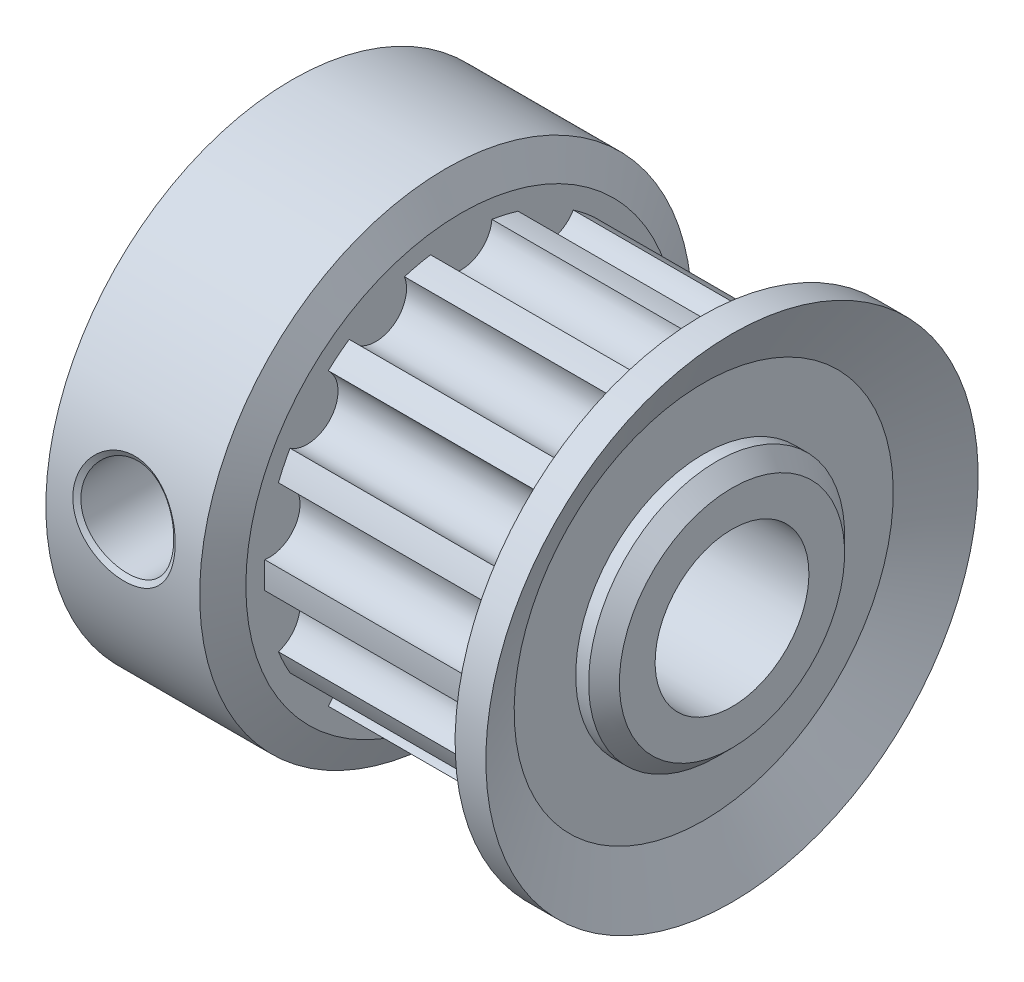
ISO-10303-21;
HEADER;
FILE_DESCRIPTION(('STEP AP214'),'2;1');
FILE_NAME('part.step','',(''),(''),'','','');
FILE_SCHEMA(('AUTOMOTIVE_DESIGN { 1 0 10303 214 1 1 1 1 }'));
ENDSEC;
DATA;
#1=APPLICATION_CONTEXT('core data for automotive mechanical design processes');
#2=APPLICATION_PROTOCOL_DEFINITION('international standard','automotive_design',2000,#1);
#3=PRODUCT_CONTEXT('',#1,'mechanical');
#4=PRODUCT('Part','Part','',(#3));
#5=PRODUCT_RELATED_PRODUCT_CATEGORY('part','',(#4));
#6=PRODUCT_DEFINITION_FORMATION('','',#4);
#7=PRODUCT_DEFINITION_CONTEXT('part definition',#1,'design');
#8=PRODUCT_DEFINITION('design','',#6,#7);
#9=PRODUCT_DEFINITION_SHAPE('','',#8);
#10=(LENGTH_UNIT() NAMED_UNIT(*) SI_UNIT(.MILLI.,.METRE.));
#11=(NAMED_UNIT(*) PLANE_ANGLE_UNIT() SI_UNIT($,.RADIAN.));
#12=(NAMED_UNIT(*) SI_UNIT($,.STERADIAN.) SOLID_ANGLE_UNIT());
#13=UNCERTAINTY_MEASURE_WITH_UNIT(LENGTH_MEASURE(1.E-05),#10,'distance_accuracy_value','');
#14=(GEOMETRIC_REPRESENTATION_CONTEXT(3) GLOBAL_UNCERTAINTY_ASSIGNED_CONTEXT((#13)) GLOBAL_UNIT_ASSIGNED_CONTEXT((#10,
#11,#12)) REPRESENTATION_CONTEXT('',''));
#15=CARTESIAN_POINT('',(0.,0.,0.));
#16=DIRECTION('',(0.,0.,1.));
#17=DIRECTION('',(1.,0.,0.));
#18=AXIS2_PLACEMENT_3D('',#15,#16,#17);
#19=CARTESIAN_POINT('',(0.,-0.777220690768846,0.));
#20=DIRECTION('',(-1.,0.,0.));
#21=DIRECTION('',(0.,-1.,0.));
#22=AXIS2_PLACEMENT_3D('',#19,#20,#21);
#23=CYLINDRICAL_SURFACE('',#22,8.);
#24=CARTESIAN_POINT('',(1.34448354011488,0.,7.9621559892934));
#25=CARTESIAN_POINT('',(1.34456983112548,-0.013851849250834,7.96350811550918));
#26=CARTESIAN_POINT('',(1.34482494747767,-0.0276734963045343,7.96482084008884));
#27=CARTESIAN_POINT('',(1.34566997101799,-0.0552696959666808,7.96736962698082));
#28=CARTESIAN_POINT('',(1.34625980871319,-0.0690421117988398,7.96860549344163));
#29=CARTESIAN_POINT('',(1.34852730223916,-0.110282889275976,7.97219892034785));
#30=CARTESIAN_POINT('',(1.35070271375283,-0.137674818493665,7.97444231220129));
#31=CARTESIAN_POINT('',(1.35919919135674,-0.219547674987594,7.98072663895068));
#32=CARTESIAN_POINT('',(1.36748632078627,-0.27372637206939,7.98432176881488));
#33=CARTESIAN_POINT('',(1.38385429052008,-0.354386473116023,7.98886327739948));
#34=CARTESIAN_POINT('',(1.38996754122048,-0.381171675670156,7.99023520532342));
#35=CARTESIAN_POINT('',(1.4001345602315,-0.421195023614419,7.99208509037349));
#36=CARTESIAN_POINT('',(1.40368981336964,-0.434510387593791,7.9926670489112));
#37=CARTESIAN_POINT('',(1.41113560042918,-0.461089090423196,7.9937624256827));
#38=CARTESIAN_POINT('',(1.41502613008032,-0.474352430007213,7.99427584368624));
#39=CARTESIAN_POINT('',(1.42314588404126,-0.500826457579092,7.99523493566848));
#40=CARTESIAN_POINT('',(1.42737369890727,-0.514032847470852,7.99568047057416));
#41=CARTESIAN_POINT('',(1.43617775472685,-0.54040942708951,7.99650514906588));
#42=CARTESIAN_POINT('',(1.44074233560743,-0.553543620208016,7.99688310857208));
#43=CARTESIAN_POINT('',(1.45487568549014,-0.592652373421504,7.99791304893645));
#44=CARTESIAN_POINT('',(1.46490219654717,-0.618397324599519,7.99846367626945));
#45=CARTESIAN_POINT('',(1.48613825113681,-0.669225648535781,7.99931141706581));
#46=CARTESIAN_POINT('',(1.49734839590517,-0.694312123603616,7.99960870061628));
#47=CARTESIAN_POINT('',(1.52093990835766,-0.743836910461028,7.99996867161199));
#48=CARTESIAN_POINT('',(1.53332129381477,-0.768275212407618,8.00003134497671));
#49=CARTESIAN_POINT('',(1.55925095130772,-0.816506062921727,7.99993988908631));
#50=CARTESIAN_POINT('',(1.57279922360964,-0.840298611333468,7.99978574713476));
#51=CARTESIAN_POINT('',(1.6010667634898,-0.887235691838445,7.99927793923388));
#52=CARTESIAN_POINT('',(1.61578601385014,-0.910380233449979,7.99892426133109));
#53=CARTESIAN_POINT('',(1.64640821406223,-0.956014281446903,7.99803436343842));
#54=CARTESIAN_POINT('',(1.66231387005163,-0.978506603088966,7.99749798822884));
#55=CARTESIAN_POINT('',(1.68706822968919,-1.01173639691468,7.996569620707));
#56=CARTESIAN_POINT('',(1.69547824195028,-1.02273880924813,7.99623910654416));
#57=CARTESIAN_POINT('',(1.71257658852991,-1.04454134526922,7.99553991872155));
#58=CARTESIAN_POINT('',(1.72123596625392,-1.05530482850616,7.99517245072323));
#59=CARTESIAN_POINT('',(1.73878873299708,-1.07657995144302,7.99440412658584));
#60=CARTESIAN_POINT('',(1.74767941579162,-1.08708815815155,7.99400338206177));
#61=CARTESIAN_POINT('',(1.76568720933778,-1.10784846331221,7.99317166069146));
#62=CARTESIAN_POINT('',(1.77480432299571,-1.11810055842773,7.9927406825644));
#63=CARTESIAN_POINT('',(1.80249271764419,-1.14847582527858,7.99140666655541));
#64=CARTESIAN_POINT('',(1.82140089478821,-1.16821815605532,7.99046255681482));
#65=CARTESIAN_POINT('',(1.87945998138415,-1.22593824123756,7.98749883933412));
#66=CARTESIAN_POINT('',(1.91994250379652,-1.26241240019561,7.98534794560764));
#67=CARTESIAN_POINT('',(1.9833387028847,-1.31411293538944,7.98198252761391));
#68=CARTESIAN_POINT('',(2.00491689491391,-1.33084384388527,7.98083741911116));
#69=CARTESIAN_POINT('',(2.03796195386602,-1.35517747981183,7.97909970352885));
#70=CARTESIAN_POINT('',(2.04908997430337,-1.36316152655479,7.97851711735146));
#71=CARTESIAN_POINT('',(2.07157408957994,-1.37887309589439,7.9773477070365));
#72=CARTESIAN_POINT('',(2.08293258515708,-1.38660208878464,7.97676076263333));
#73=CARTESIAN_POINT('',(2.10587055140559,-1.40179499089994,7.9755855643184));
#74=CARTESIAN_POINT('',(2.11747504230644,-1.40927417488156,7.9749960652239));
#75=CARTESIAN_POINT('',(2.14078794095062,-1.42388987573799,7.97382421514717));
#76=CARTESIAN_POINT('',(2.15251678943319,-1.4310405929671,7.9732407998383));
#77=CARTESIAN_POINT('',(2.18788011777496,-1.45200044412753,7.97150353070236));
#78=CARTESIAN_POINT('',(2.21173207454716,-1.46534497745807,7.9703605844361));
#79=CARTESIAN_POINT('',(2.25994547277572,-1.4907731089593,7.96812436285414));
#80=CARTESIAN_POINT('',(2.28431286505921,-1.50286062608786,7.96703076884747));
#81=CARTESIAN_POINT('',(2.33356527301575,-1.5257931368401,7.96490878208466));
#82=CARTESIAN_POINT('',(2.35845029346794,-1.53663811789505,7.96388037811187));
#83=CARTESIAN_POINT('',(2.40873798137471,-1.55708690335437,7.9619039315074));
#84=CARTESIAN_POINT('',(2.43414064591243,-1.56669071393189,7.9609558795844));
#85=CARTESIAN_POINT('',(2.48546739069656,-1.58464939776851,7.95915449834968));
#86=CARTESIAN_POINT('',(2.5113914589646,-1.59300429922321,7.95830116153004));
#87=CARTESIAN_POINT('',(2.55067435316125,-1.60458707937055,7.95710248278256));
#88=CARTESIAN_POINT('',(2.56383481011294,-1.6082896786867,7.95671647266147));
#89=CARTESIAN_POINT('',(2.59028938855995,-1.61537512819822,7.95597321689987));
#90=CARTESIAN_POINT('',(2.60358017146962,-1.61875716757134,7.95561605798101));
#91=CARTESIAN_POINT('',(2.63031035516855,-1.62520103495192,7.95493179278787));
#92=CARTESIAN_POINT('',(2.64370754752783,-1.62825229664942,7.95460580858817));
#93=CARTESIAN_POINT('',(2.67050251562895,-1.63400227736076,7.95398853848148));
#94=CARTESIAN_POINT('',(2.68391279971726,-1.63670402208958,7.95369693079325));
#95=CARTESIAN_POINT('',(2.72417116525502,-1.64429218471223,7.95287450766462));
#96=CARTESIAN_POINT('',(2.7510537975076,-1.64866351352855,7.95239594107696));
#97=CARTESIAN_POINT('',(2.80490180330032,-1.65605006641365,7.95158303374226));
#98=CARTESIAN_POINT('',(2.83186776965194,-1.65906536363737,7.9512486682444));
#99=CARTESIAN_POINT('',(2.91289070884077,-1.66609180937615,7.95046732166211));
#100=CARTESIAN_POINT('',(2.96707423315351,-1.66808785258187,7.95024254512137));
#101=CARTESIAN_POINT('',(3.048595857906,-1.66701865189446,7.95036222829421));
#102=CARTESIAN_POINT('',(3.07581531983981,-1.66598347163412,7.9504782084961));
#103=CARTESIAN_POINT('',(3.11670178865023,-1.66339834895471,7.95076662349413));
#104=CARTESIAN_POINT('',(3.13034521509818,-1.66236394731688,7.95088189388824));
#105=CARTESIAN_POINT('',(3.15764322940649,-1.65994826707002,7.95115045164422));
#106=CARTESIAN_POINT('',(3.17132085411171,-1.65856432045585,7.95130403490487));
#107=CARTESIAN_POINT('',(3.19862143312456,-1.65545297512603,7.95164828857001));
#108=CARTESIAN_POINT('',(3.21221626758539,-1.65372944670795,7.95183853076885));
#109=CARTESIAN_POINT('',(3.23931987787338,-1.64994762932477,7.95225447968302));
#110=CARTESIAN_POINT('',(3.25282469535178,-1.64788982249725,7.95248013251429));
#111=CARTESIAN_POINT('',(3.29319957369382,-1.64122052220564,7.95320842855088));
#112=CARTESIAN_POINT('',(3.31993012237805,-1.63611337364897,7.95376243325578));
#113=CARTESIAN_POINT('',(3.3995716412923,-1.61883628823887,7.95561546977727));
#114=CARTESIAN_POINT('',(3.45193361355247,-1.60471481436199,7.9571060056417));
#115=CARTESIAN_POINT('',(3.55520270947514,-1.57129181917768,7.96051084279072));
#116=CARTESIAN_POINT('',(3.60611336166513,-1.55198566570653,7.96242570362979));
#117=CARTESIAN_POINT('',(3.66881342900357,-1.52454829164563,7.96501929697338));
#118=CARTESIAN_POINT('',(3.68131009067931,-1.51889131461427,7.96554824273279));
#119=CARTESIAN_POINT('',(3.70620153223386,-1.5072469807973,7.96662386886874));
#120=CARTESIAN_POINT('',(3.71861675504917,-1.5012480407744,7.96717154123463));
#121=CARTESIAN_POINT('',(3.74320646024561,-1.48898381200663,7.96827654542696));
#122=CARTESIAN_POINT('',(3.75540727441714,-1.48270660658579,7.96883499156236));
#123=CARTESIAN_POINT('',(3.77960799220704,-1.46987180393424,7.96996084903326));
#124=CARTESIAN_POINT('',(3.79161039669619,-1.46331307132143,7.97052836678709));
#125=CARTESIAN_POINT('',(3.82732645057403,-1.44321654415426,7.97224123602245));
#126=CARTESIAN_POINT('',(3.85074909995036,-1.42925865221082,7.97339691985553));
#127=CARTESIAN_POINT('',(3.89682815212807,-1.40023538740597,7.97571718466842));
#128=CARTESIAN_POINT('',(3.91948453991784,-1.38516999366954,7.97688177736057));
#129=CARTESIAN_POINT('',(3.96403515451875,-1.35393627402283,7.97920073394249));
#130=CARTESIAN_POINT('',(3.98592937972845,-1.33776794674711,7.98035511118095));
#131=CARTESIAN_POINT('',(4.02895417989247,-1.30432479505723,7.98263378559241));
#132=CARTESIAN_POINT('',(4.05008476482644,-1.28704998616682,7.98375809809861));
#133=CARTESIAN_POINT('',(4.09157514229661,-1.25138206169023,7.98595581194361));
#134=CARTESIAN_POINT('',(4.11193957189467,-1.23298384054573,7.98702945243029));
#135=CARTESIAN_POINT('',(4.1418844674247,-1.20454783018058,7.98858448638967));
#136=CARTESIAN_POINT('',(4.15177130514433,-1.19492298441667,7.98909384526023));
#137=CARTESIAN_POINT('',(4.17134759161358,-1.1753846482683,7.99009143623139));
#138=CARTESIAN_POINT('',(4.18100078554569,-1.16550720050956,7.99057780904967));
#139=CARTESIAN_POINT('',(4.2095273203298,-1.13558397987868,7.99199435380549));
#140=CARTESIAN_POINT('',(4.22799836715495,-1.11522046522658,7.99288357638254));
#141=CARTESIAN_POINT('',(4.26384239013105,-1.07369836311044,7.99453142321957));
#142=CARTESIAN_POINT('',(4.28121931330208,-1.05253629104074,7.9952902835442));
#143=CARTESIAN_POINT('',(4.33173144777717,-0.987858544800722,7.99734284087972));
#144=CARTESIAN_POINT('',(4.36325158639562,-0.943153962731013,7.99841299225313));
#145=CARTESIAN_POINT('',(4.40729352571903,-0.873710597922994,7.99945156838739));
#146=CARTESIAN_POINT('',(4.42143358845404,-0.850164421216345,7.99970329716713));
#147=CARTESIAN_POINT('',(4.44182281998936,-0.814239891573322,7.99992331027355));
#148=CARTESIAN_POINT('',(4.44848237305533,-0.802164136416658,7.99997038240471));
#149=CARTESIAN_POINT('',(4.46152532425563,-0.777808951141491,8.00000924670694));
#150=CARTESIAN_POINT('',(4.46790971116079,-0.765527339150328,8.00000101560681));
#151=CARTESIAN_POINT('',(4.48039541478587,-0.740766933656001,7.9999265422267));
#152=CARTESIAN_POINT('',(4.48650788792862,-0.728263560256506,7.99986003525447));
#153=CARTESIAN_POINT('',(4.49838141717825,-0.703195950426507,7.99966731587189));
#154=CARTESIAN_POINT('',(4.50415624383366,-0.690605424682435,7.99954110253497));
#155=CARTESIAN_POINT('',(4.52097697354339,-0.652710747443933,7.99907086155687));
#156=CARTESIAN_POINT('',(4.53154199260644,-0.627239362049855,7.99863515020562));
#157=CARTESIAN_POINT('',(4.55137739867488,-0.575923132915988,7.99750823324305));
#158=CARTESIAN_POINT('',(4.56065080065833,-0.550072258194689,7.99681701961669));
#159=CARTESIAN_POINT('',(4.5779206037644,-0.497988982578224,7.99516782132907));
#160=CARTESIAN_POINT('',(4.58591699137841,-0.471756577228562,7.99420984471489));
#161=CARTESIAN_POINT('',(4.60063509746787,-0.41891139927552,7.99201562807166));
#162=CARTESIAN_POINT('',(4.60735682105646,-0.392298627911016,7.9907793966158));
#163=CARTESIAN_POINT('',(4.61951880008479,-0.338691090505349,7.9880167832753));
#164=CARTESIAN_POINT('',(4.62495908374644,-0.311696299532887,7.98649040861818));
#165=CARTESIAN_POINT('',(4.63454197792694,-0.257320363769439,7.98313507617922));
#166=CARTESIAN_POINT('',(4.63868499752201,-0.229936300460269,7.98130591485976));
#167=CARTESIAN_POINT('',(4.64564576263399,-0.17478565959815,7.97733266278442));
#168=CARTESIAN_POINT('',(4.64843672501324,-0.147233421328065,7.97520404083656));
#169=CARTESIAN_POINT('',(4.65266790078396,-0.0921590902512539,7.97066208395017));
#170=CARTESIAN_POINT('',(4.65410774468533,-0.0646396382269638,7.96824893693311));
#171=CARTESIAN_POINT('',(4.65565168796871,-0.00963604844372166,7.9631386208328));
#172=CARTESIAN_POINT('',(4.65575576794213,0.017848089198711,7.96044145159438));
#173=CARTESIAN_POINT('',(4.65463404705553,0.0727811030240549,7.9547633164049));
#174=CARTESIAN_POINT('',(4.65340824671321,0.100229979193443,7.9517823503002));
#175=CARTESIAN_POINT('',(4.64962299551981,0.155092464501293,7.94553676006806));
#176=CARTESIAN_POINT('',(4.6470628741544,0.182508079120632,7.94227179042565));
#177=CARTESIAN_POINT('',(4.64221433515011,0.223598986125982,7.93716266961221));
#178=CARTESIAN_POINT('',(4.6404271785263,0.237305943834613,7.93542221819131));
#179=CARTESIAN_POINT('',(4.63652355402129,0.264642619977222,7.93187939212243));
#180=CARTESIAN_POINT('',(4.63441114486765,0.278246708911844,7.93008042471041));
#181=CARTESIAN_POINT('',(4.62986620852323,0.305349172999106,7.92642602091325));
#182=CARTESIAN_POINT('',(4.62743421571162,0.318844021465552,7.92457104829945));
#183=CARTESIAN_POINT('',(4.622254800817,0.345722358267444,7.920806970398));
#184=CARTESIAN_POINT('',(4.61950737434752,0.359105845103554,7.91889786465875));
#185=CARTESIAN_POINT('',(4.61079643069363,0.39909106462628,7.91309144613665));
#186=CARTESIAN_POINT('',(4.60436450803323,0.425527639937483,7.90911502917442));
#187=CARTESIAN_POINT('',(4.59026797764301,0.477967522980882,7.90096238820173));
#188=CARTESIAN_POINT('',(4.58260334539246,0.50397082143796,7.89678615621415));
#189=CARTESIAN_POINT('',(4.56604860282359,0.555548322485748,7.88824505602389));
#190=CARTESIAN_POINT('',(4.55715848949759,0.581122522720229,7.88388017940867));
#191=CARTESIAN_POINT('',(4.53815095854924,0.631843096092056,7.87497315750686));
#192=CARTESIAN_POINT('',(4.5280335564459,0.656989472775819,7.87043100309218));
#193=CARTESIAN_POINT('',(4.50656047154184,0.706852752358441,7.86118114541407));
#194=CARTESIAN_POINT('',(4.4952025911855,0.731573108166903,7.85647267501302));
#195=CARTESIAN_POINT('',(4.47722832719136,0.768317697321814,7.84929726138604));
#196=CARTESIAN_POINT('',(4.47107455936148,0.780520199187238,7.84688450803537));
#197=CARTESIAN_POINT('',(4.45846314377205,0.80478868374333,7.84202776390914));
#198=CARTESIAN_POINT('',(4.45202622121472,0.816815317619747,7.83959169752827));
#199=CARTESIAN_POINT('',(4.43232523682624,0.852575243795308,7.83226378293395));
#200=CARTESIAN_POINT('',(4.41865880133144,0.876017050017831,7.82734691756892));
#201=CARTESIAN_POINT('',(4.39029764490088,0.922080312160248,7.81747599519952));
#202=CARTESIAN_POINT('',(4.3755996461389,0.944708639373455,7.81252059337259));
#203=CARTESIAN_POINT('',(4.32996725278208,1.01140069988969,7.79762203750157));
#204=CARTESIAN_POINT('',(4.29749801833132,1.05427413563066,7.78764602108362));
#205=CARTESIAN_POINT('',(4.24570623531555,1.11621598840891,7.77273109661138));
#206=CARTESIAN_POINT('',(4.2279267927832,1.1364679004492,7.76776766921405));
#207=CARTESIAN_POINT('',(4.19132195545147,1.17617418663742,7.75787774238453));
#208=CARTESIAN_POINT('',(4.17249556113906,1.19562904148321,7.75295105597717));
#209=CARTESIAN_POINT('',(4.14345740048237,1.22420225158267,7.74560541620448));
#210=CARTESIAN_POINT('',(4.13363211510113,1.23363608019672,7.74316134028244));
#211=CARTESIAN_POINT('',(4.11377554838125,1.25223864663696,7.73830647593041));
#212=CARTESIAN_POINT('',(4.10375545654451,1.26139762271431,7.73589829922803));
#213=CARTESIAN_POINT('',(4.08352187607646,1.27944389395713,7.73112009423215));
#214=CARTESIAN_POINT('',(4.07331025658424,1.28832950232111,7.72875051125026));
#215=CARTESIAN_POINT('',(4.05269842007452,1.30582792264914,7.72405272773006));
#216=CARTESIAN_POINT('',(4.04229820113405,1.31444073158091,7.72172452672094));
#217=CARTESIAN_POINT('',(4.01081569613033,1.33987254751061,7.71480556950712));
#218=CARTESIAN_POINT('',(3.98945172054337,1.35628517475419,7.71028043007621));
#219=CARTESIAN_POINT('',(3.94597379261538,1.38803406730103,7.70142476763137));
#220=CARTESIAN_POINT('',(3.92385983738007,1.4033703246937,7.69709423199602));
#221=CARTESIAN_POINT('',(3.8788776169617,1.43296570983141,7.68864831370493));
#222=CARTESIAN_POINT('',(3.85600936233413,1.44722484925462,7.68453291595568));
#223=CARTESIAN_POINT('',(3.80950853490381,1.47465700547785,7.676538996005));
#224=CARTESIAN_POINT('',(3.78587582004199,1.4878301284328,7.67266043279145));
#225=CARTESIAN_POINT('',(3.73783074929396,1.51307235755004,7.66516347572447));
#226=CARTESIAN_POINT('',(3.71341150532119,1.52514470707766,7.66154410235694));
#227=CARTESIAN_POINT('',(3.66379672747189,1.54814659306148,7.65459412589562));
#228=CARTESIAN_POINT('',(3.63880542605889,1.55898212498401,7.65129204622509));
#229=CARTESIAN_POINT('',(3.58842696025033,1.57936031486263,7.64504019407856));
#230=CARTESIAN_POINT('',(3.56304532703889,1.58890037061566,7.64209120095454));
#231=CARTESIAN_POINT('',(3.51189963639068,1.60669482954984,7.63655901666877));
#232=CARTESIAN_POINT('',(3.48613557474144,1.61494921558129,7.63397581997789));
#233=CARTESIAN_POINT('',(3.43422468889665,1.63017507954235,7.62918798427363));
#234=CARTESIAN_POINT('',(3.40807786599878,1.63714655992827,7.62698333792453));
#235=CARTESIAN_POINT('',(3.35539844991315,1.64979987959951,7.62296630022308));
#236=CARTESIAN_POINT('',(3.32886586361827,1.6554817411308,7.62115389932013));
#237=CARTESIAN_POINT('',(3.27540917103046,1.6655393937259,7.61793614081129));
#238=CARTESIAN_POINT('',(3.24847909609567,1.66991546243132,7.61653069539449));
#239=CARTESIAN_POINT('',(3.20780178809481,1.67547927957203,7.61474009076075));
#240=CARTESIAN_POINT('',(3.19418525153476,1.67716760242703,7.61419599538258));
#241=CARTESIAN_POINT('',(3.16686250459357,1.68020562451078,7.61321603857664));
#242=CARTESIAN_POINT('',(3.15321106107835,1.68154929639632,7.61278212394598));
#243=CARTESIAN_POINT('',(3.11230564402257,1.68505653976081,7.61164876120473));
#244=CARTESIAN_POINT('',(3.08506427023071,1.68670317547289,7.61111556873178));
#245=CARTESIAN_POINT('',(3.03067928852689,1.68863135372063,7.61049109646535));
#246=CARTESIAN_POINT('',(3.00352877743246,1.68891399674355,7.61039944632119));
#247=CARTESIAN_POINT('',(2.92220182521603,1.68773987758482,7.61077987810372));
#248=CARTESIAN_POINT('',(2.86814971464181,1.68426545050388,7.61190700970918));
#249=CARTESIAN_POINT('',(2.78732008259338,1.67501506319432,7.61489002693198));
#250=CARTESIAN_POINT('',(2.76041835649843,1.67125739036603,7.61609984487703));
#251=CARTESIAN_POINT('',(2.72012861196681,1.66459806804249,7.61823644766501));
#252=CARTESIAN_POINT('',(2.70670917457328,1.66220776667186,7.61900229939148));
#253=CARTESIAN_POINT('',(2.67989141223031,1.65708323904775,7.62064115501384));
#254=CARTESIAN_POINT('',(2.66649120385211,1.65434849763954,7.62151432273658));
#255=CARTESIAN_POINT('',(2.63971962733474,1.64853364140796,7.62336705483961));
#256=CARTESIAN_POINT('',(2.62632443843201,1.64544714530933,7.62434863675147));
#257=CARTESIAN_POINT('',(2.59972629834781,1.63896551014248,7.62640516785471));
#258=CARTESIAN_POINT('',(2.58648982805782,1.63556351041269,7.62748230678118));
#259=CARTESIAN_POINT('',(2.54701970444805,1.62489172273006,7.63085261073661));
#260=CARTESIAN_POINT('',(2.52097525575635,1.61714580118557,7.633288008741));
#261=CARTESIAN_POINT('',(2.46944975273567,1.60042512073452,7.63851275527));
#262=CARTESIAN_POINT('',(2.44396229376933,1.59144893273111,7.64130256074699));
#263=CARTESIAN_POINT('',(2.39352911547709,1.5722806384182,7.64721806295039));
#264=CARTESIAN_POINT('',(2.36858340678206,1.56208851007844,7.65034377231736));
#265=CARTESIAN_POINT('',(2.31922887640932,1.54049478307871,7.6569133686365));
#266=CARTESIAN_POINT('',(2.29482005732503,1.52909318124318,7.660357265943));
#267=CARTESIAN_POINT('',(2.24653829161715,1.50507793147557,7.66754654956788));
#268=CARTESIAN_POINT('',(2.2226653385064,1.49246430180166,7.67129194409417));
#269=CARTESIAN_POINT('',(2.18725995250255,1.47262603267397,7.67712428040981));
#270=CARTESIAN_POINT('',(2.17552552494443,1.46586024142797,7.67910410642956));
#271=CARTESIAN_POINT('',(2.15219214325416,1.45202021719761,7.68313327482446));
#272=CARTESIAN_POINT('',(2.14059093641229,1.44494445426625,7.6851830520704));
#273=CARTESIAN_POINT('',(2.11753398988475,1.43048765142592,7.68934851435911));
#274=CARTESIAN_POINT('',(2.10605443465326,1.42309040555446,7.69146879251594));
#275=CARTESIAN_POINT('',(2.0833617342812,1.40806722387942,7.6957506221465));
#276=CARTESIAN_POINT('',(2.07212756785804,1.40042955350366,7.69791563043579));
#277=CARTESIAN_POINT('',(2.01655563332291,1.36163348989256,7.70884816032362));
#278=CARTESIAN_POINT('',(1.97392351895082,1.32863695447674,7.71794465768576));
#279=CARTESIAN_POINT('',(1.89221237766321,1.25883058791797,7.73665305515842));
#280=CARTESIAN_POINT('',(1.8531275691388,1.22201987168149,7.74626575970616));
#281=CARTESIAN_POINT('',(1.79713831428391,1.16393067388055,7.7609490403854));
#282=CARTESIAN_POINT('',(1.77891563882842,1.14408795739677,7.76588765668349));
#283=CARTESIAN_POINT('',(1.74335831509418,1.10343011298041,7.77583375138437));
#284=CARTESIAN_POINT('',(1.72602548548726,1.08261677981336,7.78084077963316));
#285=CARTESIAN_POINT('',(1.7006971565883,1.05064685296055,7.78839011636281));
#286=CARTESIAN_POINT('',(1.69235851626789,1.03985351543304,7.79091560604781));
#287=CARTESIAN_POINT('',(1.67598405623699,1.01811606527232,7.79595345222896));
#288=CARTESIAN_POINT('',(1.66793999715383,1.0071624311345,7.79846813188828));
#289=CARTESIAN_POINT('',(1.64425657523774,0.974077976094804,7.8059889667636));
#290=CARTESIAN_POINT('',(1.62903673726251,0.95168783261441,7.81098043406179));
#291=CARTESIAN_POINT('',(1.59974413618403,0.906280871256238,7.82089269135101));
#292=CARTESIAN_POINT('',(1.58566683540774,0.883258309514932,7.82581485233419));
#293=CARTESIAN_POINT('',(1.55864063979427,0.836576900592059,7.83557438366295));
#294=CARTESIAN_POINT('',(1.54569175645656,0.812918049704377,7.840411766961));
#295=CARTESIAN_POINT('',(1.52092141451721,0.764961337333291,7.8499855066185));
#296=CARTESIAN_POINT('',(1.5090999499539,0.740663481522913,7.85472187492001));
#297=CARTESIAN_POINT('',(1.48659196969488,0.69142144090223,7.86407771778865));
#298=CARTESIAN_POINT('',(1.47590542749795,0.666477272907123,7.86869720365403));
#299=CARTESIAN_POINT('',(1.46073905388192,0.628567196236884,7.87552698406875));
#300=CARTESIAN_POINT('',(1.45582756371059,0.615848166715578,7.87778700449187));
#301=CARTESIAN_POINT('',(1.44629544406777,0.590243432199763,7.88227193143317));
#302=CARTESIAN_POINT('',(1.44167593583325,0.57736087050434,7.8844962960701));
#303=CARTESIAN_POINT('',(1.43272679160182,0.551414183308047,7.88891010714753));
#304=CARTESIAN_POINT('',(1.42840467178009,0.538369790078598,7.89109606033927));
#305=CARTESIAN_POINT('',(1.42010161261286,0.512253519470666,7.89540570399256));
#306=CARTESIAN_POINT('',(1.41611254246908,0.49915822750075,7.89753338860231));
#307=CARTESIAN_POINT('',(1.40463868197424,0.45979067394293,7.9038287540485));
#308=CARTESIAN_POINT('',(1.39763971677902,0.433415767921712,7.90791231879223));
#309=CARTESIAN_POINT('',(1.38493202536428,0.380419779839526,7.91584401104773));
#310=CARTESIAN_POINT('',(1.37922266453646,0.353796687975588,7.91969248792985));
#311=CARTESIAN_POINT('',(1.36402053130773,0.273552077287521,7.93087598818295));
#312=CARTESIAN_POINT('',(1.35644926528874,0.219552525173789,7.93784948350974));
#313=CARTESIAN_POINT('',(1.34899342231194,0.137799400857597,7.94754627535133));
#314=CARTESIAN_POINT('',(1.34715937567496,0.110414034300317,7.95065214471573));
#315=CARTESIAN_POINT('',(1.34540327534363,0.0691535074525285,7.95511422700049));
#316=CARTESIAN_POINT('',(1.34498385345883,0.055361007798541,7.95656963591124));
#317=CARTESIAN_POINT('',(1.34448068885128,0.0277260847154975,7.95941291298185));
#318=CARTESIAN_POINT('',(1.34439724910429,0.0138518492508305,7.96080386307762));
#319=CARTESIAN_POINT('',(1.34448354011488,0.,7.9621559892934));
#320=B_SPLINE_CURVE_WITH_KNOTS('',3,(#24,#25,#26,#27,#28,#29,#30,#31,#32,#33,#34,#35,#36,#37,
#38,#39,#40,#41,#42,#43,#44,#45,#46,#47,#48,#49,#50,#51,#52,#53,#54,#55,#56,#57,#58,#59,#60,#61,
#62,#63,#64,#65,#66,#67,#68,#69,#70,#71,#72,#73,#74,#75,#76,#77,#78,#79,#80,#81,#82,#83,#84,#85,
#86,#87,#88,#89,#90,#91,#92,#93,#94,#95,#96,#97,#98,#99,#100,#101,#102,#103,#104,#105,#106,#107,
#108,#109,#110,#111,#112,#113,#114,#115,#116,#117,#118,#119,#120,#121,#122,#123,#124,#125,#126,
#127,#128,#129,#130,#131,#132,#133,#134,#135,#136,#137,#138,#139,#140,#141,#142,#143,#144,#145,
#146,#147,#148,#149,#150,#151,#152,#153,#154,#155,#156,#157,#158,#159,#160,#161,#162,#163,#164,
#165,#166,#167,#168,#169,#170,#171,#172,#173,#174,#175,#176,#177,#178,#179,#180,#181,#182,#183,
#184,#185,#186,#187,#188,#189,#190,#191,#192,#193,#194,#195,#196,#197,#198,#199,#200,#201,#202,
#203,#204,#205,#206,#207,#208,#209,#210,#211,#212,#213,#214,#215,#216,#217,#218,#219,#220,#221,
#222,#223,#224,#225,#226,#227,#228,#229,#230,#231,#232,#233,#234,#235,#236,#237,#238,#239,#240,
#241,#242,#243,#244,#245,#246,#247,#248,#249,#250,#251,#252,#253,#254,#255,#256,#257,#258,#259,
#260,#261,#262,#263,#264,#265,#266,#267,#268,#269,#270,#271,#272,#273,#274,#275,#276,#277,#278,
#279,#280,#281,#282,#283,#284,#285,#286,#287,#288,#289,#290,#291,#292,#293,#294,#295,#296,#297,
#298,#299,#300,#301,#302,#303,#304,#305,#306,#307,#308,#309,#310,#311,#312,#313,#314,#315,#316,
#317,#318,#319),.UNSPECIFIED.,.T.,.F.,(4,2,2,2,2,2,2,2,2,2,2,2,2,2,2,2,2,2,2,2,2,2,2,2,2,2,2,2,
2,2,2,2,2,2,2,2,2,2,2,2,2,2,2,2,2,2,2,2,2,2,2,2,2,2,2,2,2,2,2,2,2,2,2,2,2,2,2,2,2,2,2,2,2,2,2,2,
2,2,2,2,2,2,2,2,2,2,2,2,2,2,2,2,2,2,2,2,2,2,2,2,2,2,2,2,2,2,2,2,2,2,2,2,2,2,2,2,2,2,2,2,2,2,2,2,
2,2,2,2,2,2,2,2,2,2,2,2,2,2,2,2,2,2,2,2,2,2,2,4),(-1.31100387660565E-05,2.75601816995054E-05,
6.82304021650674E-05,0.000149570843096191,0.000312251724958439,0.000393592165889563,
0.000434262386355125,0.000474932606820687,0.000515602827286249,0.000556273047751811,
0.000637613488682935,0.000718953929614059,0.000800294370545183,0.000881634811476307,
0.000962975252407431,0.00104431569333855,0.00108498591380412,0.00112565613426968,
0.00116632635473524,0.0012069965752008,0.00128833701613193,0.00145101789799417,
0.0015323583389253,0.00157302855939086,0.00161369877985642,0.00165436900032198,
0.00169503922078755,0.00177637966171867,0.00185772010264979,0.00193906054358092,
0.00202040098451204,0.00210174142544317,0.00214241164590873,0.00218308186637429,
0.00222375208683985,0.00226442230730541,0.00234576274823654,0.00242710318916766,
0.00258978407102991,0.00267112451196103,0.0027117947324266,0.00275246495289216,
0.00279313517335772,0.00283380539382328,0.00291514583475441,0.00307782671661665,
0.0032405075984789,0.00328117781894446,0.00332184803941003,0.00336251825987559,
0.00340318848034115,0.00348452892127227,0.0035658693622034,0.00364720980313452,
0.00372855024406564,0.00380989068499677,0.00385056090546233,0.00389123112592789,
0.00397257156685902,0.00405391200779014,0.00421659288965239,0.00429793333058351,
0.00433860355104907,0.00437927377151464,0.0044199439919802,0.00446061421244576,
0.00454195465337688,0.00462329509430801,0.00470463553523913,0.00478597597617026,
0.00486731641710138,0.0049486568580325,0.00502999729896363,0.00511133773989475,
0.00519267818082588,0.005274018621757,0.00535535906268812,0.00539602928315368,
0.00543669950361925,0.00547736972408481,0.00551803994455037,0.00559938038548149,
0.00568072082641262,0.00576206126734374,0.00584340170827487,0.00592474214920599,
0.00596541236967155,0.00600608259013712,0.00608742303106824,0.00616876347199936,
0.00633144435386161,0.00641278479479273,0.00649412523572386,0.00653479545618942,
0.00657546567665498,0.00661613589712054,0.00665680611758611,0.00673814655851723,
0.00681948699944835,0.00690082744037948,0.0069821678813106,0.00706350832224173,
0.00714484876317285,0.00722618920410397,0.0073075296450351,0.00738887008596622,
0.00747021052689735,0.00755155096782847,0.00759222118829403,0.00763289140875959,
0.00771423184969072,0.00779557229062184,0.00795825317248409,0.00803959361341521,
0.00808026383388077,0.00812093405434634,0.0081616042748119,0.00820227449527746,
0.00828361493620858,0.00836495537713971,0.00844629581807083,0.00852763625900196,
0.00860897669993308,0.00864964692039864,0.00869031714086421,0.00873098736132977,
0.00877165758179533,0.00893433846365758,0.00909701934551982,0.00917835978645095,
0.00925970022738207,0.00930037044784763,0.00934104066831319,0.00942238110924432,
0.00950372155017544,0.00958506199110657,0.00966640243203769,0.00974774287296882,
0.00978841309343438,0.00982908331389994,0.0098697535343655,0.00991042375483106,
0.00999176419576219,0.0100731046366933,0.0102357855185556,0.0103171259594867,0.0103577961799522,
0.0103984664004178),.UNSPECIFIED.);
#321=CARTESIAN_POINT('',(1.34448354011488,0.,7.9621559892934));
#322=VERTEX_POINT('',#321);
#323=EDGE_CURVE('E11',#322,#322,#320,.F.);
#324=ORIENTED_EDGE('',*,*,#323,.T.);
#325=EDGE_LOOP('',(#324));
#326=FACE_BOUND('',#325,.T.);
#327=CARTESIAN_POINT('',(0.5,-0.777220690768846,0.));
#328=DIRECTION('',(-1.,0.,0.));
#329=DIRECTION('',(0.,-1.,0.));
#330=AXIS2_PLACEMENT_3D('',#327,#328,#329);
#331=CIRCLE('',#330,8.);
#332=CARTESIAN_POINT('',(0.5,-8.77722069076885,0.));
#333=VERTEX_POINT('',#332);
#334=EDGE_CURVE('E375',#333,#333,#331,.T.);
#335=ORIENTED_EDGE('',*,*,#334,.F.);
#336=EDGE_LOOP('',(#335));
#337=FACE_BOUND('',#336,.T.);
#338=CARTESIAN_POINT('',(5.5,-0.777220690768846,0.));
#339=DIRECTION('',(-1.,0.,0.));
#340=DIRECTION('',(0.,-1.,0.));
#341=AXIS2_PLACEMENT_3D('',#338,#339,#340);
#342=CIRCLE('',#341,8.);
#343=CARTESIAN_POINT('',(5.5,-8.77722069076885,0.));
#344=VERTEX_POINT('',#343);
#345=EDGE_CURVE('E260',#344,#344,#342,.T.);
#346=ORIENTED_EDGE('',*,*,#345,.T.);
#347=EDGE_LOOP('',(#346));
#348=FACE_BOUND('',#347,.T.);
#349=ADVANCED_FACE('F40',(#326,#337,#348),#23,.T.);
#350=CARTESIAN_POINT('',(0.,-0.777220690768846,0.));
#351=DIRECTION('',(1.,0.,0.));
#352=DIRECTION('',(0.,1.,0.));
#353=AXIS2_PLACEMENT_3D('',#350,#351,#352);
#354=CYLINDRICAL_SURFACE('',#353,2.5);
#355=CARTESIAN_POINT('',(0.,-0.777220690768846,0.));
#356=DIRECTION('',(1.,0.,0.));
#357=DIRECTION('',(0.,1.,0.));
#358=AXIS2_PLACEMENT_3D('',#355,#356,#357);
#359=CIRCLE('',#358,2.5);
#360=CARTESIAN_POINT('',(0.,1.72277930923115,0.));
#361=VERTEX_POINT('',#360);
#362=EDGE_CURVE('E372',#361,#361,#359,.T.);
#363=ORIENTED_EDGE('',*,*,#362,.F.);
#364=EDGE_LOOP('',(#363));
#365=FACE_BOUND('',#364,.T.);
#366=CARTESIAN_POINT('',(14.8,-0.777220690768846,0.));
#367=DIRECTION('',(1.,0.,0.));
#368=DIRECTION('',(0.,1.,0.));
#369=AXIS2_PLACEMENT_3D('',#366,#367,#368);
#370=CIRCLE('',#369,2.5);
#371=CARTESIAN_POINT('',(14.8,1.72277930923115,0.));
#372=VERTEX_POINT('',#371);
#373=EDGE_CURVE('E371',#372,#372,#370,.T.);
#374=ORIENTED_EDGE('',*,*,#373,.T.);
#375=EDGE_LOOP('',(#374));
#376=FACE_BOUND('',#375,.T.);
#377=CARTESIAN_POINT('',(1.5,0.,2.3761161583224));
#378=CARTESIAN_POINT('',(1.50000862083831,0.0851285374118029,2.34826140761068));
#379=CARTESIAN_POINT('',(1.50729945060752,0.168902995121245,2.3157420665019));
#380=CARTESIAN_POINT('',(1.53462209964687,0.33086920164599,2.24278917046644));
#381=CARTESIAN_POINT('',(1.55470075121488,0.409039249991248,2.20232690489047));
#382=CARTESIAN_POINT('',(1.60522063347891,0.557373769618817,2.11569277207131));
#383=CARTESIAN_POINT('',(1.6355581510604,0.627609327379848,2.06958088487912));
#384=CARTESIAN_POINT('',(1.70480814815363,0.760320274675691,1.97299910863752));
#385=CARTESIAN_POINT('',(1.74372239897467,0.822794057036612,1.92252832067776));
#386=CARTESIAN_POINT('',(1.84884264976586,0.967579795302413,1.79412936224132));
#387=CARTESIAN_POINT('',(1.91926547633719,1.04535627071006,1.71447556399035));
#388=CARTESIAN_POINT('',(2.03484266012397,1.14941506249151,1.59402435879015));
#389=CARTESIAN_POINT('',(2.07505422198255,1.18201701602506,1.55368630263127));
#390=CARTESIAN_POINT('',(2.15888525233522,1.24306653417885,1.47342144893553));
#391=CARTESIAN_POINT('',(2.20250259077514,1.27151666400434,1.43349441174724));
#392=CARTESIAN_POINT('',(2.29388588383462,1.32447115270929,1.35468379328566));
#393=CARTESIAN_POINT('',(2.34168926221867,1.34893279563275,1.3158148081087));
#394=CARTESIAN_POINT('',(2.44171568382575,1.39331016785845,1.24123498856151));
#395=CARTESIAN_POINT('',(2.49393486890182,1.41322981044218,1.20552145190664));
#396=CARTESIAN_POINT('',(2.58955699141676,1.44338309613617,1.14876989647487));
#397=CARTESIAN_POINT('',(2.63173824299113,1.45478910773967,1.12632707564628));
#398=CARTESIAN_POINT('',(2.7193732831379,1.47419430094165,1.08701929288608));
#399=CARTESIAN_POINT('',(2.76481809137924,1.4822024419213,1.07013968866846));
#400=CARTESIAN_POINT('',(2.84660975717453,1.49255100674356,1.04797376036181));
#401=CARTESIAN_POINT('',(2.88232140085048,1.49581598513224,1.04082871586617));
#402=CARTESIAN_POINT('',(2.95454932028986,1.49974554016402,1.03220614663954));
#403=CARTESIAN_POINT('',(2.9910643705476,1.5004138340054,1.03072052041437));
#404=CARTESIAN_POINT('',(3.06379649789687,1.49908450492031,1.03365178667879));
#405=CARTESIAN_POINT('',(3.10001356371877,1.4970867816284,1.03806890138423));
#406=CARTESIAN_POINT('',(3.17120832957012,1.49062784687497,1.05210304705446));
#407=CARTESIAN_POINT('',(3.20618384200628,1.48616249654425,1.06172881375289));
#408=CARTESIAN_POINT('',(3.29394963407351,1.47192176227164,1.0916779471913));
#409=CARTESIAN_POINT('',(3.34544650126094,1.46056968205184,1.11497034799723));
#410=CARTESIAN_POINT('',(3.44418343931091,1.43364604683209,1.16745159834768));
#411=CARTESIAN_POINT('',(3.49140585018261,1.41805796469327,1.19666342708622));
#412=CARTESIAN_POINT('',(3.58094086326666,1.38374049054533,1.25755237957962));
#413=CARTESIAN_POINT('',(3.62335171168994,1.36510745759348,1.28914146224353));
#414=CARTESIAN_POINT('',(3.70522647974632,1.32466576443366,1.35408429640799));
#415=CARTESIAN_POINT('',(3.74468778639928,1.30285433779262,1.38743956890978));
#416=CARTESIAN_POINT('',(3.85922664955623,1.23278942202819,1.48881918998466));
#417=CARTESIAN_POINT('',(3.93041020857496,1.17992472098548,1.55812112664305));
#418=CARTESIAN_POINT('',(4.06852585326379,1.05710607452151,1.70144999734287));
#419=CARTESIAN_POINT('',(4.13460717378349,0.986094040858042,1.77538850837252));
#420=CARTESIAN_POINT('',(4.25358937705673,0.829537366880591,1.91820183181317));
#421=CARTESIAN_POINT('',(4.30652114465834,0.744027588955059,1.98708823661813));
#422=CARTESIAN_POINT('',(4.38406144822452,0.583187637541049,2.09909913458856));
#423=CARTESIAN_POINT('',(4.41245769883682,0.511090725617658,2.14423544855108));
#424=CARTESIAN_POINT('',(4.45831296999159,0.359929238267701,2.22807941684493));
#425=CARTESIAN_POINT('',(4.47577703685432,0.280867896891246,2.26679003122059));
#426=CARTESIAN_POINT('',(4.49776109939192,0.116713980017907,2.33642684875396));
#427=CARTESIAN_POINT('',(4.50216232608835,0.0315732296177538,2.3672793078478));
#428=CARTESIAN_POINT('',(4.49583920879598,-0.141057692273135,2.41937918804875));
#429=CARTESIAN_POINT('',(4.48513067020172,-0.228545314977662,2.44063661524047));
#430=CARTESIAN_POINT('',(4.45050596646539,-0.389669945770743,2.47094438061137));
#431=CARTESIAN_POINT('',(4.42866962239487,-0.463517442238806,2.48129507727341));
#432=CARTESIAN_POINT('',(4.37363186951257,-0.607513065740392,2.49528145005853));
#433=CARTESIAN_POINT('',(4.34043104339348,-0.677661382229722,2.49891747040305));
#434=CARTESIAN_POINT('',(4.26511611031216,-0.809326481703,2.50062813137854));
#435=CARTESIAN_POINT('',(4.22340958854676,-0.871075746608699,2.49891846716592));
#436=CARTESIAN_POINT('',(4.13144906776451,-0.987590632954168,2.49181766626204));
#437=CARTESIAN_POINT('',(4.0811929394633,-1.04235450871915,2.48642561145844));
#438=CARTESIAN_POINT('',(3.96917795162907,-1.1476251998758,2.47302061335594));
#439=CARTESIAN_POINT('',(3.90683378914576,-1.19748765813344,2.46483898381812));
#440=CARTESIAN_POINT('',(3.77507294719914,-1.28670028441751,2.44795770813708));
#441=CARTESIAN_POINT('',(3.70565333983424,-1.32604607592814,2.43925784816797));
#442=CARTESIAN_POINT('',(3.556765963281,-1.39540977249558,2.42264331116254));
#443=CARTESIAN_POINT('',(3.47694085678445,-1.42468571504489,2.4148123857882));
#444=CARTESIAN_POINT('',(3.31326740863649,-1.46937214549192,2.40238884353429));
#445=CARTESIAN_POINT('',(3.22942042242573,-1.48478727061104,2.39779514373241));
#446=CARTESIAN_POINT('',(3.06224710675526,-1.50100145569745,2.39295059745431));
#447=CARTESIAN_POINT('',(2.97895727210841,-1.50214515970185,2.39259735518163));
#448=CARTESIAN_POINT('',(2.81342591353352,-1.49066209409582,2.3960458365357));
#449=CARTESIAN_POINT('',(2.73118436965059,-1.47803558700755,2.39984748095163));
#450=CARTESIAN_POINT('',(2.57199610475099,-1.43991677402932,2.41064504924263));
#451=CARTESIAN_POINT('',(2.49497107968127,-1.41472731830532,2.41756542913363));
#452=CARTESIAN_POINT('',(2.34610235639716,-1.35238114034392,2.43314983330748));
#453=CARTESIAN_POINT('',(2.27426047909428,-1.31522023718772,2.44181446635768));
#454=CARTESIAN_POINT('',(2.13475351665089,-1.2281581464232,2.459410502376));
#455=CARTESIAN_POINT('',(2.06736510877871,-1.17781209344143,2.46833894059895));
#456=CARTESIAN_POINT('',(1.94178318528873,-1.06640480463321,2.48385347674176));
#457=CARTESIAN_POINT('',(1.88358880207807,-1.00534458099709,2.49043979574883));
#458=CARTESIAN_POINT('',(1.77828723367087,-0.874329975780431,2.49897133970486));
#459=CARTESIAN_POINT('',(1.73114247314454,-0.804407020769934,2.50093250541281));
#460=CARTESIAN_POINT('',(1.64927596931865,-0.657712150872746,2.49821508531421));
#461=CARTESIAN_POINT('',(1.61455026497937,-0.580942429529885,2.49353861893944));
#462=CARTESIAN_POINT('',(1.56093981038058,-0.430091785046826,2.4768487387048));
#463=CARTESIAN_POINT('',(1.54097586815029,-0.356320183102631,2.4654794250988));
#464=CARTESIAN_POINT('',(1.5126070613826,-0.208149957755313,2.43553649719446));
#465=CARTESIAN_POINT('',(1.50417524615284,-0.133753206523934,2.41697981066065));
#466=CARTESIAN_POINT('',(1.50039903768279,-0.0401318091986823,2.38896488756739));
#467=CARTESIAN_POINT('',(1.49999797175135,-0.0200284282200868,2.38266962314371));
#468=CARTESIAN_POINT('',(1.5,0.,2.3761161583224));
#469=B_SPLINE_CURVE_WITH_KNOTS('',3,(#377,#378,#379,#380,#381,#382,#383,#384,#385,#386,#387,
#388,#389,#390,#391,#392,#393,#394,#395,#396,#397,#398,#399,#400,#401,#402,#403,#404,#405,#406,
#407,#408,#409,#410,#411,#412,#413,#414,#415,#416,#417,#418,#419,#420,#421,#422,#423,#424,#425,
#426,#427,#428,#429,#430,#431,#432,#433,#434,#435,#436,#437,#438,#439,#440,#441,#442,#443,#444,
#445,#446,#447,#448,#449,#450,#451,#452,#453,#454,#455,#456,#457,#458,#459,#460,#461,#462,#463,
#464,#465,#466,#467,#468),.UNSPECIFIED.,.T.,.F.,(4,2,2,2,2,2,2,2,2,2,2,2,2,2,2,2,2,2,2,2,2,2,2,
2,2,2,2,2,2,2,2,2,2,2,2,2,2,2,2,2,2,2,2,2,2,4),(0.,0.268652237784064,0.53829405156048,
0.805287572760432,1.0723362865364,1.46530183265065,1.66203441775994,1.85864493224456,
2.0572395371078,2.25566238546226,2.40267001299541,2.5492875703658,2.65851616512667,
2.76758833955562,2.8766646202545,2.985924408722,3.15787728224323,3.33051092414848,
3.49847565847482,3.66658747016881,4.00300088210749,4.36749350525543,4.73112176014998,
4.99915893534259,5.26707229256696,5.53741420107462,5.80747353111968,6.0393771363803,
6.2712688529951,6.49392635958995,6.71663940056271,6.95635824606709,7.19617669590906,
7.45107250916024,7.70588301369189,7.95452778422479,8.20316781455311,8.44608436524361,
8.68908584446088,8.94167607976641,9.19424246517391,9.44593709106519,9.69755136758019,
9.92819120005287,10.1582910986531,10.2214976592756),.UNSPECIFIED.);
#470=CARTESIAN_POINT('',(1.5,0.,2.3761161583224));
#471=VERTEX_POINT('',#470);
#472=EDGE_CURVE('E459',#471,#471,#469,.T.);
#473=ORIENTED_EDGE('',*,*,#472,.F.);
#474=EDGE_LOOP('',(#473));
#475=FACE_BOUND('',#474,.T.);
#476=ADVANCED_FACE('F401',(#365,#376,#475),#354,.F.);
#477=CARTESIAN_POINT('',(0.,-0.777220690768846,0.));
#478=DIRECTION('',(-1.,0.,0.));
#479=DIRECTION('',(0.,-1.,0.));
#480=AXIS2_PLACEMENT_3D('',#477,#478,#479);
#481=CYLINDRICAL_SURFACE('',#480,6.4);
#482=DIRECTION('',(-1.,0.,0.));
#483=VECTOR('',#482,1.);
#484=CARTESIAN_POINT('',(9.5,-6.04047564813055,3.64117388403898));
#485=LINE('',#484,#483);
#486=CARTESIAN_POINT('',(13.,-6.04047564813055,3.64117388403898));
#487=VERTEX_POINT('',#486);
#488=CARTESIAN_POINT('',(6.,-6.04047564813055,3.64117388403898));
#489=VERTEX_POINT('',#488);
#490=EDGE_CURVE('E368',#487,#489,#485,.T.);
#491=ORIENTED_EDGE('',*,*,#490,.F.);
#492=CARTESIAN_POINT('',(13.,-0.777220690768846,0.));
#493=DIRECTION('',(-1.,0.,0.));
#494=DIRECTION('',(0.,-1.,0.));
#495=AXIS2_PLACEMENT_3D('',#492,#493,#494);
#496=CIRCLE('',#495,6.4);
#497=CARTESIAN_POINT('',(13.,-5.49828715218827,4.32105675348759));
#498=VERTEX_POINT('',#497);
#499=EDGE_CURVE('E511',#487,#498,#496,.T.);
#500=ORIENTED_EDGE('',*,*,#499,.T.);
#501=DIRECTION('',(-1.,0.,0.));
#502=VECTOR('',#501,1.);
#503=CARTESIAN_POINT('',(9.5,-5.49828715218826,4.32105675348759));
#504=LINE('',#503,#502);
#505=CARTESIAN_POINT('',(6.,-5.49828715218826,4.32105675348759));
#506=VERTEX_POINT('',#505);
#507=EDGE_CURVE('E361',#506,#498,#504,.F.);
#508=ORIENTED_EDGE('',*,*,#507,.F.);
#509=CARTESIAN_POINT('',(6.,-0.777220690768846,0.));
#510=DIRECTION('',(-1.,0.,0.));
#511=DIRECTION('',(0.,-1.,0.));
#512=AXIS2_PLACEMENT_3D('',#509,#510,#511);
#513=CIRCLE('',#512,6.4);
#514=EDGE_CURVE('E264',#489,#506,#513,.T.);
#515=ORIENTED_EDGE('',*,*,#514,.F.);
#516=EDGE_LOOP('',(#491,#500,#508,#515));
#517=FACE_BOUND('',#516,.T.);
#518=ADVANCED_FACE('F408',(#517),#481,.T.);
#519=DIRECTION('',(-1.,0.,0.));
#520=VECTOR('',#519,1.);
#521=CARTESIAN_POINT('',(9.5,-6.90559085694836,1.84474364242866));
#522=LINE('',#521,#520);
#523=CARTESIAN_POINT('',(6.,-6.90559085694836,1.84474364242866));
#524=VERTEX_POINT('',#523);
#525=CARTESIAN_POINT('',(13.,-6.90559085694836,1.84474364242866));
#526=VERTEX_POINT('',#525);
#527=EDGE_CURVE('E366',#524,#526,#522,.F.);
#528=ORIENTED_EDGE('',*,*,#527,.F.);
#529=CARTESIAN_POINT('',(6.,-7.09909569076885,0.996943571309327));
#530=VERTEX_POINT('',#529);
#531=EDGE_CURVE('E257',#530,#524,#513,.T.);
#532=ORIENTED_EDGE('',*,*,#531,.F.);
#533=DIRECTION('',(-1.,0.,0.));
#534=VECTOR('',#533,1.);
#535=CARTESIAN_POINT('',(9.5,-7.09909569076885,0.996943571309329));
#536=LINE('',#535,#534);
#537=CARTESIAN_POINT('',(13.,-7.09909569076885,0.996943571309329));
#538=VERTEX_POINT('',#537);
#539=EDGE_CURVE('E237',#538,#530,#536,.T.);
#540=ORIENTED_EDGE('',*,*,#539,.F.);
#541=EDGE_CURVE('E265',#538,#526,#496,.T.);
#542=ORIENTED_EDGE('',*,*,#541,.T.);
#543=EDGE_LOOP('',(#528,#532,#540,#542));
#544=FACE_BOUND('',#543,.T.);
#545=ADVANCED_FACE('F648',(#544),#481,.T.);
#546=DIRECTION('',(-1.,0.,0.));
#547=VECTOR('',#546,1.);
#548=CARTESIAN_POINT('',(9.5,-3.93940341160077,5.56422505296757));
#549=LINE('',#548,#547);
#550=CARTESIAN_POINT('',(13.,-3.93940341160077,5.56422505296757));
#551=VERTEX_POINT('',#550);
#552=CARTESIAN_POINT('',(6.,-3.93940341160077,5.56422505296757));
#553=VERTEX_POINT('',#552);
#554=EDGE_CURVE('E363',#551,#553,#549,.T.);
#555=ORIENTED_EDGE('',*,*,#554,.F.);
#556=CARTESIAN_POINT('',(13.,-3.1559183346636,5.94153158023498));
#557=VERTEX_POINT('',#556);
#558=EDGE_CURVE('E522',#551,#557,#496,.T.);
#559=ORIENTED_EDGE('',*,*,#558,.T.);
#560=DIRECTION('',(-1.,0.,0.));
#561=VECTOR('',#560,1.);
#562=CARTESIAN_POINT('',(9.5,-3.1559183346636,5.94153158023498));
#563=LINE('',#562,#561);
#564=CARTESIAN_POINT('',(6.,-3.1559183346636,5.94153158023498));
#565=VERTEX_POINT('',#564);
#566=EDGE_CURVE('E356',#565,#557,#563,.F.);
#567=ORIENTED_EDGE('',*,*,#566,.F.);
#568=EDGE_CURVE('E267',#553,#565,#513,.T.);
#569=ORIENTED_EDGE('',*,*,#568,.F.);
#570=EDGE_LOOP('',(#555,#559,#567,#569));
#571=FACE_BOUND('',#570,.T.);
#572=ADVANCED_FACE('F973',(#571),#481,.T.);
#573=DIRECTION('',(-1.,0.,0.));
#574=VECTOR('',#573,1.);
#575=CARTESIAN_POINT('',(9.5,-1.21202210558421,6.38521320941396));
#576=LINE('',#575,#574);
#577=CARTESIAN_POINT('',(13.,-1.21202210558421,6.38521320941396));
#578=VERTEX_POINT('',#577);
#579=CARTESIAN_POINT('',(6.,-1.21202210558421,6.38521320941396));
#580=VERTEX_POINT('',#579);
#581=EDGE_CURVE('E358',#578,#580,#576,.T.);
#582=ORIENTED_EDGE('',*,*,#581,.F.);
#583=CARTESIAN_POINT('',(13.,-0.34241927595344,6.38521320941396));
#584=VERTEX_POINT('',#583);
#585=EDGE_CURVE('E533',#578,#584,#496,.T.);
#586=ORIENTED_EDGE('',*,*,#585,.T.);
#587=DIRECTION('',(-1.,0.,0.));
#588=VECTOR('',#587,1.);
#589=CARTESIAN_POINT('',(9.5,-0.34241927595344,6.38521320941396));
#590=LINE('',#589,#588);
#591=CARTESIAN_POINT('',(6.,-0.34241927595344,6.38521320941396));
#592=VERTEX_POINT('',#591);
#593=EDGE_CURVE('E351',#592,#584,#590,.F.);
#594=ORIENTED_EDGE('',*,*,#593,.F.);
#595=EDGE_CURVE('E270',#580,#592,#513,.T.);
#596=ORIENTED_EDGE('',*,*,#595,.F.);
#597=EDGE_LOOP('',(#582,#586,#594,#596));
#598=FACE_BOUND('',#597,.T.);
#599=ADVANCED_FACE('F967',(#598),#481,.T.);
#600=DIRECTION('',(-1.,0.,0.));
#601=VECTOR('',#600,1.);
#602=CARTESIAN_POINT('',(9.5,1.60147695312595,5.94153158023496));
#603=LINE('',#602,#601);
#604=CARTESIAN_POINT('',(13.,1.60147695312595,5.94153158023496));
#605=VERTEX_POINT('',#604);
#606=CARTESIAN_POINT('',(6.,1.60147695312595,5.94153158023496));
#607=VERTEX_POINT('',#606);
#608=EDGE_CURVE('E353',#605,#607,#603,.T.);
#609=ORIENTED_EDGE('',*,*,#608,.F.);
#610=CARTESIAN_POINT('',(13.,2.38496203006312,5.56422505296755));
#611=VERTEX_POINT('',#610);
#612=EDGE_CURVE('E544',#605,#611,#496,.T.);
#613=ORIENTED_EDGE('',*,*,#612,.T.);
#614=DIRECTION('',(-1.,0.,0.));
#615=VECTOR('',#614,1.);
#616=CARTESIAN_POINT('',(9.5,2.38496203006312,5.56422505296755));
#617=LINE('',#616,#615);
#618=CARTESIAN_POINT('',(6.,2.38496203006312,5.56422505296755));
#619=VERTEX_POINT('',#618);
#620=EDGE_CURVE('E346',#619,#611,#617,.F.);
#621=ORIENTED_EDGE('',*,*,#620,.F.);
#622=EDGE_CURVE('E273',#607,#619,#513,.T.);
#623=ORIENTED_EDGE('',*,*,#622,.F.);
#624=EDGE_LOOP('',(#609,#613,#621,#623));
#625=FACE_BOUND('',#624,.T.);
#626=ADVANCED_FACE('F961',(#625),#481,.T.);
#627=DIRECTION('',(-1.,0.,0.));
#628=VECTOR('',#627,1.);
#629=CARTESIAN_POINT('',(9.5,3.9438457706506,4.32105675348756));
#630=LINE('',#629,#628);
#631=CARTESIAN_POINT('',(13.,3.9438457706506,4.32105675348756));
#632=VERTEX_POINT('',#631);
#633=CARTESIAN_POINT('',(6.,3.9438457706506,4.32105675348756));
#634=VERTEX_POINT('',#633);
#635=EDGE_CURVE('E348',#632,#634,#630,.T.);
#636=ORIENTED_EDGE('',*,*,#635,.F.);
#637=CARTESIAN_POINT('',(13.,4.48603426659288,3.64117388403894));
#638=VERTEX_POINT('',#637);
#639=EDGE_CURVE('E555',#632,#638,#496,.T.);
#640=ORIENTED_EDGE('',*,*,#639,.T.);
#641=DIRECTION('',(-1.,0.,0.));
#642=VECTOR('',#641,1.);
#643=CARTESIAN_POINT('',(9.5,4.48603426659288,3.64117388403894));
#644=LINE('',#643,#642);
#645=CARTESIAN_POINT('',(6.,4.48603426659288,3.64117388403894));
#646=VERTEX_POINT('',#645);
#647=EDGE_CURVE('E341',#646,#638,#644,.F.);
#648=ORIENTED_EDGE('',*,*,#647,.F.);
#649=EDGE_CURVE('E276',#634,#646,#513,.T.);
#650=ORIENTED_EDGE('',*,*,#649,.F.);
#651=EDGE_LOOP('',(#636,#640,#648,#650));
#652=FACE_BOUND('',#651,.T.);
#653=ADVANCED_FACE('F955',(#652),#481,.T.);
#654=DIRECTION('',(-1.,0.,0.));
#655=VECTOR('',#654,1.);
#656=CARTESIAN_POINT('',(9.5,5.35114947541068,1.84474364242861));
#657=LINE('',#656,#655);
#658=CARTESIAN_POINT('',(13.,5.35114947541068,1.84474364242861));
#659=VERTEX_POINT('',#658);
#660=CARTESIAN_POINT('',(6.,5.35114947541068,1.84474364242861));
#661=VERTEX_POINT('',#660);
#662=EDGE_CURVE('E343',#659,#661,#657,.T.);
#663=ORIENTED_EDGE('',*,*,#662,.F.);
#664=CARTESIAN_POINT('',(13.,5.54465430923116,0.996943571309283));
#665=VERTEX_POINT('',#664);
#666=EDGE_CURVE('E566',#659,#665,#496,.T.);
#667=ORIENTED_EDGE('',*,*,#666,.T.);
#668=DIRECTION('',(-1.,0.,0.));
#669=VECTOR('',#668,1.);
#670=CARTESIAN_POINT('',(9.5,5.54465430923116,0.996943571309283));
#671=LINE('',#670,#669);
#672=CARTESIAN_POINT('',(6.,5.54465430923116,0.996943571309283));
#673=VERTEX_POINT('',#672);
#674=EDGE_CURVE('E336',#673,#665,#671,.F.);
#675=ORIENTED_EDGE('',*,*,#674,.F.);
#676=EDGE_CURVE('E279',#661,#673,#513,.T.);
#677=ORIENTED_EDGE('',*,*,#676,.F.);
#678=EDGE_LOOP('',(#663,#667,#675,#677));
#679=FACE_BOUND('',#678,.T.);
#680=ADVANCED_FACE('F949',(#679),#481,.T.);
#681=DIRECTION('',(-1.,0.,0.));
#682=VECTOR('',#681,1.);
#683=CARTESIAN_POINT('',(9.5,5.54465430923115,-0.996943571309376));
#684=LINE('',#683,#682);
#685=CARTESIAN_POINT('',(13.,5.54465430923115,-0.996943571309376));
#686=VERTEX_POINT('',#685);
#687=CARTESIAN_POINT('',(6.,5.54465430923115,-0.996943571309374));
#688=VERTEX_POINT('',#687);
#689=EDGE_CURVE('E338',#686,#688,#684,.T.);
#690=ORIENTED_EDGE('',*,*,#689,.F.);
#691=CARTESIAN_POINT('',(13.,5.35114947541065,-1.8447436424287));
#692=VERTEX_POINT('',#691);
#693=EDGE_CURVE('E577',#686,#692,#496,.T.);
#694=ORIENTED_EDGE('',*,*,#693,.T.);
#695=DIRECTION('',(-1.,0.,0.));
#696=VECTOR('',#695,1.);
#697=CARTESIAN_POINT('',(9.5,5.35114947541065,-1.8447436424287));
#698=LINE('',#697,#696);
#699=CARTESIAN_POINT('',(6.,5.35114947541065,-1.8447436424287));
#700=VERTEX_POINT('',#699);
#701=EDGE_CURVE('E331',#700,#692,#698,.F.);
#702=ORIENTED_EDGE('',*,*,#701,.F.);
#703=EDGE_CURVE('E282',#688,#700,#513,.T.);
#704=ORIENTED_EDGE('',*,*,#703,.F.);
#705=EDGE_LOOP('',(#690,#694,#702,#704));
#706=FACE_BOUND('',#705,.T.);
#707=ADVANCED_FACE('F943',(#706),#481,.T.);
#708=DIRECTION('',(-1.,0.,0.));
#709=VECTOR('',#708,1.);
#710=CARTESIAN_POINT('',(9.5,4.48603426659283,-3.64117388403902));
#711=LINE('',#710,#709);
#712=CARTESIAN_POINT('',(13.,4.48603426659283,-3.64117388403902));
#713=VERTEX_POINT('',#712);
#714=CARTESIAN_POINT('',(6.,4.48603426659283,-3.64117388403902));
#715=VERTEX_POINT('',#714);
#716=EDGE_CURVE('E333',#713,#715,#711,.T.);
#717=ORIENTED_EDGE('',*,*,#716,.F.);
#718=CARTESIAN_POINT('',(13.,3.94384577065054,-4.32105675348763));
#719=VERTEX_POINT('',#718);
#720=EDGE_CURVE('E588',#713,#719,#496,.T.);
#721=ORIENTED_EDGE('',*,*,#720,.T.);
#722=DIRECTION('',(-1.,0.,0.));
#723=VECTOR('',#722,1.);
#724=CARTESIAN_POINT('',(9.5,3.94384577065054,-4.32105675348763));
#725=LINE('',#724,#723);
#726=CARTESIAN_POINT('',(6.,3.94384577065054,-4.32105675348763));
#727=VERTEX_POINT('',#726);
#728=EDGE_CURVE('E326',#727,#719,#725,.F.);
#729=ORIENTED_EDGE('',*,*,#728,.F.);
#730=EDGE_CURVE('E285',#715,#727,#513,.T.);
#731=ORIENTED_EDGE('',*,*,#730,.F.);
#732=EDGE_LOOP('',(#717,#721,#729,#731));
#733=FACE_BOUND('',#732,.T.);
#734=ADVANCED_FACE('F937',(#733),#481,.T.);
#735=DIRECTION('',(-1.,0.,0.));
#736=VECTOR('',#735,1.);
#737=CARTESIAN_POINT('',(9.5,2.38496203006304,-5.5642250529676));
#738=LINE('',#737,#736);
#739=CARTESIAN_POINT('',(13.,2.38496203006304,-5.5642250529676));
#740=VERTEX_POINT('',#739);
#741=CARTESIAN_POINT('',(6.,2.38496203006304,-5.5642250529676));
#742=VERTEX_POINT('',#741);
#743=EDGE_CURVE('E328',#740,#742,#738,.T.);
#744=ORIENTED_EDGE('',*,*,#743,.F.);
#745=CARTESIAN_POINT('',(13.,1.60147695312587,-5.941531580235));
#746=VERTEX_POINT('',#745);
#747=EDGE_CURVE('E599',#740,#746,#496,.T.);
#748=ORIENTED_EDGE('',*,*,#747,.T.);
#749=DIRECTION('',(-1.,0.,0.));
#750=VECTOR('',#749,1.);
#751=CARTESIAN_POINT('',(9.5,1.60147695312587,-5.94153158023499));
#752=LINE('',#751,#750);
#753=CARTESIAN_POINT('',(6.,1.60147695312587,-5.94153158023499));
#754=VERTEX_POINT('',#753);
#755=EDGE_CURVE('E321',#754,#746,#752,.F.);
#756=ORIENTED_EDGE('',*,*,#755,.F.);
#757=EDGE_CURVE('E288',#742,#754,#513,.T.);
#758=ORIENTED_EDGE('',*,*,#757,.F.);
#759=EDGE_LOOP('',(#744,#748,#756,#758));
#760=FACE_BOUND('',#759,.T.);
#761=ADVANCED_FACE('F698',(#760),#481,.T.);
#762=DIRECTION('',(-1.,0.,0.));
#763=VECTOR('',#762,1.);
#764=CARTESIAN_POINT('',(9.5,-0.342419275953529,-6.38521320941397));
#765=LINE('',#764,#763);
#766=CARTESIAN_POINT('',(13.,-0.342419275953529,-6.38521320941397));
#767=VERTEX_POINT('',#766);
#768=CARTESIAN_POINT('',(6.,-0.342419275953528,-6.38521320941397));
#769=VERTEX_POINT('',#768);
#770=EDGE_CURVE('E323',#767,#769,#765,.T.);
#771=ORIENTED_EDGE('',*,*,#770,.F.);
#772=CARTESIAN_POINT('',(13.,-1.21202210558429,-6.38521320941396));
#773=VERTEX_POINT('',#772);
#774=EDGE_CURVE('E610',#767,#773,#496,.T.);
#775=ORIENTED_EDGE('',*,*,#774,.T.);
#776=DIRECTION('',(-1.,0.,0.));
#777=VECTOR('',#776,1.);
#778=CARTESIAN_POINT('',(9.5,-1.21202210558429,-6.38521320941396));
#779=LINE('',#778,#777);
#780=CARTESIAN_POINT('',(6.,-1.21202210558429,-6.38521320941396));
#781=VERTEX_POINT('',#780);
#782=EDGE_CURVE('E313',#781,#773,#779,.F.);
#783=ORIENTED_EDGE('',*,*,#782,.F.);
#784=EDGE_CURVE('E291',#769,#781,#513,.T.);
#785=ORIENTED_EDGE('',*,*,#784,.F.);
#786=EDGE_LOOP('',(#771,#775,#783,#785));
#787=FACE_BOUND('',#786,.T.);
#788=ADVANCED_FACE('F926',(#787),#481,.T.);
#789=DIRECTION('',(-1.,0.,0.));
#790=VECTOR('',#789,1.);
#791=CARTESIAN_POINT('',(9.5,-3.15591833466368,-5.94153158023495));
#792=LINE('',#791,#790);
#793=CARTESIAN_POINT('',(13.,-3.15591833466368,-5.94153158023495));
#794=VERTEX_POINT('',#793);
#795=CARTESIAN_POINT('',(6.,-3.15591833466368,-5.94153158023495));
#796=VERTEX_POINT('',#795);
#797=EDGE_CURVE('E303',#794,#796,#792,.T.);
#798=ORIENTED_EDGE('',*,*,#797,.F.);
#799=CARTESIAN_POINT('',(13.,-3.93940341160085,-5.56422505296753));
#800=VERTEX_POINT('',#799);
#801=EDGE_CURVE('E306',#794,#800,#496,.T.);
#802=ORIENTED_EDGE('',*,*,#801,.T.);
#803=DIRECTION('',(-1.,0.,0.));
#804=VECTOR('',#803,1.);
#805=CARTESIAN_POINT('',(9.5,-3.93940341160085,-5.56422505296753));
#806=LINE('',#805,#804);
#807=CARTESIAN_POINT('',(6.,-3.93940341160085,-5.56422505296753));
#808=VERTEX_POINT('',#807);
#809=EDGE_CURVE('E305',#808,#800,#806,.F.);
#810=ORIENTED_EDGE('',*,*,#809,.F.);
#811=EDGE_CURVE('E258',#796,#808,#513,.T.);
#812=ORIENTED_EDGE('',*,*,#811,.F.);
#813=EDGE_LOOP('',(#798,#802,#810,#812));
#814=FACE_BOUND('',#813,.T.);
#815=ADVANCED_FACE('F301',(#814),#481,.T.);
#816=DIRECTION('',(-1.,0.,0.));
#817=VECTOR('',#816,1.);
#818=CARTESIAN_POINT('',(9.5,-5.49828715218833,-4.32105675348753));
#819=LINE('',#818,#817);
#820=CARTESIAN_POINT('',(13.,-5.49828715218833,-4.32105675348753));
#821=VERTEX_POINT('',#820);
#822=CARTESIAN_POINT('',(6.,-5.49828715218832,-4.32105675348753));
#823=VERTEX_POINT('',#822);
#824=EDGE_CURVE('E310',#821,#823,#819,.T.);
#825=ORIENTED_EDGE('',*,*,#824,.F.);
#826=CARTESIAN_POINT('',(13.,-6.0404756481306,-3.6411738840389));
#827=VERTEX_POINT('',#826);
#828=EDGE_CURVE('E626',#821,#827,#496,.T.);
#829=ORIENTED_EDGE('',*,*,#828,.T.);
#830=DIRECTION('',(-1.,0.,0.));
#831=VECTOR('',#830,1.);
#832=CARTESIAN_POINT('',(9.5,-6.0404756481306,-3.6411738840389));
#833=LINE('',#832,#831);
#834=CARTESIAN_POINT('',(6.,-6.0404756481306,-3.6411738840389));
#835=VERTEX_POINT('',#834);
#836=EDGE_CURVE('E315',#835,#827,#833,.F.);
#837=ORIENTED_EDGE('',*,*,#836,.F.);
#838=EDGE_CURVE('E254',#823,#835,#513,.T.);
#839=ORIENTED_EDGE('',*,*,#838,.F.);
#840=EDGE_LOOP('',(#825,#829,#837,#839));
#841=FACE_BOUND('',#840,.T.);
#842=ADVANCED_FACE('F915',(#841),#481,.T.);
#843=DIRECTION('',(-1.,0.,0.));
#844=VECTOR('',#843,1.);
#845=CARTESIAN_POINT('',(9.5,-6.90559085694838,-1.84474364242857));
#846=LINE('',#845,#844);
#847=CARTESIAN_POINT('',(13.,-6.90559085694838,-1.84474364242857));
#848=VERTEX_POINT('',#847);
#849=CARTESIAN_POINT('',(6.,-6.90559085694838,-1.84474364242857));
#850=VERTEX_POINT('',#849);
#851=EDGE_CURVE('E311',#848,#850,#846,.T.);
#852=ORIENTED_EDGE('',*,*,#851,.F.);
#853=CARTESIAN_POINT('',(13.,-7.09909569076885,-0.99694357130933));
#854=VERTEX_POINT('',#853);
#855=EDGE_CURVE('E250',#848,#854,#496,.T.);
#856=ORIENTED_EDGE('',*,*,#855,.T.);
#857=DIRECTION('',(-1.,0.,0.));
#858=VECTOR('',#857,1.);
#859=CARTESIAN_POINT('',(9.5,-7.09909569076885,-0.99694357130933));
#860=LINE('',#859,#858);
#861=CARTESIAN_POINT('',(6.,-7.09909569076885,-0.99694357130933));
#862=VERTEX_POINT('',#861);
#863=EDGE_CURVE('E234',#862,#854,#860,.F.);
#864=ORIENTED_EDGE('',*,*,#863,.F.);
#865=EDGE_CURVE('E248',#850,#862,#513,.T.);
#866=ORIENTED_EDGE('',*,*,#865,.F.);
#867=EDGE_LOOP('',(#852,#856,#864,#866));
#868=FACE_BOUND('',#867,.T.);
#869=ADVANCED_FACE('F247',(#868),#481,.T.);
#870=CARTESIAN_POINT('',(0.5,-0.777220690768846,0.));
#871=DIRECTION('',(1.,0.,0.));
#872=DIRECTION('',(0.,1.,0.));
#873=AXIS2_PLACEMENT_3D('',#870,#871,#872);
#874=CONICAL_SURFACE('',#873,8.,1.10714871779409);
#875=CARTESIAN_POINT('',(0.,-0.777220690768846,0.));
#876=DIRECTION('',(-1.,0.,0.));
#877=DIRECTION('',(0.,-1.,0.));
#878=AXIS2_PLACEMENT_3D('',#875,#876,#877);
#879=CIRCLE('',#878,7.);
#880=CARTESIAN_POINT('',(0.,-7.77722069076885,0.));
#881=VERTEX_POINT('',#880);
#882=EDGE_CURVE('E472',#881,#881,#879,.T.);
#883=ORIENTED_EDGE('',*,*,#882,.F.);
#884=EDGE_LOOP('',(#883));
#885=FACE_BOUND('',#884,.T.);
#886=ORIENTED_EDGE('',*,*,#334,.T.);
#887=EDGE_LOOP('',(#886));
#888=FACE_BOUND('',#887,.T.);
#889=ADVANCED_FACE('F914',(#885,#888),#874,.T.);
#890=CARTESIAN_POINT('',(0.,6.22277930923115,0.));
#891=DIRECTION('',(1.,0.,0.));
#892=DIRECTION('',(0.,1.,0.));
#893=AXIS2_PLACEMENT_3D('',#890,#891,#892);
#894=PLANE('',#893);
#895=CARTESIAN_POINT('',(0.,-0.777220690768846,0.));
#896=DIRECTION('',(-1.,0.,0.));
#897=DIRECTION('',(0.,-1.,0.));
#898=AXIS2_PLACEMENT_3D('',#895,#896,#897);
#899=CIRCLE('',#898,3.9);
#900=CARTESIAN_POINT('',(0.,-4.67722069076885,0.));
#901=VERTEX_POINT('',#900);
#902=EDGE_CURVE('E474',#901,#901,#899,.T.);
#903=ORIENTED_EDGE('',*,*,#902,.F.);
#904=EDGE_LOOP('',(#903));
#905=FACE_BOUND('',#904,.T.);
#906=ORIENTED_EDGE('',*,*,#882,.T.);
#907=EDGE_LOOP('',(#906));
#908=FACE_BOUND('',#907,.T.);
#909=ADVANCED_FACE('F1067',(#905,#908),#894,.F.);
#910=CARTESIAN_POINT('',(0.1,-0.777220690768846,0.));
#911=DIRECTION('',(-1.,0.,0.));
#912=DIRECTION('',(0.,-1.,0.));
#913=AXIS2_PLACEMENT_3D('',#910,#911,#912);
#914=TOROIDAL_SURFACE('',#913,3.9,0.0999999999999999);
#915=CARTESIAN_POINT('',(0.1,-0.777220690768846,0.));
#916=DIRECTION('',(-1.,0.,0.));
#917=DIRECTION('',(0.,-1.,0.));
#918=AXIS2_PLACEMENT_3D('',#915,#916,#917);
#919=CIRCLE('',#918,3.8);
#920=CARTESIAN_POINT('',(0.1,-4.57722069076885,0.));
#921=VERTEX_POINT('',#920);
#922=EDGE_CURVE('E478',#921,#921,#919,.T.);
#923=ORIENTED_EDGE('',*,*,#922,.F.);
#924=EDGE_LOOP('',(#923));
#925=FACE_BOUND('',#924,.T.);
#926=ORIENTED_EDGE('',*,*,#902,.T.);
#927=EDGE_LOOP('',(#926));
#928=FACE_BOUND('',#927,.T.);
#929=ADVANCED_FACE('F1059',(#925,#928),#914,.T.);
#930=CARTESIAN_POINT('',(0.,-0.777220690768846,0.));
#931=DIRECTION('',(-1.,0.,0.));
#932=DIRECTION('',(0.,-1.,0.));
#933=AXIS2_PLACEMENT_3D('',#930,#931,#932);
#934=CYLINDRICAL_SURFACE('',#933,3.8);
#935=CARTESIAN_POINT('',(0.3,-0.777220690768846,0.));
#936=DIRECTION('',(-1.,0.,0.));
#937=DIRECTION('',(0.,-1.,0.));
#938=AXIS2_PLACEMENT_3D('',#935,#936,#937);
#939=CIRCLE('',#938,3.8);
#940=CARTESIAN_POINT('',(0.3,-4.57722069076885,0.));
#941=VERTEX_POINT('',#940);
#942=EDGE_CURVE('E483',#941,#941,#939,.T.);
#943=ORIENTED_EDGE('',*,*,#942,.F.);
#944=EDGE_LOOP('',(#943));
#945=FACE_BOUND('',#944,.T.);
#946=ORIENTED_EDGE('',*,*,#922,.T.);
#947=EDGE_LOOP('',(#946));
#948=FACE_BOUND('',#947,.T.);
#949=ADVANCED_FACE('F1051',(#945,#948),#934,.F.);
#950=CARTESIAN_POINT('',(0.3,-0.777220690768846,0.));
#951=DIRECTION('',(1.,0.,0.));
#952=DIRECTION('',(0.,1.,0.));
#953=AXIS2_PLACEMENT_3D('',#950,#951,#952);
#954=CONICAL_SURFACE('',#953,3.8,0.785398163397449);
#955=CARTESIAN_POINT('',(0.,-0.777220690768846,0.));
#956=DIRECTION('',(-1.,0.,0.));
#957=DIRECTION('',(0.,-1.,0.));
#958=AXIS2_PLACEMENT_3D('',#955,#956,#957);
#959=CIRCLE('',#958,3.5);
#960=CARTESIAN_POINT('',(0.,-4.27722069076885,0.));
#961=VERTEX_POINT('',#960);
#962=EDGE_CURVE('E486',#961,#961,#959,.T.);
#963=ORIENTED_EDGE('',*,*,#962,.F.);
#964=EDGE_LOOP('',(#963));
#965=FACE_BOUND('',#964,.T.);
#966=ORIENTED_EDGE('',*,*,#942,.T.);
#967=EDGE_LOOP('',(#966));
#968=FACE_BOUND('',#967,.T.);
#969=ADVANCED_FACE('F1006',(#965,#968),#954,.T.);
#970=CARTESIAN_POINT('',(0.,2.72277930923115,0.));
#971=DIRECTION('',(1.,0.,0.));
#972=DIRECTION('',(0.,1.,0.));
#973=AXIS2_PLACEMENT_3D('',#970,#971,#972);
#974=PLANE('',#973);
#975=ORIENTED_EDGE('',*,*,#362,.T.);
#976=EDGE_LOOP('',(#975));
#977=FACE_BOUND('',#976,.T.);
#978=ORIENTED_EDGE('',*,*,#962,.T.);
#979=EDGE_LOOP('',(#978));
#980=FACE_BOUND('',#979,.T.);
#981=ADVANCED_FACE('F997',(#977,#980),#974,.F.);
#982=CARTESIAN_POINT('',(14.8,-0.777220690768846,0.));
#983=DIRECTION('',(-1.,0.,0.));
#984=DIRECTION('',(0.,-1.,0.));
#985=AXIS2_PLACEMENT_3D('',#982,#983,#984);
#986=PLANE('',#985);
#987=ORIENTED_EDGE('',*,*,#373,.F.);
#988=EDGE_LOOP('',(#987));
#989=FACE_BOUND('',#988,.T.);
#990=CARTESIAN_POINT('',(14.8,-0.777220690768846,0.));
#991=DIRECTION('',(-1.,0.,0.));
#992=DIRECTION('',(0.,-1.,0.));
#993=AXIS2_PLACEMENT_3D('',#990,#991,#992);
#994=CIRCLE('',#993,3.66);
#995=CARTESIAN_POINT('',(14.8,-4.43722069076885,0.));
#996=VERTEX_POINT('',#995);
#997=EDGE_CURVE('E489',#996,#996,#994,.T.);
#998=ORIENTED_EDGE('',*,*,#997,.F.);
#999=EDGE_LOOP('',(#998));
#1000=FACE_BOUND('',#999,.T.);
#1001=ADVANCED_FACE('F992',(#989,#1000),#986,.F.);
#1002=CARTESIAN_POINT('',(14.8,-0.777220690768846,0.));
#1003=DIRECTION('',(-1.,0.,0.));
#1004=DIRECTION('',(0.,-1.,0.));
#1005=AXIS2_PLACEMENT_3D('',#1002,#1003,#1004);
#1006=CONICAL_SURFACE('',#1005,3.66,0.785398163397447);
#1007=CARTESIAN_POINT('',(14.3,-0.777220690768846,0.));
#1008=DIRECTION('',(-1.,0.,0.));
#1009=DIRECTION('',(0.,-1.,0.));
#1010=AXIS2_PLACEMENT_3D('',#1007,#1008,#1009);
#1011=CIRCLE('',#1010,4.16);
#1012=CARTESIAN_POINT('',(14.3,-4.93722069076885,0.));
#1013=VERTEX_POINT('',#1012);
#1014=EDGE_CURVE('E492',#1013,#1013,#1011,.T.);
#1015=ORIENTED_EDGE('',*,*,#1014,.F.);
#1016=EDGE_LOOP('',(#1015));
#1017=FACE_BOUND('',#1016,.T.);
#1018=ORIENTED_EDGE('',*,*,#997,.T.);
#1019=EDGE_LOOP('',(#1018));
#1020=FACE_BOUND('',#1019,.T.);
#1021=ADVANCED_FACE('F996',(#1017,#1020),#1006,.T.);
#1022=CARTESIAN_POINT('',(0.,-0.777220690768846,0.));
#1023=DIRECTION('',(-1.,0.,0.));
#1024=DIRECTION('',(0.,-1.,0.));
#1025=AXIS2_PLACEMENT_3D('',#1022,#1023,#1024);
#1026=CYLINDRICAL_SURFACE('',#1025,4.16);
#1027=CARTESIAN_POINT('',(13.88,-0.777220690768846,0.));
#1028=DIRECTION('',(-1.,0.,0.));
#1029=DIRECTION('',(0.,-1.,0.));
#1030=AXIS2_PLACEMENT_3D('',#1027,#1028,#1029);
#1031=CIRCLE('',#1030,4.16);
#1032=CARTESIAN_POINT('',(13.88,-4.93722069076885,0.));
#1033=VERTEX_POINT('',#1032);
#1034=EDGE_CURVE('E495',#1033,#1033,#1031,.T.);
#1035=ORIENTED_EDGE('',*,*,#1034,.F.);
#1036=EDGE_LOOP('',(#1035));
#1037=FACE_BOUND('',#1036,.T.);
#1038=ORIENTED_EDGE('',*,*,#1014,.T.);
#1039=EDGE_LOOP('',(#1038));
#1040=FACE_BOUND('',#1039,.T.);
#1041=ADVANCED_FACE('F1031',(#1037,#1040),#1026,.T.);
#1042=CARTESIAN_POINT('',(13.88,3.38277930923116,0.));
#1043=DIRECTION('',(-1.,0.,0.));
#1044=DIRECTION('',(0.,-1.,0.));
#1045=AXIS2_PLACEMENT_3D('',#1042,#1043,#1044);
#1046=PLANE('',#1045);
#1047=CARTESIAN_POINT('',(13.88,-0.777220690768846,0.));
#1048=DIRECTION('',(-1.,0.,0.));
#1049=DIRECTION('',(0.,-1.,0.));
#1050=AXIS2_PLACEMENT_3D('',#1047,#1048,#1049);
#1051=CIRCLE('',#1050,6.16);
#1052=CARTESIAN_POINT('',(13.88,-6.93722069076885,0.));
#1053=VERTEX_POINT('',#1052);
#1054=EDGE_CURVE('E498',#1053,#1053,#1051,.T.);
#1055=ORIENTED_EDGE('',*,*,#1054,.F.);
#1056=EDGE_LOOP('',(#1055));
#1057=FACE_BOUND('',#1056,.T.);
#1058=ORIENTED_EDGE('',*,*,#1034,.T.);
#1059=EDGE_LOOP('',(#1058));
#1060=FACE_BOUND('',#1059,.T.);
#1061=ADVANCED_FACE('F1023',(#1057,#1060),#1046,.F.);
#1062=CARTESIAN_POINT('',(13.88,-0.777220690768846,0.));
#1063=DIRECTION('',(1.,0.,0.));
#1064=DIRECTION('',(0.,1.,0.));
#1065=AXIS2_PLACEMENT_3D('',#1062,#1063,#1064);
#1066=CONICAL_SURFACE('',#1065,6.16,1.10714871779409);
#1067=CARTESIAN_POINT('',(14.8,-0.777220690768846,0.));
#1068=DIRECTION('',(-1.,0.,0.));
#1069=DIRECTION('',(0.,-1.,0.));
#1070=AXIS2_PLACEMENT_3D('',#1067,#1068,#1069);
#1071=CIRCLE('',#1070,8.00000000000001);
#1072=CARTESIAN_POINT('',(14.8,-8.77722069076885,0.));
#1073=VERTEX_POINT('',#1072);
#1074=EDGE_CURVE('E501',#1073,#1073,#1071,.T.);
#1075=ORIENTED_EDGE('',*,*,#1074,.F.);
#1076=EDGE_LOOP('',(#1075));
#1077=FACE_BOUND('',#1076,.T.);
#1078=ORIENTED_EDGE('',*,*,#1054,.T.);
#1079=EDGE_LOOP('',(#1078));
#1080=FACE_BOUND('',#1079,.T.);
#1081=ADVANCED_FACE('F1015',(#1077,#1080),#1066,.F.);
#1082=CARTESIAN_POINT('',(0.,-0.777220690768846,0.));
#1083=DIRECTION('',(-1.,0.,0.));
#1084=DIRECTION('',(0.,-1.,0.));
#1085=AXIS2_PLACEMENT_3D('',#1082,#1083,#1084);
#1086=CYLINDRICAL_SURFACE('',#1085,8.);
#1087=CARTESIAN_POINT('',(13.8,-0.777220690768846,0.));
#1088=DIRECTION('',(-1.,0.,0.));
#1089=DIRECTION('',(0.,-1.,0.));
#1090=AXIS2_PLACEMENT_3D('',#1087,#1088,#1089);
#1091=CIRCLE('',#1090,8.);
#1092=CARTESIAN_POINT('',(13.8,-8.77722069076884,0.));
#1093=VERTEX_POINT('',#1092);
#1094=EDGE_CURVE('E504',#1093,#1093,#1091,.T.);
#1095=ORIENTED_EDGE('',*,*,#1094,.F.);
#1096=EDGE_LOOP('',(#1095));
#1097=FACE_BOUND('',#1096,.T.);
#1098=ORIENTED_EDGE('',*,*,#1074,.T.);
#1099=EDGE_LOOP('',(#1098));
#1100=FACE_BOUND('',#1099,.T.);
#1101=ADVANCED_FACE('F396',(#1097,#1100),#1086,.T.);
#1102=CARTESIAN_POINT('',(13.8,-0.777220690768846,0.));
#1103=DIRECTION('',(1.,0.,0.));
#1104=DIRECTION('',(0.,1.,0.));
#1105=AXIS2_PLACEMENT_3D('',#1102,#1103,#1104);
#1106=CONICAL_SURFACE('',#1105,8.,1.10714871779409);
#1107=ORIENTED_EDGE('',*,*,#541,.F.);
#1108=EDGE_CURVE('E263',#854,#538,#496,.T.);
#1109=ORIENTED_EDGE('',*,*,#1108,.F.);
#1110=ORIENTED_EDGE('',*,*,#855,.F.);
#1111=EDGE_CURVE('E630',#827,#848,#496,.T.);
#1112=ORIENTED_EDGE('',*,*,#1111,.F.);
#1113=ORIENTED_EDGE('',*,*,#828,.F.);
#1114=EDGE_CURVE('E625',#800,#821,#496,.T.);
#1115=ORIENTED_EDGE('',*,*,#1114,.F.);
#1116=ORIENTED_EDGE('',*,*,#801,.F.);
#1117=EDGE_CURVE('E616',#773,#794,#496,.T.);
#1118=ORIENTED_EDGE('',*,*,#1117,.F.);
#1119=ORIENTED_EDGE('',*,*,#774,.F.);
#1120=EDGE_CURVE('E605',#746,#767,#496,.T.);
#1121=ORIENTED_EDGE('',*,*,#1120,.F.);
#1122=ORIENTED_EDGE('',*,*,#747,.F.);
#1123=EDGE_CURVE('E594',#719,#740,#496,.T.);
#1124=ORIENTED_EDGE('',*,*,#1123,.F.);
#1125=ORIENTED_EDGE('',*,*,#720,.F.);
#1126=EDGE_CURVE('E583',#692,#713,#496,.T.);
#1127=ORIENTED_EDGE('',*,*,#1126,.F.);
#1128=ORIENTED_EDGE('',*,*,#693,.F.);
#1129=EDGE_CURVE('E572',#665,#686,#496,.T.);
#1130=ORIENTED_EDGE('',*,*,#1129,.F.);
#1131=ORIENTED_EDGE('',*,*,#666,.F.);
#1132=EDGE_CURVE('E561',#638,#659,#496,.T.);
#1133=ORIENTED_EDGE('',*,*,#1132,.F.);
#1134=ORIENTED_EDGE('',*,*,#639,.F.);
#1135=EDGE_CURVE('E550',#611,#632,#496,.T.);
#1136=ORIENTED_EDGE('',*,*,#1135,.F.);
#1137=ORIENTED_EDGE('',*,*,#612,.F.);
#1138=EDGE_CURVE('E539',#584,#605,#496,.T.);
#1139=ORIENTED_EDGE('',*,*,#1138,.F.);
#1140=ORIENTED_EDGE('',*,*,#585,.F.);
#1141=EDGE_CURVE('E528',#557,#578,#496,.T.);
#1142=ORIENTED_EDGE('',*,*,#1141,.F.);
#1143=ORIENTED_EDGE('',*,*,#558,.F.);
#1144=EDGE_CURVE('E517',#498,#551,#496,.T.);
#1145=ORIENTED_EDGE('',*,*,#1144,.F.);
#1146=ORIENTED_EDGE('',*,*,#499,.F.);
#1147=EDGE_CURVE('E507',#526,#487,#496,.T.);
#1148=ORIENTED_EDGE('',*,*,#1147,.F.);
#1149=EDGE_LOOP('',(#1107,#1109,#1110,#1112,#1113,#1115,#1116,#1118,#1119,#1121,#1122,#1124,
#1125,#1127,#1128,#1130,#1131,#1133,#1134,#1136,#1137,#1139,#1140,#1142,#1143,#1145,#1146,#1148));
#1150=FACE_BOUND('',#1149,.T.);
#1151=ORIENTED_EDGE('',*,*,#1094,.T.);
#1152=EDGE_LOOP('',(#1151));
#1153=FACE_BOUND('',#1152,.T.);
#1154=ADVANCED_FACE('F391',(#1150,#1153),#1106,.T.);
#1155=CARTESIAN_POINT('',(6.,6.22277930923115,0.));
#1156=DIRECTION('',(-1.,0.,0.));
#1157=DIRECTION('',(0.,-1.,0.));
#1158=AXIS2_PLACEMENT_3D('',#1155,#1156,#1157);
#1159=PLANE('',#1158);
#1160=ORIENTED_EDGE('',*,*,#531,.T.);
#1161=CARTESIAN_POINT('',(6.,-6.54342144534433,2.77685593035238));
#1162=DIRECTION('',(1.,0.,0.));
#1163=DIRECTION('',(0.,1.,0.));
#1164=AXIS2_PLACEMENT_3D('',#1161,#1162,#1163);
#1165=CIRCLE('',#1164,1.);
#1166=EDGE_CURVE('E680',#524,#489,#1165,.T.);
#1167=ORIENTED_EDGE('',*,*,#1166,.T.);
#1168=ORIENTED_EDGE('',*,*,#514,.T.);
#1169=CARTESIAN_POINT('',(6.,-4.76755542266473,5.0037214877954));
#1170=DIRECTION('',(1.,0.,0.));
#1171=DIRECTION('',(0.,1.,0.));
#1172=AXIS2_PLACEMENT_3D('',#1169,#1170,#1171);
#1173=CIRCLE('',#1172,0.999999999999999);
#1174=EDGE_CURVE('E676',#506,#553,#1173,.T.);
#1175=ORIENTED_EDGE('',*,*,#1174,.T.);
#1176=ORIENTED_EDGE('',*,*,#568,.T.);
#1177=CARTESIAN_POINT('',(6.,-2.20135466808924,6.23953863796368));
#1178=DIRECTION('',(1.,0.,0.));
#1179=DIRECTION('',(0.,1.,0.));
#1180=AXIS2_PLACEMENT_3D('',#1177,#1178,#1179);
#1181=CIRCLE('',#1180,1.);
#1182=EDGE_CURVE('E672',#565,#580,#1181,.T.);
#1183=ORIENTED_EDGE('',*,*,#1182,.T.);
#1184=ORIENTED_EDGE('',*,*,#595,.T.);
#1185=CARTESIAN_POINT('',(6.,0.646913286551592,6.23953863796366));
#1186=DIRECTION('',(1.,0.,0.));
#1187=DIRECTION('',(0.,1.,0.));
#1188=AXIS2_PLACEMENT_3D('',#1185,#1186,#1187);
#1189=CIRCLE('',#1188,1.);
#1190=EDGE_CURVE('E668',#592,#607,#1189,.T.);
#1191=ORIENTED_EDGE('',*,*,#1190,.T.);
#1192=ORIENTED_EDGE('',*,*,#622,.T.);
#1193=CARTESIAN_POINT('',(6.,3.21311404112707,5.00372148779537));
#1194=DIRECTION('',(1.,0.,0.));
#1195=DIRECTION('',(0.,1.,0.));
#1196=AXIS2_PLACEMENT_3D('',#1193,#1194,#1195);
#1197=CIRCLE('',#1196,0.999999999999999);
#1198=EDGE_CURVE('E664',#619,#634,#1197,.T.);
#1199=ORIENTED_EDGE('',*,*,#1198,.T.);
#1200=ORIENTED_EDGE('',*,*,#649,.T.);
#1201=CARTESIAN_POINT('',(6.,4.98898006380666,2.77685593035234));
#1202=DIRECTION('',(1.,0.,0.));
#1203=DIRECTION('',(0.,1.,0.));
#1204=AXIS2_PLACEMENT_3D('',#1201,#1202,#1203);
#1205=CIRCLE('',#1204,1.);
#1206=EDGE_CURVE('E660',#646,#661,#1205,.T.);
#1207=ORIENTED_EDGE('',*,*,#1206,.T.);
#1208=ORIENTED_EDGE('',*,*,#676,.T.);
#1209=CARTESIAN_POINT('',(6.,5.62277930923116,0.));
#1210=DIRECTION('',(1.,0.,0.));
#1211=DIRECTION('',(0.,1.,0.));
#1212=AXIS2_PLACEMENT_3D('',#1209,#1210,#1211);
#1213=CIRCLE('',#1212,1.);
#1214=EDGE_CURVE('E656',#673,#688,#1213,.T.);
#1215=ORIENTED_EDGE('',*,*,#1214,.T.);
#1216=ORIENTED_EDGE('',*,*,#703,.T.);
#1217=CARTESIAN_POINT('',(6.,4.98898006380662,-2.77685593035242));
#1218=DIRECTION('',(1.,0.,0.));
#1219=DIRECTION('',(0.,1.,0.));
#1220=AXIS2_PLACEMENT_3D('',#1217,#1218,#1219);
#1221=CIRCLE('',#1220,1.);
#1222=EDGE_CURVE('E651',#700,#715,#1221,.T.);
#1223=ORIENTED_EDGE('',*,*,#1222,.T.);
#1224=ORIENTED_EDGE('',*,*,#730,.T.);
#1225=CARTESIAN_POINT('',(6.,3.213114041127,-5.00372148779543));
#1226=DIRECTION('',(1.,0.,0.));
#1227=DIRECTION('',(0.,1.,0.));
#1228=AXIS2_PLACEMENT_3D('',#1225,#1226,#1227);
#1229=CIRCLE('',#1228,1.);
#1230=EDGE_CURVE('E694',#727,#742,#1229,.T.);
#1231=ORIENTED_EDGE('',*,*,#1230,.T.);
#1232=ORIENTED_EDGE('',*,*,#757,.T.);
#1233=CARTESIAN_POINT('',(6.,0.646913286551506,-6.23953863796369));
#1234=DIRECTION('',(1.,0.,0.));
#1235=DIRECTION('',(0.,1.,0.));
#1236=AXIS2_PLACEMENT_3D('',#1233,#1234,#1235);
#1237=CIRCLE('',#1236,1.);
#1238=EDGE_CURVE('E690',#754,#769,#1237,.T.);
#1239=ORIENTED_EDGE('',*,*,#1238,.T.);
#1240=ORIENTED_EDGE('',*,*,#784,.T.);
#1241=CARTESIAN_POINT('',(6.,-2.20135466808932,-6.23953863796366));
#1242=DIRECTION('',(1.,0.,0.));
#1243=DIRECTION('',(0.,1.,0.));
#1244=AXIS2_PLACEMENT_3D('',#1241,#1242,#1243);
#1245=CIRCLE('',#1244,1.);
#1246=EDGE_CURVE('E296',#781,#796,#1245,.T.);
#1247=ORIENTED_EDGE('',*,*,#1246,.T.);
#1248=ORIENTED_EDGE('',*,*,#811,.T.);
#1249=CARTESIAN_POINT('',(6.,-4.7675554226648,-5.00372148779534));
#1250=DIRECTION('',(1.,0.,0.));
#1251=DIRECTION('',(0.,1.,0.));
#1252=AXIS2_PLACEMENT_3D('',#1249,#1250,#1251);
#1253=CIRCLE('',#1252,1.);
#1254=EDGE_CURVE('E67',#808,#823,#1253,.T.);
#1255=ORIENTED_EDGE('',*,*,#1254,.T.);
#1256=ORIENTED_EDGE('',*,*,#838,.T.);
#1257=CARTESIAN_POINT('',(6.,-6.54342144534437,-2.7768559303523));
#1258=DIRECTION('',(1.,0.,0.));
#1259=DIRECTION('',(0.,1.,0.));
#1260=AXIS2_PLACEMENT_3D('',#1257,#1258,#1259);
#1261=CIRCLE('',#1260,1.);
#1262=EDGE_CURVE('E61',#835,#850,#1261,.T.);
#1263=ORIENTED_EDGE('',*,*,#1262,.T.);
#1264=ORIENTED_EDGE('',*,*,#865,.T.);
#1265=CARTESIAN_POINT('',(6.,-7.17722069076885,0.));
#1266=DIRECTION('',(1.,0.,0.));
#1267=DIRECTION('',(0.,1.,0.));
#1268=AXIS2_PLACEMENT_3D('',#1265,#1266,#1267);
#1269=CIRCLE('',#1268,1.);
#1270=EDGE_CURVE('E230',#862,#530,#1269,.T.);
#1271=ORIENTED_EDGE('',*,*,#1270,.T.);
#1272=EDGE_LOOP('',(#1160,#1167,#1168,#1175,#1176,#1183,#1184,#1191,#1192,#1199,#1200,#1207,
#1208,#1215,#1216,#1223,#1224,#1231,#1232,#1239,#1240,#1247,#1248,#1255,#1256,#1263,#1264,#1271));
#1273=FACE_BOUND('',#1272,.T.);
#1274=CARTESIAN_POINT('',(6.,-0.777220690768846,0.));
#1275=DIRECTION('',(-1.,0.,0.));
#1276=DIRECTION('',(0.,-1.,0.));
#1277=AXIS2_PLACEMENT_3D('',#1274,#1275,#1276);
#1278=CIRCLE('',#1277,7.);
#1279=CARTESIAN_POINT('',(6.,-7.77722069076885,0.));
#1280=VERTEX_POINT('',#1279);
#1281=EDGE_CURVE('E255',#1280,#1280,#1278,.T.);
#1282=ORIENTED_EDGE('',*,*,#1281,.F.);
#1283=EDGE_LOOP('',(#1282));
#1284=FACE_BOUND('',#1283,.T.);
#1285=ADVANCED_FACE('F252',(#1273,#1284),#1159,.F.);
#1286=CARTESIAN_POINT('',(6.,-0.777220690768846,0.));
#1287=DIRECTION('',(-1.,0.,0.));
#1288=DIRECTION('',(0.,-1.,0.));
#1289=AXIS2_PLACEMENT_3D('',#1286,#1287,#1288);
#1290=CONICAL_SURFACE('',#1289,7.,1.10714871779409);
#1291=ORIENTED_EDGE('',*,*,#345,.F.);
#1292=EDGE_LOOP('',(#1291));
#1293=FACE_BOUND('',#1292,.T.);
#1294=ORIENTED_EDGE('',*,*,#1281,.T.);
#1295=EDGE_LOOP('',(#1294));
#1296=FACE_BOUND('',#1295,.T.);
#1297=ADVANCED_FACE('F384',(#1293,#1296),#1290,.T.);
#1298=CARTESIAN_POINT('',(13.,-7.17722069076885,0.));
#1299=DIRECTION('',(1.,0.,0.));
#1300=DIRECTION('',(0.,1.,0.));
#1301=AXIS2_PLACEMENT_3D('',#1298,#1299,#1300);
#1302=PLANE('',#1301);
#1303=CARTESIAN_POINT('',(13.,-7.17722069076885,0.));
#1304=DIRECTION('',(1.,0.,0.));
#1305=DIRECTION('',(0.,1.,0.));
#1306=AXIS2_PLACEMENT_3D('',#1303,#1304,#1305);
#1307=CIRCLE('',#1306,1.);
#1308=EDGE_CURVE('E240',#854,#538,#1307,.T.);
#1309=ORIENTED_EDGE('',*,*,#1308,.F.);
#1310=ORIENTED_EDGE('',*,*,#1108,.T.);
#1311=EDGE_LOOP('',(#1309,#1310));
#1312=FACE_BOUND('',#1311,.T.);
#1313=ADVANCED_FACE('F387',(#1312),#1302,.F.);
#1314=CARTESIAN_POINT('',(13.,-7.17722069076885,0.));
#1315=DIRECTION('',(-1.,0.,0.));
#1316=DIRECTION('',(0.,-1.,0.));
#1317=AXIS2_PLACEMENT_3D('',#1314,#1315,#1316);
#1318=CYLINDRICAL_SURFACE('',#1317,1.);
#1319=ORIENTED_EDGE('',*,*,#539,.T.);
#1320=ORIENTED_EDGE('',*,*,#1270,.F.);
#1321=ORIENTED_EDGE('',*,*,#863,.T.);
#1322=ORIENTED_EDGE('',*,*,#1308,.T.);
#1323=EDGE_LOOP('',(#1319,#1320,#1321,#1322));
#1324=FACE_BOUND('',#1323,.T.);
#1325=ADVANCED_FACE('F232',(#1324),#1318,.F.);
#1326=CARTESIAN_POINT('',(13.,-6.54342144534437,-2.7768559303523));
#1327=DIRECTION('',(1.,0.,0.));
#1328=DIRECTION('',(0.,1.,0.));
#1329=AXIS2_PLACEMENT_3D('',#1326,#1327,#1328);
#1330=PLANE('',#1329);
#1331=CARTESIAN_POINT('',(13.,-6.54342144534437,-2.7768559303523));
#1332=DIRECTION('',(1.,0.,0.));
#1333=DIRECTION('',(0.,1.,0.));
#1334=AXIS2_PLACEMENT_3D('',#1331,#1332,#1333);
#1335=CIRCLE('',#1334,1.);
#1336=EDGE_CURVE('E640',#827,#848,#1335,.T.);
#1337=ORIENTED_EDGE('',*,*,#1336,.F.);
#1338=ORIENTED_EDGE('',*,*,#1111,.T.);
#1339=EDGE_LOOP('',(#1337,#1338));
#1340=FACE_BOUND('',#1339,.T.);
#1341=ADVANCED_FACE('F639',(#1340),#1330,.F.);
#1342=CARTESIAN_POINT('',(13.,-6.54342144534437,-2.7768559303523));
#1343=DIRECTION('',(-1.,0.,0.));
#1344=DIRECTION('',(0.,-1.,0.));
#1345=AXIS2_PLACEMENT_3D('',#1342,#1343,#1344);
#1346=CYLINDRICAL_SURFACE('',#1345,1.);
#1347=ORIENTED_EDGE('',*,*,#851,.T.);
#1348=ORIENTED_EDGE('',*,*,#1262,.F.);
#1349=ORIENTED_EDGE('',*,*,#836,.T.);
#1350=ORIENTED_EDGE('',*,*,#1336,.T.);
#1351=EDGE_LOOP('',(#1347,#1348,#1349,#1350));
#1352=FACE_BOUND('',#1351,.T.);
#1353=ADVANCED_FACE('F642',(#1352),#1346,.F.);
#1354=CARTESIAN_POINT('',(13.,-4.7675554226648,-5.00372148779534));
#1355=DIRECTION('',(1.,0.,0.));
#1356=DIRECTION('',(0.,1.,0.));
#1357=AXIS2_PLACEMENT_3D('',#1354,#1355,#1356);
#1358=PLANE('',#1357);
#1359=CARTESIAN_POINT('',(13.,-4.7675554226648,-5.00372148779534));
#1360=DIRECTION('',(1.,0.,0.));
#1361=DIRECTION('',(0.,1.,0.));
#1362=AXIS2_PLACEMENT_3D('',#1359,#1360,#1361);
#1363=CIRCLE('',#1362,1.);
#1364=EDGE_CURVE('E685',#800,#821,#1363,.T.);
#1365=ORIENTED_EDGE('',*,*,#1364,.F.);
#1366=ORIENTED_EDGE('',*,*,#1114,.T.);
#1367=EDGE_LOOP('',(#1365,#1366));
#1368=FACE_BOUND('',#1367,.T.);
#1369=ADVANCED_FACE('F717',(#1368),#1358,.F.);
#1370=CARTESIAN_POINT('',(13.,-4.7675554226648,-5.00372148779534));
#1371=DIRECTION('',(-1.,0.,0.));
#1372=DIRECTION('',(0.,-1.,0.));
#1373=AXIS2_PLACEMENT_3D('',#1370,#1371,#1372);
#1374=CYLINDRICAL_SURFACE('',#1373,1.);
#1375=ORIENTED_EDGE('',*,*,#824,.T.);
#1376=ORIENTED_EDGE('',*,*,#1254,.F.);
#1377=ORIENTED_EDGE('',*,*,#809,.T.);
#1378=ORIENTED_EDGE('',*,*,#1364,.T.);
#1379=EDGE_LOOP('',(#1375,#1376,#1377,#1378));
#1380=FACE_BOUND('',#1379,.T.);
#1381=ADVANCED_FACE('F715',(#1380),#1374,.F.);
#1382=CARTESIAN_POINT('',(13.,-2.20135466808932,-6.23953863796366));
#1383=DIRECTION('',(1.,0.,0.));
#1384=DIRECTION('',(0.,1.,0.));
#1385=AXIS2_PLACEMENT_3D('',#1382,#1383,#1384);
#1386=PLANE('',#1385);
#1387=CARTESIAN_POINT('',(13.,-2.20135466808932,-6.23953863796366));
#1388=DIRECTION('',(1.,0.,0.));
#1389=DIRECTION('',(0.,1.,0.));
#1390=AXIS2_PLACEMENT_3D('',#1387,#1388,#1389);
#1391=CIRCLE('',#1390,1.);
#1392=EDGE_CURVE('E688',#773,#794,#1391,.T.);
#1393=ORIENTED_EDGE('',*,*,#1392,.F.);
#1394=ORIENTED_EDGE('',*,*,#1117,.T.);
#1395=EDGE_LOOP('',(#1393,#1394));
#1396=FACE_BOUND('',#1395,.T.);
#1397=ADVANCED_FACE('F710',(#1396),#1386,.F.);
#1398=CARTESIAN_POINT('',(13.,-2.20135466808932,-6.23953863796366));
#1399=DIRECTION('',(-1.,0.,0.));
#1400=DIRECTION('',(0.,-1.,0.));
#1401=AXIS2_PLACEMENT_3D('',#1398,#1399,#1400);
#1402=CYLINDRICAL_SURFACE('',#1401,1.);
#1403=ORIENTED_EDGE('',*,*,#797,.T.);
#1404=ORIENTED_EDGE('',*,*,#1246,.F.);
#1405=ORIENTED_EDGE('',*,*,#782,.T.);
#1406=ORIENTED_EDGE('',*,*,#1392,.T.);
#1407=EDGE_LOOP('',(#1403,#1404,#1405,#1406));
#1408=FACE_BOUND('',#1407,.T.);
#1409=ADVANCED_FACE('F703',(#1408),#1402,.F.);
#1410=CARTESIAN_POINT('',(13.,0.646913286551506,-6.23953863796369));
#1411=DIRECTION('',(1.,0.,0.));
#1412=DIRECTION('',(0.,1.,0.));
#1413=AXIS2_PLACEMENT_3D('',#1410,#1411,#1412);
#1414=PLANE('',#1413);
#1415=CARTESIAN_POINT('',(13.,0.646913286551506,-6.23953863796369));
#1416=DIRECTION('',(1.,0.,0.));
#1417=DIRECTION('',(0.,1.,0.));
#1418=AXIS2_PLACEMENT_3D('',#1415,#1416,#1417);
#1419=CIRCLE('',#1418,1.);
#1420=EDGE_CURVE('E692',#746,#767,#1419,.T.);
#1421=ORIENTED_EDGE('',*,*,#1420,.F.);
#1422=ORIENTED_EDGE('',*,*,#1120,.T.);
#1423=EDGE_LOOP('',(#1421,#1422));
#1424=FACE_BOUND('',#1423,.T.);
#1425=ADVANCED_FACE('F701',(#1424),#1414,.F.);
#1426=CARTESIAN_POINT('',(13.,0.646913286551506,-6.23953863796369));
#1427=DIRECTION('',(-1.,0.,0.));
#1428=DIRECTION('',(0.,-1.,0.));
#1429=AXIS2_PLACEMENT_3D('',#1426,#1427,#1428);
#1430=CYLINDRICAL_SURFACE('',#1429,1.);
#1431=ORIENTED_EDGE('',*,*,#770,.T.);
#1432=ORIENTED_EDGE('',*,*,#1238,.F.);
#1433=ORIENTED_EDGE('',*,*,#755,.T.);
#1434=ORIENTED_EDGE('',*,*,#1420,.T.);
#1435=EDGE_LOOP('',(#1431,#1432,#1433,#1434));
#1436=FACE_BOUND('',#1435,.T.);
#1437=ADVANCED_FACE('F700',(#1436),#1430,.F.);
#1438=CARTESIAN_POINT('',(13.,3.213114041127,-5.00372148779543));
#1439=DIRECTION('',(1.,0.,0.));
#1440=DIRECTION('',(0.,1.,0.));
#1441=AXIS2_PLACEMENT_3D('',#1438,#1439,#1440);
#1442=PLANE('',#1441);
#1443=CARTESIAN_POINT('',(13.,3.213114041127,-5.00372148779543));
#1444=DIRECTION('',(1.,0.,0.));
#1445=DIRECTION('',(0.,1.,0.));
#1446=AXIS2_PLACEMENT_3D('',#1443,#1444,#1445);
#1447=CIRCLE('',#1446,1.);
#1448=EDGE_CURVE('E654',#719,#740,#1447,.T.);
#1449=ORIENTED_EDGE('',*,*,#1448,.F.);
#1450=ORIENTED_EDGE('',*,*,#1123,.T.);
#1451=EDGE_LOOP('',(#1449,#1450));
#1452=FACE_BOUND('',#1451,.T.);
#1453=ADVANCED_FACE('F455',(#1452),#1442,.F.);
#1454=CARTESIAN_POINT('',(13.,3.213114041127,-5.00372148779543));
#1455=DIRECTION('',(-1.,0.,0.));
#1456=DIRECTION('',(0.,-1.,0.));
#1457=AXIS2_PLACEMENT_3D('',#1454,#1455,#1456);
#1458=CYLINDRICAL_SURFACE('',#1457,1.);
#1459=ORIENTED_EDGE('',*,*,#743,.T.);
#1460=ORIENTED_EDGE('',*,*,#1230,.F.);
#1461=ORIENTED_EDGE('',*,*,#728,.T.);
#1462=ORIENTED_EDGE('',*,*,#1448,.T.);
#1463=EDGE_LOOP('',(#1459,#1460,#1461,#1462));
#1464=FACE_BOUND('',#1463,.T.);
#1465=ADVANCED_FACE('F697',(#1464),#1458,.F.);
#1466=CARTESIAN_POINT('',(13.,4.98898006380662,-2.77685593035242));
#1467=DIRECTION('',(1.,0.,0.));
#1468=DIRECTION('',(0.,1.,0.));
#1469=AXIS2_PLACEMENT_3D('',#1466,#1467,#1468);
#1470=PLANE('',#1469);
#1471=CARTESIAN_POINT('',(13.,4.98898006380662,-2.77685593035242));
#1472=DIRECTION('',(1.,0.,0.));
#1473=DIRECTION('',(0.,1.,0.));
#1474=AXIS2_PLACEMENT_3D('',#1471,#1472,#1473);
#1475=CIRCLE('',#1474,1.);
#1476=EDGE_CURVE('E653',#692,#713,#1475,.T.);
#1477=ORIENTED_EDGE('',*,*,#1476,.F.);
#1478=ORIENTED_EDGE('',*,*,#1126,.T.);
#1479=EDGE_LOOP('',(#1477,#1478));
#1480=FACE_BOUND('',#1479,.T.);
#1481=ADVANCED_FACE('F771',(#1480),#1470,.F.);
#1482=CARTESIAN_POINT('',(13.,4.98898006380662,-2.77685593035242));
#1483=DIRECTION('',(-1.,0.,0.));
#1484=DIRECTION('',(0.,-1.,0.));
#1485=AXIS2_PLACEMENT_3D('',#1482,#1483,#1484);
#1486=CYLINDRICAL_SURFACE('',#1485,1.);
#1487=ORIENTED_EDGE('',*,*,#716,.T.);
#1488=ORIENTED_EDGE('',*,*,#1222,.F.);
#1489=ORIENTED_EDGE('',*,*,#701,.T.);
#1490=ORIENTED_EDGE('',*,*,#1476,.T.);
#1491=EDGE_LOOP('',(#1487,#1488,#1489,#1490));
#1492=FACE_BOUND('',#1491,.T.);
#1493=ADVANCED_FACE('F767',(#1492),#1486,.F.);
#1494=CARTESIAN_POINT('',(13.,5.62277930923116,0.));
#1495=DIRECTION('',(1.,0.,0.));
#1496=DIRECTION('',(0.,1.,0.));
#1497=AXIS2_PLACEMENT_3D('',#1494,#1495,#1496);
#1498=PLANE('',#1497);
#1499=CARTESIAN_POINT('',(13.,5.62277930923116,0.));
#1500=DIRECTION('',(1.,0.,0.));
#1501=DIRECTION('',(0.,1.,0.));
#1502=AXIS2_PLACEMENT_3D('',#1499,#1500,#1501);
#1503=CIRCLE('',#1502,1.);
#1504=EDGE_CURVE('E658',#665,#686,#1503,.T.);
#1505=ORIENTED_EDGE('',*,*,#1504,.F.);
#1506=ORIENTED_EDGE('',*,*,#1129,.T.);
#1507=EDGE_LOOP('',(#1505,#1506));
#1508=FACE_BOUND('',#1507,.T.);
#1509=ADVANCED_FACE('F764',(#1508),#1498,.F.);
#1510=CARTESIAN_POINT('',(13.,5.62277930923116,0.));
#1511=DIRECTION('',(-1.,0.,0.));
#1512=DIRECTION('',(0.,-1.,0.));
#1513=AXIS2_PLACEMENT_3D('',#1510,#1511,#1512);
#1514=CYLINDRICAL_SURFACE('',#1513,1.);
#1515=ORIENTED_EDGE('',*,*,#689,.T.);
#1516=ORIENTED_EDGE('',*,*,#1214,.F.);
#1517=ORIENTED_EDGE('',*,*,#674,.T.);
#1518=ORIENTED_EDGE('',*,*,#1504,.T.);
#1519=EDGE_LOOP('',(#1515,#1516,#1517,#1518));
#1520=FACE_BOUND('',#1519,.T.);
#1521=ADVANCED_FACE('F760',(#1520),#1514,.F.);
#1522=CARTESIAN_POINT('',(13.,4.98898006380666,2.77685593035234));
#1523=DIRECTION('',(1.,0.,0.));
#1524=DIRECTION('',(0.,1.,0.));
#1525=AXIS2_PLACEMENT_3D('',#1522,#1523,#1524);
#1526=PLANE('',#1525);
#1527=CARTESIAN_POINT('',(13.,4.98898006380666,2.77685593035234));
#1528=DIRECTION('',(1.,0.,0.));
#1529=DIRECTION('',(0.,1.,0.));
#1530=AXIS2_PLACEMENT_3D('',#1527,#1528,#1529);
#1531=CIRCLE('',#1530,1.);
#1532=EDGE_CURVE('E662',#638,#659,#1531,.T.);
#1533=ORIENTED_EDGE('',*,*,#1532,.F.);
#1534=ORIENTED_EDGE('',*,*,#1132,.T.);
#1535=EDGE_LOOP('',(#1533,#1534));
#1536=FACE_BOUND('',#1535,.T.);
#1537=ADVANCED_FACE('F757',(#1536),#1526,.F.);
#1538=CARTESIAN_POINT('',(13.,4.98898006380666,2.77685593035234));
#1539=DIRECTION('',(-1.,0.,0.));
#1540=DIRECTION('',(0.,-1.,0.));
#1541=AXIS2_PLACEMENT_3D('',#1538,#1539,#1540);
#1542=CYLINDRICAL_SURFACE('',#1541,1.);
#1543=ORIENTED_EDGE('',*,*,#662,.T.);
#1544=ORIENTED_EDGE('',*,*,#1206,.F.);
#1545=ORIENTED_EDGE('',*,*,#647,.T.);
#1546=ORIENTED_EDGE('',*,*,#1532,.T.);
#1547=EDGE_LOOP('',(#1543,#1544,#1545,#1546));
#1548=FACE_BOUND('',#1547,.T.);
#1549=ADVANCED_FACE('F753',(#1548),#1542,.F.);
#1550=CARTESIAN_POINT('',(13.,3.21311404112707,5.00372148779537));
#1551=DIRECTION('',(1.,0.,0.));
#1552=DIRECTION('',(0.,1.,0.));
#1553=AXIS2_PLACEMENT_3D('',#1550,#1551,#1552);
#1554=PLANE('',#1553);
#1555=CARTESIAN_POINT('',(13.,3.21311404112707,5.00372148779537));
#1556=DIRECTION('',(1.,0.,0.));
#1557=DIRECTION('',(0.,1.,0.));
#1558=AXIS2_PLACEMENT_3D('',#1555,#1556,#1557);
#1559=CIRCLE('',#1558,0.999999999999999);
#1560=EDGE_CURVE('E666',#611,#632,#1559,.T.);
#1561=ORIENTED_EDGE('',*,*,#1560,.F.);
#1562=ORIENTED_EDGE('',*,*,#1135,.T.);
#1563=EDGE_LOOP('',(#1561,#1562));
#1564=FACE_BOUND('',#1563,.T.);
#1565=ADVANCED_FACE('F750',(#1564),#1554,.F.);
#1566=CARTESIAN_POINT('',(13.,3.21311404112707,5.00372148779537));
#1567=DIRECTION('',(-1.,0.,0.));
#1568=DIRECTION('',(0.,-1.,0.));
#1569=AXIS2_PLACEMENT_3D('',#1566,#1567,#1568);
#1570=CYLINDRICAL_SURFACE('',#1569,0.999999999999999);
#1571=ORIENTED_EDGE('',*,*,#635,.T.);
#1572=ORIENTED_EDGE('',*,*,#1198,.F.);
#1573=ORIENTED_EDGE('',*,*,#620,.T.);
#1574=ORIENTED_EDGE('',*,*,#1560,.T.);
#1575=EDGE_LOOP('',(#1571,#1572,#1573,#1574));
#1576=FACE_BOUND('',#1575,.T.);
#1577=ADVANCED_FACE('F746',(#1576),#1570,.F.);
#1578=CARTESIAN_POINT('',(13.,0.646913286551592,6.23953863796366));
#1579=DIRECTION('',(1.,0.,0.));
#1580=DIRECTION('',(0.,1.,0.));
#1581=AXIS2_PLACEMENT_3D('',#1578,#1579,#1580);
#1582=PLANE('',#1581);
#1583=CARTESIAN_POINT('',(13.,0.646913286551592,6.23953863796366));
#1584=DIRECTION('',(1.,0.,0.));
#1585=DIRECTION('',(0.,1.,0.));
#1586=AXIS2_PLACEMENT_3D('',#1583,#1584,#1585);
#1587=CIRCLE('',#1586,1.);
#1588=EDGE_CURVE('E670',#584,#605,#1587,.T.);
#1589=ORIENTED_EDGE('',*,*,#1588,.F.);
#1590=ORIENTED_EDGE('',*,*,#1138,.T.);
#1591=EDGE_LOOP('',(#1589,#1590));
#1592=FACE_BOUND('',#1591,.T.);
#1593=ADVANCED_FACE('F743',(#1592),#1582,.F.);
#1594=CARTESIAN_POINT('',(13.,0.646913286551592,6.23953863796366));
#1595=DIRECTION('',(-1.,0.,0.));
#1596=DIRECTION('',(0.,-1.,0.));
#1597=AXIS2_PLACEMENT_3D('',#1594,#1595,#1596);
#1598=CYLINDRICAL_SURFACE('',#1597,1.);
#1599=ORIENTED_EDGE('',*,*,#608,.T.);
#1600=ORIENTED_EDGE('',*,*,#1190,.F.);
#1601=ORIENTED_EDGE('',*,*,#593,.T.);
#1602=ORIENTED_EDGE('',*,*,#1588,.T.);
#1603=EDGE_LOOP('',(#1599,#1600,#1601,#1602));
#1604=FACE_BOUND('',#1603,.T.);
#1605=ADVANCED_FACE('F739',(#1604),#1598,.F.);
#1606=CARTESIAN_POINT('',(13.,-2.20135466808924,6.23953863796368));
#1607=DIRECTION('',(1.,0.,0.));
#1608=DIRECTION('',(0.,1.,0.));
#1609=AXIS2_PLACEMENT_3D('',#1606,#1607,#1608);
#1610=PLANE('',#1609);
#1611=CARTESIAN_POINT('',(13.,-2.20135466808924,6.23953863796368));
#1612=DIRECTION('',(1.,0.,0.));
#1613=DIRECTION('',(0.,1.,0.));
#1614=AXIS2_PLACEMENT_3D('',#1611,#1612,#1613);
#1615=CIRCLE('',#1614,1.);
#1616=EDGE_CURVE('E674',#557,#578,#1615,.T.);
#1617=ORIENTED_EDGE('',*,*,#1616,.F.);
#1618=ORIENTED_EDGE('',*,*,#1141,.T.);
#1619=EDGE_LOOP('',(#1617,#1618));
#1620=FACE_BOUND('',#1619,.T.);
#1621=ADVANCED_FACE('F736',(#1620),#1610,.F.);
#1622=CARTESIAN_POINT('',(13.,-2.20135466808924,6.23953863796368));
#1623=DIRECTION('',(-1.,0.,0.));
#1624=DIRECTION('',(0.,-1.,0.));
#1625=AXIS2_PLACEMENT_3D('',#1622,#1623,#1624);
#1626=CYLINDRICAL_SURFACE('',#1625,1.);
#1627=ORIENTED_EDGE('',*,*,#581,.T.);
#1628=ORIENTED_EDGE('',*,*,#1182,.F.);
#1629=ORIENTED_EDGE('',*,*,#566,.T.);
#1630=ORIENTED_EDGE('',*,*,#1616,.T.);
#1631=EDGE_LOOP('',(#1627,#1628,#1629,#1630));
#1632=FACE_BOUND('',#1631,.T.);
#1633=ADVANCED_FACE('F732',(#1632),#1626,.F.);
#1634=CARTESIAN_POINT('',(13.,-4.76755542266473,5.0037214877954));
#1635=DIRECTION('',(1.,0.,0.));
#1636=DIRECTION('',(0.,1.,0.));
#1637=AXIS2_PLACEMENT_3D('',#1634,#1635,#1636);
#1638=PLANE('',#1637);
#1639=CARTESIAN_POINT('',(13.,-4.76755542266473,5.0037214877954));
#1640=DIRECTION('',(1.,0.,0.));
#1641=DIRECTION('',(0.,1.,0.));
#1642=AXIS2_PLACEMENT_3D('',#1639,#1640,#1641);
#1643=CIRCLE('',#1642,0.999999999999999);
#1644=EDGE_CURVE('E678',#498,#551,#1643,.T.);
#1645=ORIENTED_EDGE('',*,*,#1644,.F.);
#1646=ORIENTED_EDGE('',*,*,#1144,.T.);
#1647=EDGE_LOOP('',(#1645,#1646));
#1648=FACE_BOUND('',#1647,.T.);
#1649=ADVANCED_FACE('F729',(#1648),#1638,.F.);
#1650=CARTESIAN_POINT('',(13.,-4.76755542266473,5.0037214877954));
#1651=DIRECTION('',(-1.,0.,0.));
#1652=DIRECTION('',(0.,-1.,0.));
#1653=AXIS2_PLACEMENT_3D('',#1650,#1651,#1652);
#1654=CYLINDRICAL_SURFACE('',#1653,0.999999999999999);
#1655=ORIENTED_EDGE('',*,*,#554,.T.);
#1656=ORIENTED_EDGE('',*,*,#1174,.F.);
#1657=ORIENTED_EDGE('',*,*,#507,.T.);
#1658=ORIENTED_EDGE('',*,*,#1644,.T.);
#1659=EDGE_LOOP('',(#1655,#1656,#1657,#1658));
#1660=FACE_BOUND('',#1659,.T.);
#1661=ADVANCED_FACE('F727',(#1660),#1654,.F.);
#1662=CARTESIAN_POINT('',(13.,-6.54342144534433,2.77685593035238));
#1663=DIRECTION('',(1.,0.,0.));
#1664=DIRECTION('',(0.,1.,0.));
#1665=AXIS2_PLACEMENT_3D('',#1662,#1663,#1664);
#1666=PLANE('',#1665);
#1667=CARTESIAN_POINT('',(13.,-6.54342144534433,2.77685593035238));
#1668=DIRECTION('',(1.,0.,0.));
#1669=DIRECTION('',(0.,1.,0.));
#1670=AXIS2_PLACEMENT_3D('',#1667,#1668,#1669);
#1671=CIRCLE('',#1670,1.);
#1672=EDGE_CURVE('E241',#526,#487,#1671,.T.);
#1673=ORIENTED_EDGE('',*,*,#1672,.F.);
#1674=ORIENTED_EDGE('',*,*,#1147,.T.);
#1675=EDGE_LOOP('',(#1673,#1674));
#1676=FACE_BOUND('',#1675,.T.);
#1677=ADVANCED_FACE('F449',(#1676),#1666,.F.);
#1678=CARTESIAN_POINT('',(13.,-6.54342144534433,2.77685593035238));
#1679=DIRECTION('',(-1.,0.,0.));
#1680=DIRECTION('',(0.,-1.,0.));
#1681=AXIS2_PLACEMENT_3D('',#1678,#1679,#1680);
#1682=CYLINDRICAL_SURFACE('',#1681,1.);
#1683=ORIENTED_EDGE('',*,*,#490,.T.);
#1684=ORIENTED_EDGE('',*,*,#1166,.F.);
#1685=ORIENTED_EDGE('',*,*,#527,.T.);
#1686=ORIENTED_EDGE('',*,*,#1672,.T.);
#1687=EDGE_LOOP('',(#1683,#1684,#1685,#1686));
#1688=FACE_BOUND('',#1687,.T.);
#1689=ADVANCED_FACE('F443',(#1688),#1682,.F.);
#1690=CARTESIAN_POINT('',(3.,0.,37.));
#1691=DIRECTION('',(0.,0.,-1.));
#1692=DIRECTION('',(-1.,0.,0.));
#1693=AXIS2_PLACEMENT_3D('',#1690,#1691,#1692);
#1694=CYLINDRICAL_SURFACE('',#1693,1.5);
#1695=CARTESIAN_POINT('',(1.50002986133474,-0.00946483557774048,7.85513960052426));
#1696=CARTESIAN_POINT('',(1.49995167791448,0.00291685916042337,7.853805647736));
#1697=CARTESIAN_POINT('',(1.50002727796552,0.0153185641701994,7.85243339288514));
#1698=CARTESIAN_POINT('',(1.50048316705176,0.0400204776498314,7.84962833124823));
#1699=CARTESIAN_POINT('',(1.50086318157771,0.0523491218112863,7.84819248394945));
#1700=CARTESIAN_POINT('',(1.50245428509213,0.0892304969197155,7.84379037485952));
#1701=CARTESIAN_POINT('',(1.50411601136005,0.113709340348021,7.84072625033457));
#1702=CARTESIAN_POINT('',(1.51087133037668,0.186785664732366,7.83115978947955));
#1703=CARTESIAN_POINT('',(1.51773122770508,0.235054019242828,7.82428002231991));
#1704=CARTESIAN_POINT('',(1.53150502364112,0.306781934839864,7.81324683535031));
#1705=CARTESIAN_POINT('',(1.53667795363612,0.330579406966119,7.80945008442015));
#1706=CARTESIAN_POINT('',(1.54819167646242,0.377950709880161,7.80162499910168));
#1707=CARTESIAN_POINT('',(1.55453304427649,0.40152633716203,7.79759632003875));
#1708=CARTESIAN_POINT('',(1.56492886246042,0.436715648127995,7.79138556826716));
#1709=CARTESIAN_POINT('',(1.56854313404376,0.448421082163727,7.78928648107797));
#1710=CARTESIAN_POINT('',(1.57606606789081,0.471765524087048,7.78503476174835));
#1711=CARTESIAN_POINT('',(1.57998209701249,0.483425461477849,7.7828781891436));
#1712=CARTESIAN_POINT('',(1.58809041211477,0.506618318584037,7.77852370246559));
#1713=CARTESIAN_POINT('',(1.59227588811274,0.518133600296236,7.77632923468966));
#1714=CARTESIAN_POINT('',(1.60091240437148,0.541020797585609,7.77190458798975));
#1715=CARTESIAN_POINT('',(1.60536242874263,0.552389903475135,7.76967494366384));
#1716=CARTESIAN_POINT('',(1.6191038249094,0.586276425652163,7.76293695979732));
#1717=CARTESIAN_POINT('',(1.62878629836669,0.608573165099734,7.75837956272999));
#1718=CARTESIAN_POINT('',(1.64917951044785,0.652588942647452,7.74914946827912));
#1719=CARTESIAN_POINT('',(1.65989027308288,0.674307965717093,7.74447675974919));
#1720=CARTESIAN_POINT('',(1.6823332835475,0.717174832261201,7.73503169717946));
#1721=CARTESIAN_POINT('',(1.69406553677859,0.738322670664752,7.73025933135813));
#1722=CARTESIAN_POINT('',(1.71855244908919,0.780049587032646,7.72063097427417));
#1723=CARTESIAN_POINT('',(1.73130709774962,0.800628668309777,7.71577497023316));
#1724=CARTESIAN_POINT('',(1.75784747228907,0.841216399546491,7.70599593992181));
#1725=CARTESIAN_POINT('',(1.77163730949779,0.861230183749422,7.70107156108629));
#1726=CARTESIAN_POINT('',(1.79309552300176,0.890803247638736,7.69365181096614));
#1727=CARTESIAN_POINT('',(1.80038379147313,0.900594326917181,7.69117093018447));
#1728=CARTESIAN_POINT('',(1.81521976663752,0.920024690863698,7.68620079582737));
#1729=CARTESIAN_POINT('',(1.82277493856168,0.929672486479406,7.68370925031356));
#1730=CARTESIAN_POINT('',(1.84572350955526,0.958249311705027,7.67626138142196));
#1731=CARTESIAN_POINT('',(1.86142780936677,0.976853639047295,7.67132165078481));
#1732=CARTESIAN_POINT('',(1.89364429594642,1.01319629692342,7.66150923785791));
#1733=CARTESIAN_POINT('',(1.91015483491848,1.03093302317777,7.65663699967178));
#1734=CARTESIAN_POINT('',(1.96088354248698,1.08285697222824,7.64215107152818));
#1735=CARTESIAN_POINT('',(1.99629608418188,1.11576081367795,7.63266756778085));
#1736=CARTESIAN_POINT('',(2.07032994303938,1.1781583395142,7.61421062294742));
#1737=CARTESIAN_POINT('',(2.10895649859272,1.20765281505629,7.60523638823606));
#1738=CARTESIAN_POINT('',(2.15930709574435,1.24233129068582,7.59445079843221));
#1739=CARTESIAN_POINT('',(2.16948574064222,1.24915834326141,7.5923148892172));
#1740=CARTESIAN_POINT('',(2.1900463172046,1.26258705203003,7.58809061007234));
#1741=CARTESIAN_POINT('',(2.20044729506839,1.26919919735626,7.58599882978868));
#1742=CARTESIAN_POINT('',(2.22133789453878,1.28212163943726,7.58188935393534));
#1743=CARTESIAN_POINT('',(2.23184909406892,1.28844642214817,7.57986712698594));
#1744=CARTESIAN_POINT('',(2.25299015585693,1.30081754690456,7.57589211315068));
#1745=CARTESIAN_POINT('',(2.26362205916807,1.30686525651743,7.57393889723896));
#1746=CARTESIAN_POINT('',(2.29570088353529,1.3245980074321,7.56818495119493));
#1747=CARTESIAN_POINT('',(2.31733082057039,1.33587289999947,7.56448989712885));
#1748=CARTESIAN_POINT('',(2.36107620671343,1.35733931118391,7.55739724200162));
#1749=CARTESIAN_POINT('',(2.38319166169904,1.36753081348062,7.55399963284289));
#1750=CARTESIAN_POINT('',(2.42790901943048,1.38683270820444,7.54751833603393));
#1751=CARTESIAN_POINT('',(2.45051091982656,1.39594310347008,7.54443463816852));
#1752=CARTESIAN_POINT('',(2.49620557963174,1.41307698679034,7.53859864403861));
#1753=CARTESIAN_POINT('',(2.51929832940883,1.42110049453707,7.53584633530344));
#1754=CARTESIAN_POINT('',(2.56598268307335,1.43604653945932,7.53069181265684));
#1755=CARTESIAN_POINT('',(2.58958008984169,1.44297035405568,7.52828914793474));
#1756=CARTESIAN_POINT('',(2.6253417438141,1.45250950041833,7.52496414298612));
#1757=CARTESIAN_POINT('',(2.63733456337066,1.45555043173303,7.5239014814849));
#1758=CARTESIAN_POINT('',(2.66143363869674,1.46134414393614,7.52187259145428));
#1759=CARTESIAN_POINT('',(2.67357026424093,1.46410305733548,7.52090420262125));
#1760=CARTESIAN_POINT('',(2.69782648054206,1.46930075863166,7.519076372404));
#1761=CARTESIAN_POINT('',(2.70996765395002,1.47174525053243,7.51821494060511));
#1762=CARTESIAN_POINT('',(2.7342657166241,1.47632589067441,7.516598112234));
#1763=CARTESIAN_POINT('',(2.74642431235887,1.47846249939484,7.51584255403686));
#1764=CARTESIAN_POINT('',(2.78292857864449,1.48441504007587,7.51373466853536));
#1765=CARTESIAN_POINT('',(2.80730271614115,1.48777389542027,7.51254111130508));
#1766=CARTESIAN_POINT('',(2.88053788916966,1.49604250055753,7.50959818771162));
#1767=CARTESIAN_POINT('',(2.92951145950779,1.49914817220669,7.50848620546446));
#1768=CARTESIAN_POINT('',(3.00319722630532,1.50019767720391,7.50811088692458));
#1769=CARTESIAN_POINT('',(3.02779677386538,1.49994503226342,7.50820130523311));
#1770=CARTESIAN_POINT('',(3.07707193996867,1.49822149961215,7.50881738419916));
#1771=CARTESIAN_POINT('',(3.1017538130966,1.49674962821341,7.50934341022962));
#1772=CARTESIAN_POINT('',(3.13881590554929,1.49361462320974,7.51046153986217));
#1773=CARTESIAN_POINT('',(3.15118470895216,1.4924135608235,7.51088962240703));
#1774=CARTESIAN_POINT('',(3.17594030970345,1.48969797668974,7.51185640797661));
#1775=CARTESIAN_POINT('',(3.18827748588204,1.48818884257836,7.51239319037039));
#1776=CARTESIAN_POINT('',(3.22513290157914,1.48321553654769,7.51415972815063));
#1777=CARTESIAN_POINT('',(3.24953272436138,1.47930391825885,7.51554628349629));
#1778=CARTESIAN_POINT('',(3.29796682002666,1.47031372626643,7.51872079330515));
#1779=CARTESIAN_POINT('',(3.32200650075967,1.46523490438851,7.52050883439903));
#1780=CARTESIAN_POINT('',(3.36973635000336,1.4539245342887,7.52447188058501));
#1781=CARTESIAN_POINT('',(3.3934265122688,1.44769296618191,7.52664689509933));
#1782=CARTESIAN_POINT('',(3.44046003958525,1.43408308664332,7.53137037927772));
#1783=CARTESIAN_POINT('',(3.46380340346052,1.4267047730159,7.53391885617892));
#1784=CARTESIAN_POINT('',(3.51014363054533,1.41079891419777,7.53937668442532));
#1785=CARTESIAN_POINT('',(3.53314049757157,1.40227138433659,7.54228604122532));
#1786=CARTESIAN_POINT('',(3.57878558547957,1.38405601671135,7.54845386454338));
#1787=CARTESIAN_POINT('',(3.60142879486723,1.37437050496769,7.55171156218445));
#1788=CARTESIAN_POINT('',(3.64638194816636,1.35380990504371,7.55856812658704));
#1789=CARTESIAN_POINT('',(3.66850684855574,1.34301884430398,7.56213885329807));
#1790=CARTESIAN_POINT('',(3.71203777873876,1.32045567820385,7.56953504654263));
#1791=CARTESIAN_POINT('',(3.73345004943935,1.30868067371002,7.57336147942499));
#1792=CARTESIAN_POINT('',(3.77558182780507,1.28416000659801,7.58124795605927));
#1793=CARTESIAN_POINT('',(3.79630146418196,1.27141424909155,7.58530804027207));
#1794=CARTESIAN_POINT('',(3.83705731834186,1.24495994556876,7.59364044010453));
#1795=CARTESIAN_POINT('',(3.85709352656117,1.23125138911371,7.59791277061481));
#1796=CARTESIAN_POINT('',(3.89648642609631,1.20287213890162,7.60664940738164));
#1797=CARTESIAN_POINT('',(3.91584312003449,1.18820145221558,7.61111372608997));
#1798=CARTESIAN_POINT('',(3.94436764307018,1.16546882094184,7.61793968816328));
#1799=CARTESIAN_POINT('',(3.95379069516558,1.15777012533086,7.6202365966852));
#1800=CARTESIAN_POINT('',(3.97246591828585,1.14212888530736,7.62487123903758));
#1801=CARTESIAN_POINT('',(3.98171809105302,1.13418634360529,7.62720897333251));
#1802=CARTESIAN_POINT('',(4.00005059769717,1.11805539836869,7.63192295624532));
#1803=CARTESIAN_POINT('',(4.0091292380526,1.1098685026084,7.63429876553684));
#1804=CARTESIAN_POINT('',(4.02712015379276,1.09324030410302,7.63908837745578));
#1805=CARTESIAN_POINT('',(4.03602229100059,1.08480772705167,7.64149960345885));
#1806=CARTESIAN_POINT('',(4.06233213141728,1.05926711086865,7.64874651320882));
#1807=CARTESIAN_POINT('',(4.07938966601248,1.0418770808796,7.65360698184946));
#1808=CARTESIAN_POINT('',(4.11255524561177,1.00638498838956,7.66336398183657));
#1809=CARTESIAN_POINT('',(4.12866419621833,0.988282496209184,7.66826069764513));
#1810=CARTESIAN_POINT('',(4.17558981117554,0.932914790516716,7.68297515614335));
#1811=CARTESIAN_POINT('',(4.20500835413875,0.894591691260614,7.69281708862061));
#1812=CARTESIAN_POINT('',(4.24635329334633,0.834977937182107,7.70751539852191));
#1813=CARTESIAN_POINT('',(4.25967032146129,0.814751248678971,7.7124041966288));
#1814=CARTESIAN_POINT('',(4.28536676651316,0.77357687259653,7.7221424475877));
#1815=CARTESIAN_POINT('',(4.29774915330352,0.752623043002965,7.72699322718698));
#1816=CARTESIAN_POINT('',(4.31559910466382,0.72065846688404,7.73422264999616));
#1817=CARTESIAN_POINT('',(4.32143123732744,0.709908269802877,7.73662597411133));
#1818=CARTESIAN_POINT('',(4.33285773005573,0.688215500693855,7.74141744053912));
#1819=CARTESIAN_POINT('',(4.33843331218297,0.677308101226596,7.74379776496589));
#1820=CARTESIAN_POINT('',(4.35471877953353,0.644463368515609,7.75087673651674));
#1821=CARTESIAN_POINT('',(4.36500951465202,0.622366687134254,7.75552192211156));
#1822=CARTESIAN_POINT('',(4.38446506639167,0.577795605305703,7.76464745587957));
#1823=CARTESIAN_POINT('',(4.39363187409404,0.555318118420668,7.76912856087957));
#1824=CARTESIAN_POINT('',(4.4108535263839,0.509980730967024,7.77791586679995));
#1825=CARTESIAN_POINT('',(4.41890835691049,0.487120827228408,7.78222207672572));
#1826=CARTESIAN_POINT('',(4.43390767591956,0.441017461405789,7.79064837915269));
#1827=CARTESIAN_POINT('',(4.44085216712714,0.417774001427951,7.79476847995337));
#1828=CARTESIAN_POINT('',(4.45362423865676,0.370899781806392,7.8028115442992));
#1829=CARTESIAN_POINT('',(4.45945184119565,0.347269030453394,7.80673451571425));
#1830=CARTESIAN_POINT('',(4.46734433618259,0.311527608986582,7.81246289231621));
#1831=CARTESIAN_POINT('',(4.46983362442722,0.299564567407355,7.81434633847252));
#1832=CARTESIAN_POINT('',(4.47452640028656,0.27553894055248,7.81805982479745));
#1833=CARTESIAN_POINT('',(4.4767298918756,0.263476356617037,7.81988986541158));
#1834=CARTESIAN_POINT('',(4.48084780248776,0.239250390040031,7.82349515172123));
#1835=CARTESIAN_POINT('',(4.48276173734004,0.227090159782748,7.82526993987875));
#1836=CARTESIAN_POINT('',(4.48629859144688,0.202654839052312,7.82876514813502));
#1837=CARTESIAN_POINT('',(4.48791783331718,0.190402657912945,7.83048220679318));
#1838=CARTESIAN_POINT('',(4.49231082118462,0.153672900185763,7.83552265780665));
#1839=CARTESIAN_POINT('',(4.49463040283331,0.129167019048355,7.83874374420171));
#1840=CARTESIAN_POINT('',(4.49806000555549,0.0801273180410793,7.84490538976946));
#1841=CARTESIAN_POINT('',(4.49917063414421,0.0555917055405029,7.84784628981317));
#1842=CARTESIAN_POINT('',(4.50018696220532,0.0064889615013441,7.85344810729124));
#1843=CARTESIAN_POINT('',(4.50009266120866,-0.0180781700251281,7.8561090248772));
#1844=CARTESIAN_POINT('',(4.49869378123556,-0.0672439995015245,7.86115065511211));
#1845=CARTESIAN_POINT('',(4.49738921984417,-0.0918426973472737,7.86353136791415));
#1846=CARTESIAN_POINT('',(4.49355559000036,-0.141071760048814,7.86801227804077));
#1847=CARTESIAN_POINT('',(4.4910268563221,-0.1656997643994,7.87011228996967));
#1848=CARTESIAN_POINT('',(4.48472009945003,-0.214997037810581,7.8740321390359));
#1849=CARTESIAN_POINT('',(4.48096634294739,-0.239474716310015,7.87583671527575));
#1850=CARTESIAN_POINT('',(4.47228382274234,-0.288079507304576,7.87914694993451));
#1851=CARTESIAN_POINT('',(4.46735468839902,-0.312209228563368,7.88065280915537));
#1852=CARTESIAN_POINT('',(4.45633540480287,-0.360127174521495,7.88337829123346));
#1853=CARTESIAN_POINT('',(4.45024522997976,-0.383915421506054,7.88459790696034));
#1854=CARTESIAN_POINT('',(4.43690998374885,-0.431151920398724,7.8867626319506));
#1855=CARTESIAN_POINT('',(4.42966490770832,-0.454600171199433,7.88770773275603));
#1856=CARTESIAN_POINT('',(4.41401771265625,-0.501155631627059,7.88933476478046));
#1857=CARTESIAN_POINT('',(4.4056156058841,-0.524262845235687,7.89001668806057));
#1858=CARTESIAN_POINT('',(4.38764386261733,-0.570132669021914,7.89112845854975));
#1859=CARTESIAN_POINT('',(4.3780714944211,-0.592900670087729,7.89155831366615));
#1860=CARTESIAN_POINT('',(4.362831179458,-0.62677342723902,7.89202223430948));
#1861=CARTESIAN_POINT('',(4.35759893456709,-0.638027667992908,7.89214675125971));
#1862=CARTESIAN_POINT('',(4.34684099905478,-0.660434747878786,7.89233688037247));
#1863=CARTESIAN_POINT('',(4.34130283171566,-0.671611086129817,7.89240249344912));
#1864=CARTESIAN_POINT('',(4.32999023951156,-0.693743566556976,7.89247596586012));
#1865=CARTESIAN_POINT('',(4.32420570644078,-0.704721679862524,7.89248408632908));
#1866=CARTESIAN_POINT('',(4.31238822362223,-0.72649194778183,7.89244574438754));
#1867=CARTESIAN_POINT('',(4.30635437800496,-0.737286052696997,7.89239930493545));
#1868=CARTESIAN_POINT('',(4.28788084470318,-0.769397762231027,7.89218224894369));
#1869=CARTESIAN_POINT('',(4.27506933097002,-0.790444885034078,7.89193390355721));
#1870=CARTESIAN_POINT('',(4.23516541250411,-0.852517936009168,7.89090928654));
#1871=CARTESIAN_POINT('',(4.20660679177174,-0.892477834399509,7.88985351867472));
#1872=CARTESIAN_POINT('',(4.16084059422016,-0.950291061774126,7.88782854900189));
#1873=CARTESIAN_POINT('',(4.14509634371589,-0.969207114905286,7.88707988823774));
#1874=CARTESIAN_POINT('',(4.11262009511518,-1.00632230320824,7.88545418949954));
#1875=CARTESIAN_POINT('',(4.0958845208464,-1.02452455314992,7.8845769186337));
#1876=CARTESIAN_POINT('',(4.07003823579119,-1.05127189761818,7.88317941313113));
#1877=CARTESIAN_POINT('',(4.06129202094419,-1.06010101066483,7.8826995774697));
#1878=CARTESIAN_POINT('',(4.04355505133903,-1.07756566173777,7.8817153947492));
#1879=CARTESIAN_POINT('',(4.03459714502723,-1.08616898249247,7.8812128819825));
#1880=CARTESIAN_POINT('',(4.00746576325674,-1.11158696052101,7.87967874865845));
#1881=CARTESIAN_POINT('',(3.98901470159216,-1.12803250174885,7.87861953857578));
#1882=CARTESIAN_POINT('',(3.95142260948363,-1.15991484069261,7.87645136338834));
#1883=CARTESIAN_POINT('',(3.93227737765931,-1.17535620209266,7.87534216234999));
#1884=CARTESIAN_POINT('',(3.89329503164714,-1.20524989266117,7.87309411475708));
#1885=CARTESIAN_POINT('',(3.8734579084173,-1.21970220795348,7.8719552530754));
#1886=CARTESIAN_POINT('',(3.83309310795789,-1.24762096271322,7.86966746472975));
#1887=CARTESIAN_POINT('',(3.81256543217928,-1.26108740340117,7.86851852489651));
#1888=CARTESIAN_POINT('',(3.7708158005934,-1.28703030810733,7.86622944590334));
#1889=CARTESIAN_POINT('',(3.7495938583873,-1.29950679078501,7.86508929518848));
#1890=CARTESIAN_POINT('',(3.71723355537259,-1.31747038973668,7.86339944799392));
#1891=CARTESIAN_POINT('',(3.70635885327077,-1.32333301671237,7.86283955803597));
#1892=CARTESIAN_POINT('',(3.68443194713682,-1.33480560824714,7.86172883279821));
#1893=CARTESIAN_POINT('',(3.67337747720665,-1.34041658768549,7.86117789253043));
#1894=CARTESIAN_POINT('',(3.65109813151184,-1.35137916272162,7.86008774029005));
#1895=CARTESIAN_POINT('',(3.63984939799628,-1.35674141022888,7.85954742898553));
#1896=CARTESIAN_POINT('',(3.61729666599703,-1.36714988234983,7.85848625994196));
#1897=CARTESIAN_POINT('',(3.60597414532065,-1.3722064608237,7.85796442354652));
#1898=CARTESIAN_POINT('',(3.54916514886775,-1.39673179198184,7.85540568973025));
#1899=CARTESIAN_POINT('',(3.50303787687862,-1.41398890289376,7.8535165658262));
#1900=CARTESIAN_POINT('',(3.40947157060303,-1.44386457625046,7.85015749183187));
#1901=CARTESIAN_POINT('',(3.36202933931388,-1.45648727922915,7.84868698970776));
#1902=CARTESIAN_POINT('',(3.2898706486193,-1.47193067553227,7.84685885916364));
#1903=CARTESIAN_POINT('',(3.2656516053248,-1.47649578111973,7.84631230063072));
#1904=CARTESIAN_POINT('',(3.22907020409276,-1.48245724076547,7.84559379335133));
#1905=CARTESIAN_POINT('',(3.2168342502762,-1.4842966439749,7.84537117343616));
#1906=CARTESIAN_POINT('',(3.19227719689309,-1.4876770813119,7.84496081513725));
#1907=CARTESIAN_POINT('',(3.17995968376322,-1.48921768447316,7.84477312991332));
#1908=CARTESIAN_POINT('',(3.15522416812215,-1.49199880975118,7.84443350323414));
#1909=CARTESIAN_POINT('',(3.14283164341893,-1.49323587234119,7.84428198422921));
#1910=CARTESIAN_POINT('',(3.11809845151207,-1.4953951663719,7.84401703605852));
#1911=CARTESIAN_POINT('',(3.10573691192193,-1.49631978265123,7.84390331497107));
#1912=CARTESIAN_POINT('',(3.06869198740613,-1.49863053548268,7.84361877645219));
#1913=CARTESIAN_POINT('',(3.0440299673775,-1.49955584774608,7.84350435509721));
#1914=CARTESIAN_POINT('',(2.97016781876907,-1.50051156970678,7.84338628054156));
#1915=CARTESIAN_POINT('',(2.9210751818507,-1.49872737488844,7.8436080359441));
#1916=CARTESIAN_POINT('',(2.84766486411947,-1.4924466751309,7.84437888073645));
#1917=CARTESIAN_POINT('',(2.82323252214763,-1.48975140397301,7.84470875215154));
#1918=CARTESIAN_POINT('',(2.7744438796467,-1.48314881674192,7.84551073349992));
#1919=CARTESIAN_POINT('',(2.75008704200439,-1.47924143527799,7.84598286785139));
#1920=CARTESIAN_POINT('',(2.7136112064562,-1.47245863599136,7.84679423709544));
#1921=CARTESIAN_POINT('',(2.7014609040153,-1.47004363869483,7.84708192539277));
#1922=CARTESIAN_POINT('',(2.67718349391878,-1.46490392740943,7.84769089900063));
#1923=CARTESIAN_POINT('',(2.66504505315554,-1.46217650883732,7.84801250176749));
#1924=CARTESIAN_POINT('',(2.64082634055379,-1.45641655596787,7.84868757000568));
#1925=CARTESIAN_POINT('',(2.62878431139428,-1.45339346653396,7.84903992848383));
#1926=CARTESIAN_POINT('',(2.60481530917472,-1.44706002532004,7.8497731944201));
#1927=CARTESIAN_POINT('',(2.59289136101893,-1.44375039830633,7.85015401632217));
#1928=CARTESIAN_POINT('',(2.55729934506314,-1.43339694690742,7.8513365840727));
#1929=CARTESIAN_POINT('',(2.53381100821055,-1.42592878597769,7.8521784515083));
#1930=CARTESIAN_POINT('',(2.48730673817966,-1.40987613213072,7.85395562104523));
#1931=CARTESIAN_POINT('',(2.46429081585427,-1.40129161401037,7.85489093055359));
#1932=CARTESIAN_POINT('',(2.4187279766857,-1.38301314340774,7.85684081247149));
#1933=CARTESIAN_POINT('',(2.39618106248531,-1.37331918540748,7.85785539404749));
#1934=CARTESIAN_POINT('',(2.3515562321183,-1.35282059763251,7.85994885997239));
#1935=CARTESIAN_POINT('',(2.32947831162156,-1.34201597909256,7.86102775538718));
#1936=CARTESIAN_POINT('',(2.28579486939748,-1.31928664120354,7.86323392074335));
#1937=CARTESIAN_POINT('',(2.26418395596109,-1.30735841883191,7.8643615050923));
#1938=CARTESIAN_POINT('',(2.23214323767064,-1.28862312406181,7.86607542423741));
#1939=CARTESIAN_POINT('',(2.22151638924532,-1.28223134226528,7.86665099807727));
#1940=CARTESIAN_POINT('',(2.20039388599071,-1.2691668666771,7.86780709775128));
#1941=CARTESIAN_POINT('',(2.18987971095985,-1.26248147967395,7.86838867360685));
#1942=CARTESIAN_POINT('',(2.16909691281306,-1.24890106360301,7.86954807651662));
#1943=CARTESIAN_POINT('',(2.15880562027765,-1.24199238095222,7.87012713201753));
#1944=CARTESIAN_POINT('',(2.13843403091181,-1.22794834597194,7.8712808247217));
#1945=CARTESIAN_POINT('',(2.1283515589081,-1.22081167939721,7.87185558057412));
#1946=CARTESIAN_POINT('',(2.09841129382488,-1.19906067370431,7.87356994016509));
#1947=CARTESIAN_POINT('',(2.07886051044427,-1.18410548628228,7.8746996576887));
#1948=CARTESIAN_POINT('',(2.02142078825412,-1.13789214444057,7.87801984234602));
#1949=CARTESIAN_POINT('',(1.98474185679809,-1.10528914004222,7.88014182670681));
#1950=CARTESIAN_POINT('',(1.93213779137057,-1.05369512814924,7.88306570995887));
#1951=CARTESIAN_POINT('',(1.915006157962,-1.03604813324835,7.88399713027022));
#1952=CARTESIAN_POINT('',(1.88991926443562,-1.00889672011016,7.88531321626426));
#1953=CARTESIAN_POINT('',(1.88165876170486,-0.999732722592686,7.885738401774));
#1954=CARTESIAN_POINT('',(1.8653429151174,-0.981175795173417,7.88655894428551));
#1955=CARTESIAN_POINT('',(1.85728756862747,-0.971782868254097,7.8869543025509));
#1956=CARTESIAN_POINT('',(1.84138399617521,-0.952765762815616,7.88771229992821));
#1957=CARTESIAN_POINT('',(1.83353822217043,-0.943144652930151,7.88807482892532));
#1958=CARTESIAN_POINT('',(1.81804637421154,-0.923656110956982,7.88876461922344));
#1959=CARTESIAN_POINT('',(1.81042653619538,-0.913821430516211,7.88909069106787));
#1960=CARTESIAN_POINT('',(1.78799800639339,-0.884118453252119,7.89000658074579));
#1961=CARTESIAN_POINT('',(1.77358678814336,-0.864013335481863,7.8905357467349));
#1962=CARTESIAN_POINT('',(1.74584173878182,-0.823222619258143,7.89141368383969));
#1963=CARTESIAN_POINT('',(1.73250545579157,-0.802534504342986,7.89176260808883));
#1964=CARTESIAN_POINT('',(1.70689383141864,-0.760579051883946,7.89226359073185));
#1965=CARTESIAN_POINT('',(1.69461850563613,-0.739311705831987,7.89241566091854));
#1966=CARTESIAN_POINT('',(1.67112510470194,-0.69619979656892,7.8925058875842));
#1967=CARTESIAN_POINT('',(1.65990702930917,-0.674355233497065,7.89244405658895));
#1968=CARTESIAN_POINT('',(1.638532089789,-0.630086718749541,7.89208892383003));
#1969=CARTESIAN_POINT('',(1.62837520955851,-0.607662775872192,7.89179563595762));
#1970=CARTESIAN_POINT('',(1.60913441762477,-0.562229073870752,7.89095928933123));
#1971=CARTESIAN_POINT('',(1.60004996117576,-0.539216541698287,7.89041606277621));
#1972=CARTESIAN_POINT('',(1.58724452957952,-0.504258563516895,7.8893999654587));
#1973=CARTESIAN_POINT('',(1.58310882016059,-0.492518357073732,7.88902708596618));
#1974=CARTESIAN_POINT('',(1.57513196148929,-0.468941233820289,7.88821349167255));
#1975=CARTESIAN_POINT('',(1.57130137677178,-0.457136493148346,7.88777394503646));
#1976=CARTESIAN_POINT('',(1.56394452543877,-0.433472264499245,7.88682774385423));
#1977=CARTESIAN_POINT('',(1.56041953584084,-0.421616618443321,7.88632122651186));
#1978=CARTESIAN_POINT('',(1.55367332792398,-0.397858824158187,7.88524057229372));
#1979=CARTESIAN_POINT('',(1.5504521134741,-0.385956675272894,7.88466643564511));
#1980=CARTESIAN_POINT('',(1.54124035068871,-0.350181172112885,7.88284141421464));
#1981=CARTESIAN_POINT('',(1.53570147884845,-0.326238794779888,7.88148792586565));
#1982=CARTESIAN_POINT('',(1.52087138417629,-0.254139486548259,7.87700745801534));
#1983=CARTESIAN_POINT('',(1.51336288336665,-0.205711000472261,7.87346064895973));
#1984=CARTESIAN_POINT('',(1.50566470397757,-0.1325276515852,7.86726078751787));
#1985=CARTESIAN_POINT('',(1.50369368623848,-0.108042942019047,7.86504754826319));
#1986=CARTESIAN_POINT('',(1.50163923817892,-0.0711792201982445,7.8615024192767));
#1987=CARTESIAN_POINT('',(1.50110481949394,-0.0588685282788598,7.86028316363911));
#1988=CARTESIAN_POINT('',(1.50033919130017,-0.0342012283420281,7.85776863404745));
#1989=CARTESIAN_POINT('',(1.50010804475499,-0.0218465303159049,7.85647355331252));
#1990=CARTESIAN_POINT('',(1.50002986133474,-0.0094648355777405,7.85513960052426));
#1991=B_SPLINE_CURVE_WITH_KNOTS('',3,(#1695,#1696,#1697,#1698,#1699,#1700,#1701,#1702,#1703,
#1704,#1705,#1706,#1707,#1708,#1709,#1710,#1711,#1712,#1713,#1714,#1715,#1716,#1717,#1718,#1719,
#1720,#1721,#1722,#1723,#1724,#1725,#1726,#1727,#1728,#1729,#1730,#1731,#1732,#1733,#1734,#1735,
#1736,#1737,#1738,#1739,#1740,#1741,#1742,#1743,#1744,#1745,#1746,#1747,#1748,#1749,#1750,#1751,
#1752,#1753,#1754,#1755,#1756,#1757,#1758,#1759,#1760,#1761,#1762,#1763,#1764,#1765,#1766,#1767,
#1768,#1769,#1770,#1771,#1772,#1773,#1774,#1775,#1776,#1777,#1778,#1779,#1780,#1781,#1782,#1783,
#1784,#1785,#1786,#1787,#1788,#1789,#1790,#1791,#1792,#1793,#1794,#1795,#1796,#1797,#1798,#1799,
#1800,#1801,#1802,#1803,#1804,#1805,#1806,#1807,#1808,#1809,#1810,#1811,#1812,#1813,#1814,#1815,
#1816,#1817,#1818,#1819,#1820,#1821,#1822,#1823,#1824,#1825,#1826,#1827,#1828,#1829,#1830,#1831,
#1832,#1833,#1834,#1835,#1836,#1837,#1838,#1839,#1840,#1841,#1842,#1843,#1844,#1845,#1846,#1847,
#1848,#1849,#1850,#1851,#1852,#1853,#1854,#1855,#1856,#1857,#1858,#1859,#1860,#1861,#1862,#1863,
#1864,#1865,#1866,#1867,#1868,#1869,#1870,#1871,#1872,#1873,#1874,#1875,#1876,#1877,#1878,#1879,
#1880,#1881,#1882,#1883,#1884,#1885,#1886,#1887,#1888,#1889,#1890,#1891,#1892,#1893,#1894,#1895,
#1896,#1897,#1898,#1899,#1900,#1901,#1902,#1903,#1904,#1905,#1906,#1907,#1908,#1909,#1910,#1911,
#1912,#1913,#1914,#1915,#1916,#1917,#1918,#1919,#1920,#1921,#1922,#1923,#1924,#1925,#1926,#1927,
#1928,#1929,#1930,#1931,#1932,#1933,#1934,#1935,#1936,#1937,#1938,#1939,#1940,#1941,#1942,#1943,
#1944,#1945,#1946,#1947,#1948,#1949,#1950,#1951,#1952,#1953,#1954,#1955,#1956,#1957,#1958,#1959,
#1960,#1961,#1962,#1963,#1964,#1965,#1966,#1967,#1968,#1969,#1970,#1971,#1972,#1973,#1974,#1975,
#1976,#1977,#1978,#1979,#1980,#1981,#1982,#1983,#1984,#1985,#1986,#1987,#1988,#1989,#1990),
.UNSPECIFIED.,.T.,.F.,(4,2,2,2,2,2,2,2,2,2,2,2,2,2,2,2,2,2,2,2,2,2,2,2,2,2,2,2,2,2,2,2,2,2,2,2,
2,2,2,2,2,2,2,2,2,2,2,2,2,2,2,2,2,2,2,2,2,2,2,2,2,2,2,2,2,2,2,2,2,2,2,2,2,2,2,2,2,2,2,2,2,2,2,2,
2,2,2,2,2,2,2,2,2,2,2,2,2,2,2,2,2,2,2,2,2,2,2,2,2,2,2,2,2,2,2,2,2,2,2,2,2,2,2,2,2,2,2,2,2,2,2,2,
2,2,2,2,2,2,2,2,2,2,2,2,2,2,2,4),(-1.31100387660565E-05,2.75601816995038E-05,
6.82304021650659E-05,0.00014957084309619,0.000312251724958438,0.000393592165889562,
0.000474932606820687,0.000515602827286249,0.000556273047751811,0.000596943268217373,
0.000637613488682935,0.000718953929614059,0.000800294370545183,0.000881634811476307,
0.000962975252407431,0.00104431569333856,0.00108498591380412,0.00112565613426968,
0.0012069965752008,0.00128833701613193,0.00145101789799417,0.00161369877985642,
0.00165436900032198,0.00169503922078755,0.00173570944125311,0.00177637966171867,
0.00185772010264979,0.00193906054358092,0.00202040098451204,0.00210174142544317,
0.00218308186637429,0.00222375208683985,0.00226442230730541,0.00230509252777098,
0.00234576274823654,0.00242710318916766,0.00258978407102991,0.00267112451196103,
0.00275246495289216,0.00279313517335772,0.00283380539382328,0.0029151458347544,
0.00299648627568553,0.00307782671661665,0.00315916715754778,0.0032405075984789,
0.00332184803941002,0.00340318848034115,0.00348452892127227,0.0035658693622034,
0.00364720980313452,0.00372855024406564,0.00376922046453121,0.00380989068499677,
0.00385056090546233,0.00389123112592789,0.00397257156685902,0.00405391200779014,
0.00421659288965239,0.00429793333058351,0.00437927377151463,0.0044199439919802,
0.00446061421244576,0.00454195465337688,0.00462329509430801,0.00470463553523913,
0.00478597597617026,0.00486731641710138,0.00490798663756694,0.0049486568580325,
0.00498932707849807,0.00502999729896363,0.00511133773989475,0.00519267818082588,
0.005274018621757,0.00535535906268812,0.00543669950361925,0.00551803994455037,
0.00559938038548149,0.00568072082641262,0.00576206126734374,0.00584340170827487,
0.00592474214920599,0.00596541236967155,0.00600608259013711,0.00604675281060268,
0.00608742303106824,0.00616876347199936,0.00633144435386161,0.00641278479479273,
0.00649412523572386,0.00653479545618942,0.00657546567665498,0.00665680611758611,
0.00673814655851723,0.00681948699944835,0.00690082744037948,0.0069821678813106,
0.00702283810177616,0.00706350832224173,0.00710417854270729,0.00714484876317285,
0.0073075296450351,0.00747021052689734,0.00755155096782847,0.00759222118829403,
0.00763289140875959,0.00767356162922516,0.00771423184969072,0.00779557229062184,
0.00795825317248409,0.00803959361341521,0.00812093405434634,0.0081616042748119,
0.00820227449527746,0.00824294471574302,0.00828361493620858,0.00836495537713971,
0.00844629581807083,0.00852763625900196,0.00860897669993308,0.0086903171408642,
0.00873098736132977,0.00877165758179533,0.00881232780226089,0.00885299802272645,
0.00893433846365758,0.00909701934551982,0.00917835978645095,0.00921903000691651,
0.00925970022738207,0.00930037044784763,0.00934104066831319,0.00942238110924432,
0.00950372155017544,0.00958506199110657,0.00966640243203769,0.00974774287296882,
0.00982908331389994,0.0098697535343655,0.00991042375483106,0.00995109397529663,
0.00999176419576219,0.0100731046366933,0.0102357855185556,0.0103171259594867,0.0103577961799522,
0.0103984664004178),.UNSPECIFIED.);
#1992=CARTESIAN_POINT('',(1.50002986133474,-0.00946483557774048,7.85513960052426));
#1993=VERTEX_POINT('',#1992);
#1994=EDGE_CURVE('E54',#1993,#1993,#1991,.F.);
#1995=ORIENTED_EDGE('',*,*,#1994,.T.);
#1996=EDGE_LOOP('',(#1995));
#1997=FACE_BOUND('',#1996,.T.);
#1998=ORIENTED_EDGE('',*,*,#472,.T.);
#1999=EDGE_LOOP('',(#1998));
#2000=FACE_BOUND('',#1999,.T.);
#2001=ADVANCED_FACE('F440',(#1997,#2000),#1694,.F.);
#2002=CARTESIAN_POINT('',(1.50002986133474,-0.0094648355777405,7.85513960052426));
#2003=CARTESIAN_POINT('',(1.50010804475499,-0.0218465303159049,7.85647355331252));
#2004=CARTESIAN_POINT('',(1.50033919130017,-0.0342012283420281,7.85776863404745));
#2005=CARTESIAN_POINT('',(1.50110481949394,-0.0588685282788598,7.86028316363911));
#2006=CARTESIAN_POINT('',(1.50163923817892,-0.0711792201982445,7.8615024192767));
#2007=CARTESIAN_POINT('',(1.50369368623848,-0.108042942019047,7.86504754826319));
#2008=CARTESIAN_POINT('',(1.50566470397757,-0.1325276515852,7.86726078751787));
#2009=CARTESIAN_POINT('',(1.51336288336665,-0.205711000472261,7.87346064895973));
#2010=CARTESIAN_POINT('',(1.52087138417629,-0.254139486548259,7.87700745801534));
#2011=CARTESIAN_POINT('',(1.53570147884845,-0.326238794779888,7.88148792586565));
#2012=CARTESIAN_POINT('',(1.54124035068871,-0.350181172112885,7.88284141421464));
#2013=CARTESIAN_POINT('',(1.5504521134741,-0.385956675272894,7.88466643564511));
#2014=CARTESIAN_POINT('',(1.55367332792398,-0.397858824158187,7.88524057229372));
#2015=CARTESIAN_POINT('',(1.56041953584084,-0.421616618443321,7.88632122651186));
#2016=CARTESIAN_POINT('',(1.56394452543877,-0.433472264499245,7.88682774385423));
#2017=CARTESIAN_POINT('',(1.57130137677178,-0.457136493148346,7.88777394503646));
#2018=CARTESIAN_POINT('',(1.57513196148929,-0.468941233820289,7.88821349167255));
#2019=CARTESIAN_POINT('',(1.58310882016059,-0.492518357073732,7.88902708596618));
#2020=CARTESIAN_POINT('',(1.58724452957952,-0.504258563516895,7.8893999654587));
#2021=CARTESIAN_POINT('',(1.60004996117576,-0.539216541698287,7.89041606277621));
#2022=CARTESIAN_POINT('',(1.60913441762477,-0.562229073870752,7.89095928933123));
#2023=CARTESIAN_POINT('',(1.62837520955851,-0.607662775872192,7.89179563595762));
#2024=CARTESIAN_POINT('',(1.638532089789,-0.630086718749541,7.89208892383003));
#2025=CARTESIAN_POINT('',(1.65990702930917,-0.674355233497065,7.89244405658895));
#2026=CARTESIAN_POINT('',(1.67112510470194,-0.69619979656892,7.8925058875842));
#2027=CARTESIAN_POINT('',(1.69461850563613,-0.739311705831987,7.89241566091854));
#2028=CARTESIAN_POINT('',(1.70689383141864,-0.760579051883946,7.89226359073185));
#2029=CARTESIAN_POINT('',(1.73250545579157,-0.802534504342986,7.89176260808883));
#2030=CARTESIAN_POINT('',(1.74584173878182,-0.823222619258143,7.89141368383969));
#2031=CARTESIAN_POINT('',(1.77358678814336,-0.864013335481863,7.8905357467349));
#2032=CARTESIAN_POINT('',(1.78799800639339,-0.884118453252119,7.89000658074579));
#2033=CARTESIAN_POINT('',(1.81042653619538,-0.913821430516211,7.88909069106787));
#2034=CARTESIAN_POINT('',(1.81804637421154,-0.923656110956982,7.88876461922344));
#2035=CARTESIAN_POINT('',(1.83353822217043,-0.943144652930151,7.88807482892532));
#2036=CARTESIAN_POINT('',(1.84138399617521,-0.952765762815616,7.88771229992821));
#2037=CARTESIAN_POINT('',(1.85728756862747,-0.971782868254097,7.8869543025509));
#2038=CARTESIAN_POINT('',(1.8653429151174,-0.981175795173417,7.88655894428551));
#2039=CARTESIAN_POINT('',(1.88165876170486,-0.999732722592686,7.885738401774));
#2040=CARTESIAN_POINT('',(1.88991926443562,-1.00889672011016,7.88531321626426));
#2041=CARTESIAN_POINT('',(1.915006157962,-1.03604813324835,7.88399713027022));
#2042=CARTESIAN_POINT('',(1.93213779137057,-1.05369512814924,7.88306570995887));
#2043=CARTESIAN_POINT('',(1.98474185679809,-1.10528914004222,7.88014182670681));
#2044=CARTESIAN_POINT('',(2.02142078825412,-1.13789214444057,7.87801984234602));
#2045=CARTESIAN_POINT('',(2.07886051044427,-1.18410548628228,7.8746996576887));
#2046=CARTESIAN_POINT('',(2.09841129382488,-1.19906067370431,7.87356994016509));
#2047=CARTESIAN_POINT('',(2.1283515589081,-1.22081167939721,7.87185558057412));
#2048=CARTESIAN_POINT('',(2.13843403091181,-1.22794834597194,7.8712808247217));
#2049=CARTESIAN_POINT('',(2.15880562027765,-1.24199238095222,7.87012713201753));
#2050=CARTESIAN_POINT('',(2.16909691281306,-1.24890106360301,7.86954807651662));
#2051=CARTESIAN_POINT('',(2.18987971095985,-1.26248147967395,7.86838867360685));
#2052=CARTESIAN_POINT('',(2.20039388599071,-1.2691668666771,7.86780709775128));
#2053=CARTESIAN_POINT('',(2.22151638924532,-1.28223134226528,7.86665099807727));
#2054=CARTESIAN_POINT('',(2.23214323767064,-1.28862312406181,7.86607542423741));
#2055=CARTESIAN_POINT('',(2.26418395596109,-1.30735841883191,7.8643615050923));
#2056=CARTESIAN_POINT('',(2.28579486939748,-1.31928664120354,7.86323392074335));
#2057=CARTESIAN_POINT('',(2.32947831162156,-1.34201597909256,7.86102775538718));
#2058=CARTESIAN_POINT('',(2.3515562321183,-1.35282059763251,7.85994885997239));
#2059=CARTESIAN_POINT('',(2.39618106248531,-1.37331918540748,7.85785539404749));
#2060=CARTESIAN_POINT('',(2.4187279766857,-1.38301314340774,7.85684081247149));
#2061=CARTESIAN_POINT('',(2.46429081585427,-1.40129161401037,7.85489093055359));
#2062=CARTESIAN_POINT('',(2.48730673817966,-1.40987613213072,7.85395562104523));
#2063=CARTESIAN_POINT('',(2.53381100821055,-1.42592878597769,7.8521784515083));
#2064=CARTESIAN_POINT('',(2.55729934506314,-1.43339694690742,7.8513365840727));
#2065=CARTESIAN_POINT('',(2.59289136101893,-1.44375039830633,7.85015401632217));
#2066=CARTESIAN_POINT('',(2.60481530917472,-1.44706002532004,7.8497731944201));
#2067=CARTESIAN_POINT('',(2.62878431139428,-1.45339346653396,7.84903992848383));
#2068=CARTESIAN_POINT('',(2.64082634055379,-1.45641655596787,7.84868757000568));
#2069=CARTESIAN_POINT('',(2.66504505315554,-1.46217650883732,7.84801250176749));
#2070=CARTESIAN_POINT('',(2.67718349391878,-1.46490392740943,7.84769089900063));
#2071=CARTESIAN_POINT('',(2.7014609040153,-1.47004363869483,7.84708192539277));
#2072=CARTESIAN_POINT('',(2.7136112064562,-1.47245863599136,7.84679423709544));
#2073=CARTESIAN_POINT('',(2.75008704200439,-1.47924143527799,7.84598286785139));
#2074=CARTESIAN_POINT('',(2.7744438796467,-1.48314881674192,7.84551073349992));
#2075=CARTESIAN_POINT('',(2.82323252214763,-1.48975140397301,7.84470875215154));
#2076=CARTESIAN_POINT('',(2.84766486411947,-1.4924466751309,7.84437888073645));
#2077=CARTESIAN_POINT('',(2.9210751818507,-1.49872737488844,7.8436080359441));
#2078=CARTESIAN_POINT('',(2.97016781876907,-1.50051156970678,7.84338628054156));
#2079=CARTESIAN_POINT('',(3.0440299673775,-1.49955584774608,7.84350435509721));
#2080=CARTESIAN_POINT('',(3.06869198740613,-1.49863053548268,7.84361877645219));
#2081=CARTESIAN_POINT('',(3.10573691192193,-1.49631978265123,7.84390331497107));
#2082=CARTESIAN_POINT('',(3.11809845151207,-1.4953951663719,7.84401703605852));
#2083=CARTESIAN_POINT('',(3.14283164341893,-1.49323587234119,7.84428198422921));
#2084=CARTESIAN_POINT('',(3.15522416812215,-1.49199880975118,7.84443350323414));
#2085=CARTESIAN_POINT('',(3.17995968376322,-1.48921768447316,7.84477312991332));
#2086=CARTESIAN_POINT('',(3.19227719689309,-1.4876770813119,7.84496081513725));
#2087=CARTESIAN_POINT('',(3.2168342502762,-1.4842966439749,7.84537117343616));
#2088=CARTESIAN_POINT('',(3.22907020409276,-1.48245724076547,7.84559379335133));
#2089=CARTESIAN_POINT('',(3.2656516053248,-1.47649578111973,7.84631230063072));
#2090=CARTESIAN_POINT('',(3.2898706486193,-1.47193067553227,7.84685885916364));
#2091=CARTESIAN_POINT('',(3.36202933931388,-1.45648727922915,7.84868698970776));
#2092=CARTESIAN_POINT('',(3.40947157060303,-1.44386457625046,7.85015749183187));
#2093=CARTESIAN_POINT('',(3.50303787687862,-1.41398890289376,7.8535165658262));
#2094=CARTESIAN_POINT('',(3.54916514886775,-1.39673179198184,7.85540568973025));
#2095=CARTESIAN_POINT('',(3.60597414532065,-1.3722064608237,7.85796442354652));
#2096=CARTESIAN_POINT('',(3.61729666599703,-1.36714988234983,7.85848625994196));
#2097=CARTESIAN_POINT('',(3.63984939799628,-1.35674141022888,7.85954742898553));
#2098=CARTESIAN_POINT('',(3.65109813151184,-1.35137916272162,7.86008774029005));
#2099=CARTESIAN_POINT('',(3.67337747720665,-1.34041658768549,7.86117789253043));
#2100=CARTESIAN_POINT('',(3.68443194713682,-1.33480560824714,7.86172883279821));
#2101=CARTESIAN_POINT('',(3.70635885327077,-1.32333301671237,7.86283955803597));
#2102=CARTESIAN_POINT('',(3.71723355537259,-1.31747038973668,7.86339944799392));
#2103=CARTESIAN_POINT('',(3.7495938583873,-1.29950679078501,7.86508929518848));
#2104=CARTESIAN_POINT('',(3.7708158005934,-1.28703030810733,7.86622944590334));
#2105=CARTESIAN_POINT('',(3.81256543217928,-1.26108740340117,7.86851852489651));
#2106=CARTESIAN_POINT('',(3.83309310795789,-1.24762096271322,7.86966746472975));
#2107=CARTESIAN_POINT('',(3.8734579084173,-1.21970220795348,7.8719552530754));
#2108=CARTESIAN_POINT('',(3.89329503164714,-1.20524989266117,7.87309411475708));
#2109=CARTESIAN_POINT('',(3.93227737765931,-1.17535620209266,7.87534216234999));
#2110=CARTESIAN_POINT('',(3.95142260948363,-1.15991484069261,7.87645136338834));
#2111=CARTESIAN_POINT('',(3.98901470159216,-1.12803250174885,7.87861953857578));
#2112=CARTESIAN_POINT('',(4.00746576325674,-1.11158696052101,7.87967874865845));
#2113=CARTESIAN_POINT('',(4.03459714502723,-1.08616898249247,7.8812128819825));
#2114=CARTESIAN_POINT('',(4.04355505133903,-1.07756566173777,7.8817153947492));
#2115=CARTESIAN_POINT('',(4.06129202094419,-1.06010101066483,7.8826995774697));
#2116=CARTESIAN_POINT('',(4.07003823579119,-1.05127189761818,7.88317941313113));
#2117=CARTESIAN_POINT('',(4.0958845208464,-1.02452455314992,7.8845769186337));
#2118=CARTESIAN_POINT('',(4.11262009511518,-1.00632230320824,7.88545418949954));
#2119=CARTESIAN_POINT('',(4.14509634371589,-0.969207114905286,7.88707988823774));
#2120=CARTESIAN_POINT('',(4.16084059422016,-0.950291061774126,7.88782854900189));
#2121=CARTESIAN_POINT('',(4.20660679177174,-0.892477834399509,7.88985351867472));
#2122=CARTESIAN_POINT('',(4.23516541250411,-0.852517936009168,7.89090928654));
#2123=CARTESIAN_POINT('',(4.27506933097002,-0.790444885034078,7.89193390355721));
#2124=CARTESIAN_POINT('',(4.28788084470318,-0.769397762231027,7.89218224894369));
#2125=CARTESIAN_POINT('',(4.30635437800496,-0.737286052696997,7.89239930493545));
#2126=CARTESIAN_POINT('',(4.31238822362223,-0.72649194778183,7.89244574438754));
#2127=CARTESIAN_POINT('',(4.32420570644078,-0.704721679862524,7.89248408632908));
#2128=CARTESIAN_POINT('',(4.32999023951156,-0.693743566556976,7.89247596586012));
#2129=CARTESIAN_POINT('',(4.34130283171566,-0.671611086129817,7.89240249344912));
#2130=CARTESIAN_POINT('',(4.34684099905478,-0.660434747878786,7.89233688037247));
#2131=CARTESIAN_POINT('',(4.35759893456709,-0.638027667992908,7.89214675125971));
#2132=CARTESIAN_POINT('',(4.362831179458,-0.62677342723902,7.89202223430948));
#2133=CARTESIAN_POINT('',(4.3780714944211,-0.592900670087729,7.89155831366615));
#2134=CARTESIAN_POINT('',(4.38764386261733,-0.570132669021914,7.89112845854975));
#2135=CARTESIAN_POINT('',(4.4056156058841,-0.524262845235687,7.89001668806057));
#2136=CARTESIAN_POINT('',(4.41401771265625,-0.501155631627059,7.88933476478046));
#2137=CARTESIAN_POINT('',(4.42966490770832,-0.454600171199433,7.88770773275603));
#2138=CARTESIAN_POINT('',(4.43690998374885,-0.431151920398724,7.8867626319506));
#2139=CARTESIAN_POINT('',(4.45024522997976,-0.383915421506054,7.88459790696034));
#2140=CARTESIAN_POINT('',(4.45633540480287,-0.360127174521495,7.88337829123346));
#2141=CARTESIAN_POINT('',(4.46735468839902,-0.312209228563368,7.88065280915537));
#2142=CARTESIAN_POINT('',(4.47228382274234,-0.288079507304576,7.87914694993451));
#2143=CARTESIAN_POINT('',(4.48096634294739,-0.239474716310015,7.87583671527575));
#2144=CARTESIAN_POINT('',(4.48472009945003,-0.214997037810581,7.8740321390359));
#2145=CARTESIAN_POINT('',(4.4910268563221,-0.1656997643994,7.87011228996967));
#2146=CARTESIAN_POINT('',(4.49355559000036,-0.141071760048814,7.86801227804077));
#2147=CARTESIAN_POINT('',(4.49738921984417,-0.0918426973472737,7.86353136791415));
#2148=CARTESIAN_POINT('',(4.49869378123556,-0.0672439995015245,7.86115065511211));
#2149=CARTESIAN_POINT('',(4.50009266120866,-0.0180781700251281,7.8561090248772));
#2150=CARTESIAN_POINT('',(4.50018696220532,0.0064889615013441,7.85344810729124));
#2151=CARTESIAN_POINT('',(4.49917063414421,0.0555917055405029,7.84784628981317));
#2152=CARTESIAN_POINT('',(4.49806000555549,0.0801273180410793,7.84490538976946));
#2153=CARTESIAN_POINT('',(4.49463040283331,0.129167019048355,7.83874374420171));
#2154=CARTESIAN_POINT('',(4.49231082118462,0.153672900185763,7.83552265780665));
#2155=CARTESIAN_POINT('',(4.48791783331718,0.190402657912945,7.83048220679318));
#2156=CARTESIAN_POINT('',(4.48629859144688,0.202654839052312,7.82876514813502));
#2157=CARTESIAN_POINT('',(4.48276173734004,0.227090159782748,7.82526993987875));
#2158=CARTESIAN_POINT('',(4.48084780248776,0.239250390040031,7.82349515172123));
#2159=CARTESIAN_POINT('',(4.4767298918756,0.263476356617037,7.81988986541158));
#2160=CARTESIAN_POINT('',(4.47452640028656,0.27553894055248,7.81805982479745));
#2161=CARTESIAN_POINT('',(4.46983362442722,0.299564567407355,7.81434633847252));
#2162=CARTESIAN_POINT('',(4.46734433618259,0.311527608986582,7.81246289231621));
#2163=CARTESIAN_POINT('',(4.45945184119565,0.347269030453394,7.80673451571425));
#2164=CARTESIAN_POINT('',(4.45362423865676,0.370899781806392,7.8028115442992));
#2165=CARTESIAN_POINT('',(4.44085216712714,0.417774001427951,7.79476847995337));
#2166=CARTESIAN_POINT('',(4.43390767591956,0.441017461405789,7.79064837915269));
#2167=CARTESIAN_POINT('',(4.41890835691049,0.487120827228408,7.78222207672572));
#2168=CARTESIAN_POINT('',(4.4108535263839,0.509980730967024,7.77791586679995));
#2169=CARTESIAN_POINT('',(4.39363187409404,0.555318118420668,7.76912856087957));
#2170=CARTESIAN_POINT('',(4.38446506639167,0.577795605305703,7.76464745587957));
#2171=CARTESIAN_POINT('',(4.36500951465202,0.622366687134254,7.75552192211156));
#2172=CARTESIAN_POINT('',(4.35471877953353,0.644463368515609,7.75087673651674));
#2173=CARTESIAN_POINT('',(4.33843331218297,0.677308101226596,7.74379776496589));
#2174=CARTESIAN_POINT('',(4.33285773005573,0.688215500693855,7.74141744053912));
#2175=CARTESIAN_POINT('',(4.32143123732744,0.709908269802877,7.73662597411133));
#2176=CARTESIAN_POINT('',(4.31559910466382,0.72065846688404,7.73422264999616));
#2177=CARTESIAN_POINT('',(4.29774915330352,0.752623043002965,7.72699322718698));
#2178=CARTESIAN_POINT('',(4.28536676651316,0.77357687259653,7.7221424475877));
#2179=CARTESIAN_POINT('',(4.25967032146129,0.814751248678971,7.7124041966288));
#2180=CARTESIAN_POINT('',(4.24635329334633,0.834977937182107,7.70751539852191));
#2181=CARTESIAN_POINT('',(4.20500835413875,0.894591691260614,7.69281708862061));
#2182=CARTESIAN_POINT('',(4.17558981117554,0.932914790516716,7.68297515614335));
#2183=CARTESIAN_POINT('',(4.12866419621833,0.988282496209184,7.66826069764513));
#2184=CARTESIAN_POINT('',(4.11255524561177,1.00638498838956,7.66336398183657));
#2185=CARTESIAN_POINT('',(4.07938966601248,1.0418770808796,7.65360698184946));
#2186=CARTESIAN_POINT('',(4.06233213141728,1.05926711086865,7.64874651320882));
#2187=CARTESIAN_POINT('',(4.03602229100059,1.08480772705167,7.64149960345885));
#2188=CARTESIAN_POINT('',(4.02712015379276,1.09324030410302,7.63908837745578));
#2189=CARTESIAN_POINT('',(4.0091292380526,1.1098685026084,7.63429876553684));
#2190=CARTESIAN_POINT('',(4.00005059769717,1.11805539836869,7.63192295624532));
#2191=CARTESIAN_POINT('',(3.98171809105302,1.13418634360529,7.62720897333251));
#2192=CARTESIAN_POINT('',(3.97246591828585,1.14212888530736,7.62487123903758));
#2193=CARTESIAN_POINT('',(3.95379069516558,1.15777012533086,7.6202365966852));
#2194=CARTESIAN_POINT('',(3.94436764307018,1.16546882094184,7.61793968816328));
#2195=CARTESIAN_POINT('',(3.91584312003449,1.18820145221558,7.61111372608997));
#2196=CARTESIAN_POINT('',(3.89648642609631,1.20287213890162,7.60664940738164));
#2197=CARTESIAN_POINT('',(3.85709352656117,1.23125138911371,7.59791277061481));
#2198=CARTESIAN_POINT('',(3.83705731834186,1.24495994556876,7.59364044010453));
#2199=CARTESIAN_POINT('',(3.79630146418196,1.27141424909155,7.58530804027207));
#2200=CARTESIAN_POINT('',(3.77558182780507,1.28416000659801,7.58124795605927));
#2201=CARTESIAN_POINT('',(3.73345004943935,1.30868067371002,7.57336147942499));
#2202=CARTESIAN_POINT('',(3.71203777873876,1.32045567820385,7.56953504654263));
#2203=CARTESIAN_POINT('',(3.66850684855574,1.34301884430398,7.56213885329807));
#2204=CARTESIAN_POINT('',(3.64638194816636,1.35380990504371,7.55856812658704));
#2205=CARTESIAN_POINT('',(3.60142879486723,1.37437050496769,7.55171156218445));
#2206=CARTESIAN_POINT('',(3.57878558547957,1.38405601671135,7.54845386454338));
#2207=CARTESIAN_POINT('',(3.53314049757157,1.40227138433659,7.54228604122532));
#2208=CARTESIAN_POINT('',(3.51014363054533,1.41079891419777,7.53937668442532));
#2209=CARTESIAN_POINT('',(3.46380340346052,1.4267047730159,7.53391885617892));
#2210=CARTESIAN_POINT('',(3.44046003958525,1.43408308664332,7.53137037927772));
#2211=CARTESIAN_POINT('',(3.3934265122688,1.44769296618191,7.52664689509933));
#2212=CARTESIAN_POINT('',(3.36973635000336,1.4539245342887,7.52447188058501));
#2213=CARTESIAN_POINT('',(3.32200650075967,1.46523490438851,7.52050883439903));
#2214=CARTESIAN_POINT('',(3.29796682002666,1.47031372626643,7.51872079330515));
#2215=CARTESIAN_POINT('',(3.24953272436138,1.47930391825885,7.51554628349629));
#2216=CARTESIAN_POINT('',(3.22513290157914,1.48321553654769,7.51415972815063));
#2217=CARTESIAN_POINT('',(3.18827748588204,1.48818884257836,7.51239319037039));
#2218=CARTESIAN_POINT('',(3.17594030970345,1.48969797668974,7.51185640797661));
#2219=CARTESIAN_POINT('',(3.15118470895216,1.4924135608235,7.51088962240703));
#2220=CARTESIAN_POINT('',(3.13881590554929,1.49361462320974,7.51046153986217));
#2221=CARTESIAN_POINT('',(3.1017538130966,1.49674962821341,7.50934341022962));
#2222=CARTESIAN_POINT('',(3.07707193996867,1.49822149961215,7.50881738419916));
#2223=CARTESIAN_POINT('',(3.02779677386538,1.49994503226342,7.50820130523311));
#2224=CARTESIAN_POINT('',(3.00319722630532,1.50019767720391,7.50811088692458));
#2225=CARTESIAN_POINT('',(2.92951145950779,1.49914817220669,7.50848620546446));
#2226=CARTESIAN_POINT('',(2.88053788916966,1.49604250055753,7.50959818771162));
#2227=CARTESIAN_POINT('',(2.80730271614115,1.48777389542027,7.51254111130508));
#2228=CARTESIAN_POINT('',(2.78292857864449,1.48441504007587,7.51373466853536));
#2229=CARTESIAN_POINT('',(2.74642431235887,1.47846249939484,7.51584255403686));
#2230=CARTESIAN_POINT('',(2.7342657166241,1.47632589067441,7.516598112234));
#2231=CARTESIAN_POINT('',(2.70996765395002,1.47174525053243,7.51821494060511));
#2232=CARTESIAN_POINT('',(2.69782648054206,1.46930075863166,7.519076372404));
#2233=CARTESIAN_POINT('',(2.67357026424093,1.46410305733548,7.52090420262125));
#2234=CARTESIAN_POINT('',(2.66143363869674,1.46134414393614,7.52187259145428));
#2235=CARTESIAN_POINT('',(2.63733456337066,1.45555043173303,7.5239014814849));
#2236=CARTESIAN_POINT('',(2.6253417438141,1.45250950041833,7.52496414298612));
#2237=CARTESIAN_POINT('',(2.58958008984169,1.44297035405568,7.52828914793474));
#2238=CARTESIAN_POINT('',(2.56598268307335,1.43604653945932,7.53069181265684));
#2239=CARTESIAN_POINT('',(2.51929832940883,1.42110049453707,7.53584633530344));
#2240=CARTESIAN_POINT('',(2.49620557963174,1.41307698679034,7.53859864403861));
#2241=CARTESIAN_POINT('',(2.45051091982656,1.39594310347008,7.54443463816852));
#2242=CARTESIAN_POINT('',(2.42790901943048,1.38683270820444,7.54751833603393));
#2243=CARTESIAN_POINT('',(2.38319166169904,1.36753081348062,7.55399963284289));
#2244=CARTESIAN_POINT('',(2.36107620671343,1.35733931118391,7.55739724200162));
#2245=CARTESIAN_POINT('',(2.31733082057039,1.33587289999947,7.56448989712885));
#2246=CARTESIAN_POINT('',(2.29570088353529,1.3245980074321,7.56818495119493));
#2247=CARTESIAN_POINT('',(2.26362205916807,1.30686525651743,7.57393889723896));
#2248=CARTESIAN_POINT('',(2.25299015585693,1.30081754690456,7.57589211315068));
#2249=CARTESIAN_POINT('',(2.23184909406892,1.28844642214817,7.57986712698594));
#2250=CARTESIAN_POINT('',(2.22133789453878,1.28212163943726,7.58188935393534));
#2251=CARTESIAN_POINT('',(2.20044729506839,1.26919919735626,7.58599882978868));
#2252=CARTESIAN_POINT('',(2.1900463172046,1.26258705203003,7.58809061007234));
#2253=CARTESIAN_POINT('',(2.16948574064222,1.24915834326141,7.5923148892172));
#2254=CARTESIAN_POINT('',(2.15930709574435,1.24233129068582,7.59445079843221));
#2255=CARTESIAN_POINT('',(2.10895649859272,1.20765281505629,7.60523638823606));
#2256=CARTESIAN_POINT('',(2.07032994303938,1.1781583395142,7.61421062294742));
#2257=CARTESIAN_POINT('',(1.99629608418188,1.11576081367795,7.63266756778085));
#2258=CARTESIAN_POINT('',(1.96088354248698,1.08285697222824,7.64215107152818));
#2259=CARTESIAN_POINT('',(1.91015483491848,1.03093302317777,7.65663699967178));
#2260=CARTESIAN_POINT('',(1.89364429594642,1.01319629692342,7.66150923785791));
#2261=CARTESIAN_POINT('',(1.86142780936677,0.976853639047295,7.67132165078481));
#2262=CARTESIAN_POINT('',(1.84572350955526,0.958249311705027,7.67626138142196));
#2263=CARTESIAN_POINT('',(1.82277493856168,0.929672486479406,7.68370925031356));
#2264=CARTESIAN_POINT('',(1.81521976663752,0.920024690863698,7.68620079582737));
#2265=CARTESIAN_POINT('',(1.80038379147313,0.900594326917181,7.69117093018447));
#2266=CARTESIAN_POINT('',(1.79309552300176,0.890803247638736,7.69365181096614));
#2267=CARTESIAN_POINT('',(1.77163730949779,0.861230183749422,7.70107156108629));
#2268=CARTESIAN_POINT('',(1.75784747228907,0.841216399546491,7.70599593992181));
#2269=CARTESIAN_POINT('',(1.73130709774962,0.800628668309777,7.71577497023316));
#2270=CARTESIAN_POINT('',(1.71855244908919,0.780049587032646,7.72063097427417));
#2271=CARTESIAN_POINT('',(1.69406553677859,0.738322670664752,7.73025933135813));
#2272=CARTESIAN_POINT('',(1.6823332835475,0.717174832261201,7.73503169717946));
#2273=CARTESIAN_POINT('',(1.65989027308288,0.674307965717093,7.74447675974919));
#2274=CARTESIAN_POINT('',(1.64917951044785,0.652588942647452,7.74914946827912));
#2275=CARTESIAN_POINT('',(1.62878629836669,0.608573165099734,7.75837956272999));
#2276=CARTESIAN_POINT('',(1.6191038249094,0.586276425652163,7.76293695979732));
#2277=CARTESIAN_POINT('',(1.60536242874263,0.552389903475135,7.76967494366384));
#2278=CARTESIAN_POINT('',(1.60091240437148,0.541020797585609,7.77190458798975));
#2279=CARTESIAN_POINT('',(1.59227588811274,0.518133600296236,7.77632923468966));
#2280=CARTESIAN_POINT('',(1.58809041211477,0.506618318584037,7.77852370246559));
#2281=CARTESIAN_POINT('',(1.57998209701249,0.483425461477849,7.7828781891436));
#2282=CARTESIAN_POINT('',(1.57606606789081,0.471765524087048,7.78503476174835));
#2283=CARTESIAN_POINT('',(1.56854313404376,0.448421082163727,7.78928648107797));
#2284=CARTESIAN_POINT('',(1.56492886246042,0.436715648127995,7.79138556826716));
#2285=CARTESIAN_POINT('',(1.55453304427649,0.40152633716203,7.79759632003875));
#2286=CARTESIAN_POINT('',(1.54819167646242,0.377950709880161,7.80162499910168));
#2287=CARTESIAN_POINT('',(1.53667795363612,0.330579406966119,7.80945008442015));
#2288=CARTESIAN_POINT('',(1.53150502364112,0.306781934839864,7.81324683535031));
#2289=CARTESIAN_POINT('',(1.51773122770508,0.235054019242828,7.82428002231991));
#2290=CARTESIAN_POINT('',(1.51087133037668,0.186785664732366,7.83115978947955));
#2291=CARTESIAN_POINT('',(1.50411601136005,0.113709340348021,7.84072625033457));
#2292=CARTESIAN_POINT('',(1.50245428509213,0.0892304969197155,7.84379037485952));
#2293=CARTESIAN_POINT('',(1.50086318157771,0.0523491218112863,7.84819248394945));
#2294=CARTESIAN_POINT('',(1.50048316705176,0.0400204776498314,7.84962833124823));
#2295=CARTESIAN_POINT('',(1.50002727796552,0.0153185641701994,7.85243339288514));
#2296=CARTESIAN_POINT('',(1.49995167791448,0.00291685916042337,7.853805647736));
#2297=CARTESIAN_POINT('',(1.50002986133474,-0.0094648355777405,7.85513960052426));
#2298=CARTESIAN_POINT('',(1.34448354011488,0.,7.9621559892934));
#2299=CARTESIAN_POINT('',(1.34456983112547,-0.0138518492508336,7.96350811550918));
#2300=CARTESIAN_POINT('',(1.34482494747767,-0.027673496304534,7.96482084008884));
#2301=CARTESIAN_POINT('',(1.34566997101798,-0.0552696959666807,7.96736962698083));
#2302=CARTESIAN_POINT('',(1.34625980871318,-0.0690421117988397,7.96860549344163));
#2303=CARTESIAN_POINT('',(1.34852730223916,-0.110282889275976,7.97219892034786));
#2304=CARTESIAN_POINT('',(1.35070271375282,-0.137674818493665,7.97444231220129));
#2305=CARTESIAN_POINT('',(1.35919919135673,-0.219547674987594,7.98072663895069));
#2306=CARTESIAN_POINT('',(1.36748632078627,-0.273726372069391,7.98432176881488));
#2307=CARTESIAN_POINT('',(1.38385429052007,-0.354386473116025,7.98886327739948));
#2308=CARTESIAN_POINT('',(1.38996754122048,-0.381171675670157,7.99023520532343));
#2309=CARTESIAN_POINT('',(1.40013456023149,-0.421195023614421,7.9920850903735));
#2310=CARTESIAN_POINT('',(1.40368981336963,-0.434510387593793,7.99266704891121));
#2311=CARTESIAN_POINT('',(1.41113560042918,-0.461089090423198,7.99376242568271));
#2312=CARTESIAN_POINT('',(1.41502613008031,-0.474352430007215,7.99427584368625));
#2313=CARTESIAN_POINT('',(1.42314588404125,-0.500826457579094,7.99523493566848));
#2314=CARTESIAN_POINT('',(1.42737369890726,-0.514032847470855,7.99568047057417));
#2315=CARTESIAN_POINT('',(1.43617775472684,-0.540409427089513,7.99650514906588));
#2316=CARTESIAN_POINT('',(1.44074233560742,-0.553543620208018,7.99688310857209));
#2317=CARTESIAN_POINT('',(1.45487568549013,-0.592652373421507,7.99791304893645));
#2318=CARTESIAN_POINT('',(1.46490219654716,-0.618397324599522,7.99846367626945));
#2319=CARTESIAN_POINT('',(1.4861382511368,-0.669225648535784,7.99931141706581));
#2320=CARTESIAN_POINT('',(1.49734839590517,-0.69431212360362,7.99960870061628));
#2321=CARTESIAN_POINT('',(1.52093990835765,-0.743836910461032,7.999968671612));
#2322=CARTESIAN_POINT('',(1.53332129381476,-0.768275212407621,8.00003134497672));
#2323=CARTESIAN_POINT('',(1.55925095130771,-0.816506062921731,7.99993988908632));
#2324=CARTESIAN_POINT('',(1.57279922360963,-0.840298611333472,7.99978574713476));
#2325=CARTESIAN_POINT('',(1.6010667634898,-0.887235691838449,7.99927793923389));
#2326=CARTESIAN_POINT('',(1.61578601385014,-0.910380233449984,7.99892426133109));
#2327=CARTESIAN_POINT('',(1.64640821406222,-0.956014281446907,7.99803436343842));
#2328=CARTESIAN_POINT('',(1.66231387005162,-0.978506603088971,7.99749798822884));
#2329=CARTESIAN_POINT('',(1.68706822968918,-1.01173639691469,7.996569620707));
#2330=CARTESIAN_POINT('',(1.69547824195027,-1.02273880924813,7.99623910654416));
#2331=CARTESIAN_POINT('',(1.7125765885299,-1.04454134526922,7.99553991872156));
#2332=CARTESIAN_POINT('',(1.72123596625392,-1.05530482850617,7.99517245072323));
#2333=CARTESIAN_POINT('',(1.73878873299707,-1.07657995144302,7.99440412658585));
#2334=CARTESIAN_POINT('',(1.74767941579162,-1.08708815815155,7.99400338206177));
#2335=CARTESIAN_POINT('',(1.76568720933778,-1.10784846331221,7.99317166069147));
#2336=CARTESIAN_POINT('',(1.7748043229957,-1.11810055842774,7.9927406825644));
#2337=CARTESIAN_POINT('',(1.80249271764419,-1.14847582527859,7.99140666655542));
#2338=CARTESIAN_POINT('',(1.8214008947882,-1.16821815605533,7.99046255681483));
#2339=CARTESIAN_POINT('',(1.87945998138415,-1.22593824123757,7.98749883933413));
#2340=CARTESIAN_POINT('',(1.91994250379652,-1.26241240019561,7.98534794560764));
#2341=CARTESIAN_POINT('',(1.9833387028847,-1.31411293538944,7.98198252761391));
#2342=CARTESIAN_POINT('',(2.00491689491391,-1.33084384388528,7.98083741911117));
#2343=CARTESIAN_POINT('',(2.03796195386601,-1.35517747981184,7.97909970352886));
#2344=CARTESIAN_POINT('',(2.04908997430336,-1.3631615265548,7.97851711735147));
#2345=CARTESIAN_POINT('',(2.07157408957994,-1.37887309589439,7.9773477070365));
#2346=CARTESIAN_POINT('',(2.08293258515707,-1.38660208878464,7.97676076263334));
#2347=CARTESIAN_POINT('',(2.10587055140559,-1.40179499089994,7.97558556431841));
#2348=CARTESIAN_POINT('',(2.11747504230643,-1.40927417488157,7.97499606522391));
#2349=CARTESIAN_POINT('',(2.14078794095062,-1.423889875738,7.97382421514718));
#2350=CARTESIAN_POINT('',(2.15251678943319,-1.43104059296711,7.9732407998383));
#2351=CARTESIAN_POINT('',(2.18788011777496,-1.45200044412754,7.97150353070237));
#2352=CARTESIAN_POINT('',(2.21173207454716,-1.46534497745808,7.9703605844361));
#2353=CARTESIAN_POINT('',(2.25994547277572,-1.4907731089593,7.96812436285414));
#2354=CARTESIAN_POINT('',(2.28431286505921,-1.50286062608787,7.96703076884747));
#2355=CARTESIAN_POINT('',(2.33356527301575,-1.5257931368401,7.96490878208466));
#2356=CARTESIAN_POINT('',(2.35845029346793,-1.53663811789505,7.96388037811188));
#2357=CARTESIAN_POINT('',(2.40873798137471,-1.55708690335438,7.96190393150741));
#2358=CARTESIAN_POINT('',(2.43414064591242,-1.5666907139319,7.9609558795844));
#2359=CARTESIAN_POINT('',(2.48546739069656,-1.58464939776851,7.95915449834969));
#2360=CARTESIAN_POINT('',(2.5113914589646,-1.59300429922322,7.95830116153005));
#2361=CARTESIAN_POINT('',(2.55067435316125,-1.60458707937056,7.95710248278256));
#2362=CARTESIAN_POINT('',(2.56383481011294,-1.60828967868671,7.95671647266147));
#2363=CARTESIAN_POINT('',(2.59028938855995,-1.61537512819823,7.95597321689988));
#2364=CARTESIAN_POINT('',(2.60358017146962,-1.61875716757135,7.95561605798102));
#2365=CARTESIAN_POINT('',(2.63031035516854,-1.62520103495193,7.95493179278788));
#2366=CARTESIAN_POINT('',(2.64370754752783,-1.62825229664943,7.95460580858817));
#2367=CARTESIAN_POINT('',(2.67050251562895,-1.63400227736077,7.95398853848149));
#2368=CARTESIAN_POINT('',(2.68391279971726,-1.63670402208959,7.95369693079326));
#2369=CARTESIAN_POINT('',(2.72417116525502,-1.64429218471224,7.95287450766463));
#2370=CARTESIAN_POINT('',(2.7510537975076,-1.64866351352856,7.95239594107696));
#2371=CARTESIAN_POINT('',(2.80490180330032,-1.65605006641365,7.95158303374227));
#2372=CARTESIAN_POINT('',(2.83186776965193,-1.65906536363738,7.95124866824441));
#2373=CARTESIAN_POINT('',(2.91289070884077,-1.66609180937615,7.95046732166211));
#2374=CARTESIAN_POINT('',(2.96707423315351,-1.66808785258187,7.95024254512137));
#2375=CARTESIAN_POINT('',(3.048595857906,-1.66701865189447,7.95036222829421));
#2376=CARTESIAN_POINT('',(3.07581531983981,-1.66598347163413,7.95047820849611));
#2377=CARTESIAN_POINT('',(3.11670178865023,-1.66339834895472,7.95076662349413));
#2378=CARTESIAN_POINT('',(3.13034521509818,-1.66236394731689,7.95088189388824));
#2379=CARTESIAN_POINT('',(3.15764322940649,-1.65994826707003,7.95115045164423));
#2380=CARTESIAN_POINT('',(3.17132085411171,-1.65856432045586,7.95130403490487));
#2381=CARTESIAN_POINT('',(3.19862143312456,-1.65545297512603,7.95164828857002));
#2382=CARTESIAN_POINT('',(3.21221626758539,-1.65372944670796,7.95183853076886));
#2383=CARTESIAN_POINT('',(3.23931987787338,-1.64994762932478,7.95225447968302));
#2384=CARTESIAN_POINT('',(3.25282469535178,-1.64788982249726,7.95248013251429));
#2385=CARTESIAN_POINT('',(3.29319957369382,-1.64122052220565,7.95320842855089));
#2386=CARTESIAN_POINT('',(3.31993012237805,-1.63611337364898,7.95376243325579));
#2387=CARTESIAN_POINT('',(3.3995716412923,-1.61883628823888,7.95561546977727));
#2388=CARTESIAN_POINT('',(3.45193361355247,-1.60471481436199,7.9571060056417));
#2389=CARTESIAN_POINT('',(3.55520270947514,-1.57129181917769,7.96051084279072));
#2390=CARTESIAN_POINT('',(3.60611336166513,-1.55198566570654,7.96242570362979));
#2391=CARTESIAN_POINT('',(3.66881342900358,-1.52454829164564,7.96501929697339));
#2392=CARTESIAN_POINT('',(3.68131009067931,-1.51889131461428,7.9655482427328));
#2393=CARTESIAN_POINT('',(3.70620153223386,-1.50724698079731,7.96662386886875));
#2394=CARTESIAN_POINT('',(3.71861675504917,-1.50124804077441,7.96717154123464));
#2395=CARTESIAN_POINT('',(3.74320646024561,-1.48898381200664,7.96827654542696));
#2396=CARTESIAN_POINT('',(3.75540727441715,-1.48270660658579,7.96883499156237));
#2397=CARTESIAN_POINT('',(3.77960799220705,-1.46987180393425,7.96996084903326));
#2398=CARTESIAN_POINT('',(3.79161039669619,-1.46331307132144,7.97052836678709));
#2399=CARTESIAN_POINT('',(3.82732645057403,-1.44321654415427,7.97224123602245));
#2400=CARTESIAN_POINT('',(3.85074909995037,-1.42925865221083,7.97339691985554));
#2401=CARTESIAN_POINT('',(3.89682815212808,-1.40023538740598,7.97571718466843));
#2402=CARTESIAN_POINT('',(3.91948453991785,-1.38516999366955,7.97688177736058));
#2403=CARTESIAN_POINT('',(3.96403515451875,-1.35393627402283,7.9792007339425));
#2404=CARTESIAN_POINT('',(3.98592937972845,-1.33776794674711,7.98035511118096));
#2405=CARTESIAN_POINT('',(4.02895417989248,-1.30432479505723,7.98263378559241));
#2406=CARTESIAN_POINT('',(4.05008476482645,-1.28704998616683,7.98375809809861));
#2407=CARTESIAN_POINT('',(4.09157514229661,-1.25138206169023,7.98595581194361));
#2408=CARTESIAN_POINT('',(4.11193957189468,-1.23298384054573,7.9870294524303));
#2409=CARTESIAN_POINT('',(4.14188446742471,-1.20454783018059,7.98858448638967));
#2410=CARTESIAN_POINT('',(4.15177130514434,-1.19492298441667,7.98909384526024));
#2411=CARTESIAN_POINT('',(4.17134759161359,-1.1753846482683,7.99009143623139));
#2412=CARTESIAN_POINT('',(4.1810007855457,-1.16550720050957,7.99057780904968));
#2413=CARTESIAN_POINT('',(4.2095273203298,-1.13558397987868,7.99199435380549));
#2414=CARTESIAN_POINT('',(4.22799836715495,-1.11522046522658,7.99288357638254));
#2415=CARTESIAN_POINT('',(4.26384239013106,-1.07369836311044,7.99453142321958));
#2416=CARTESIAN_POINT('',(4.28121931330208,-1.05253629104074,7.9952902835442));
#2417=CARTESIAN_POINT('',(4.33173144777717,-0.987858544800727,7.99734284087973));
#2418=CARTESIAN_POINT('',(4.36325158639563,-0.943153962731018,7.99841299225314));
#2419=CARTESIAN_POINT('',(4.40729352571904,-0.873710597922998,7.9994515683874));
#2420=CARTESIAN_POINT('',(4.42143358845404,-0.850164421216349,7.99970329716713));
#2421=CARTESIAN_POINT('',(4.44182281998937,-0.814239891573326,7.99992331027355));
#2422=CARTESIAN_POINT('',(4.44848237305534,-0.802164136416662,7.99997038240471));
#2423=CARTESIAN_POINT('',(4.46152532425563,-0.777808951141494,8.00000924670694));
#2424=CARTESIAN_POINT('',(4.4679097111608,-0.765527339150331,8.00000101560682));
#2425=CARTESIAN_POINT('',(4.48039541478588,-0.740766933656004,7.99992654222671));
#2426=CARTESIAN_POINT('',(4.48650788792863,-0.72826356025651,7.99986003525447));
#2427=CARTESIAN_POINT('',(4.49838141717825,-0.70319595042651,7.9996673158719));
#2428=CARTESIAN_POINT('',(4.50415624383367,-0.690605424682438,7.99954110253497));
#2429=CARTESIAN_POINT('',(4.5209769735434,-0.652710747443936,7.99907086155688));
#2430=CARTESIAN_POINT('',(4.53154199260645,-0.627239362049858,7.99863515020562));
#2431=CARTESIAN_POINT('',(4.55137739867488,-0.575923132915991,7.99750823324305));
#2432=CARTESIAN_POINT('',(4.56065080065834,-0.550072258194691,7.99681701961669));
#2433=CARTESIAN_POINT('',(4.57792060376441,-0.497988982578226,7.99516782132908));
#2434=CARTESIAN_POINT('',(4.58591699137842,-0.471756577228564,7.9942098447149));
#2435=CARTESIAN_POINT('',(4.60063509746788,-0.418911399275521,7.99201562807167));
#2436=CARTESIAN_POINT('',(4.60735682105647,-0.392298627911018,7.9907793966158));
#2437=CARTESIAN_POINT('',(4.6195188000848,-0.33869109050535,7.98801678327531));
#2438=CARTESIAN_POINT('',(4.62495908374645,-0.311696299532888,7.98649040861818));
#2439=CARTESIAN_POINT('',(4.63454197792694,-0.257320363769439,7.98313507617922));
#2440=CARTESIAN_POINT('',(4.63868499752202,-0.22993630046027,7.98130591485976));
#2441=CARTESIAN_POINT('',(4.64564576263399,-0.174785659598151,7.97733266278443));
#2442=CARTESIAN_POINT('',(4.64843672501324,-0.147233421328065,7.97520404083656));
#2443=CARTESIAN_POINT('',(4.65266790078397,-0.0921590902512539,7.97066208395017));
#2444=CARTESIAN_POINT('',(4.65410774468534,-0.0646396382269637,7.96824893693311));
#2445=CARTESIAN_POINT('',(4.65565168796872,-0.00963604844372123,7.96313862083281));
#2446=CARTESIAN_POINT('',(4.65575576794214,0.0178480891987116,7.96044145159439));
#2447=CARTESIAN_POINT('',(4.65463404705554,0.0727811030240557,7.95476331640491));
#2448=CARTESIAN_POINT('',(4.65340824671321,0.100229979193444,7.9517823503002));
#2449=CARTESIAN_POINT('',(4.64962299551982,0.155092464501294,7.94553676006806));
#2450=CARTESIAN_POINT('',(4.64706287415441,0.182508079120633,7.94227179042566));
#2451=CARTESIAN_POINT('',(4.64221433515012,0.223598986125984,7.93716266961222));
#2452=CARTESIAN_POINT('',(4.64042717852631,0.237305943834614,7.93542221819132));
#2453=CARTESIAN_POINT('',(4.6365235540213,0.264642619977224,7.93187939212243));
#2454=CARTESIAN_POINT('',(4.63441114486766,0.278246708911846,7.93008042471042));
#2455=CARTESIAN_POINT('',(4.62986620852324,0.305349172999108,7.92642602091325));
#2456=CARTESIAN_POINT('',(4.62743421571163,0.318844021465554,7.92457104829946));
#2457=CARTESIAN_POINT('',(4.622254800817,0.345722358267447,7.92080697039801));
#2458=CARTESIAN_POINT('',(4.61950737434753,0.359105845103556,7.91889786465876));
#2459=CARTESIAN_POINT('',(4.61079643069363,0.399091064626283,7.91309144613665));
#2460=CARTESIAN_POINT('',(4.60436450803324,0.425527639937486,7.90911502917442));
#2461=CARTESIAN_POINT('',(4.59026797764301,0.477967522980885,7.90096238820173));
#2462=CARTESIAN_POINT('',(4.58260334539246,0.503970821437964,7.89678615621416));
#2463=CARTESIAN_POINT('',(4.5660486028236,0.555548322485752,7.8882450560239));
#2464=CARTESIAN_POINT('',(4.5571584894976,0.581122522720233,7.88388017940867));
#2465=CARTESIAN_POINT('',(4.53815095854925,0.631843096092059,7.87497315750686));
#2466=CARTESIAN_POINT('',(4.52803355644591,0.656989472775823,7.87043100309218));
#2467=CARTESIAN_POINT('',(4.50656047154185,0.706852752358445,7.86118114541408));
#2468=CARTESIAN_POINT('',(4.49520259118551,0.731573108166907,7.85647267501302));
#2469=CARTESIAN_POINT('',(4.47722832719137,0.768317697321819,7.84929726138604));
#2470=CARTESIAN_POINT('',(4.47107455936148,0.780520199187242,7.84688450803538));
#2471=CARTESIAN_POINT('',(4.45846314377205,0.804788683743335,7.84202776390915));
#2472=CARTESIAN_POINT('',(4.45202622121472,0.816815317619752,7.83959169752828));
#2473=CARTESIAN_POINT('',(4.43232523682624,0.852575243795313,7.83226378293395));
#2474=CARTESIAN_POINT('',(4.41865880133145,0.876017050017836,7.82734691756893));
#2475=CARTESIAN_POINT('',(4.39029764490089,0.922080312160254,7.81747599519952));
#2476=CARTESIAN_POINT('',(4.37559964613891,0.94470863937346,7.81252059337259));
#2477=CARTESIAN_POINT('',(4.32996725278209,1.0114006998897,7.79762203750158));
#2478=CARTESIAN_POINT('',(4.29749801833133,1.05427413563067,7.78764602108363));
#2479=CARTESIAN_POINT('',(4.24570623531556,1.11621598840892,7.77273109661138));
#2480=CARTESIAN_POINT('',(4.2279267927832,1.13646790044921,7.76776766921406));
#2481=CARTESIAN_POINT('',(4.19132195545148,1.17617418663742,7.75787774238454));
#2482=CARTESIAN_POINT('',(4.17249556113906,1.19562904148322,7.75295105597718));
#2483=CARTESIAN_POINT('',(4.14345740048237,1.22420225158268,7.74560541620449));
#2484=CARTESIAN_POINT('',(4.13363211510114,1.23363608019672,7.74316134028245));
#2485=CARTESIAN_POINT('',(4.11377554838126,1.25223864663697,7.73830647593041));
#2486=CARTESIAN_POINT('',(4.10375545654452,1.26139762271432,7.73589829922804));
#2487=CARTESIAN_POINT('',(4.08352187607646,1.27944389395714,7.73112009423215));
#2488=CARTESIAN_POINT('',(4.07331025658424,1.28832950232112,7.72875051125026));
#2489=CARTESIAN_POINT('',(4.05269842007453,1.30582792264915,7.72405272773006));
#2490=CARTESIAN_POINT('',(4.04229820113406,1.31444073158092,7.72172452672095));
#2491=CARTESIAN_POINT('',(4.01081569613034,1.33987254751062,7.71480556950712));
#2492=CARTESIAN_POINT('',(3.98945172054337,1.3562851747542,7.71028043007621));
#2493=CARTESIAN_POINT('',(3.94597379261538,1.38803406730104,7.70142476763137));
#2494=CARTESIAN_POINT('',(3.92385983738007,1.4033703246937,7.69709423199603));
#2495=CARTESIAN_POINT('',(3.87887761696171,1.43296570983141,7.68864831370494));
#2496=CARTESIAN_POINT('',(3.85600936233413,1.44722484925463,7.68453291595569));
#2497=CARTESIAN_POINT('',(3.80950853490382,1.47465700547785,7.676538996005));
#2498=CARTESIAN_POINT('',(3.785875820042,1.48783012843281,7.67266043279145));
#2499=CARTESIAN_POINT('',(3.73783074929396,1.51307235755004,7.66516347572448));
#2500=CARTESIAN_POINT('',(3.7134115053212,1.52514470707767,7.66154410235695));
#2501=CARTESIAN_POINT('',(3.66379672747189,1.54814659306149,7.65459412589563));
#2502=CARTESIAN_POINT('',(3.63880542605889,1.55898212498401,7.65129204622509));
#2503=CARTESIAN_POINT('',(3.58842696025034,1.57936031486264,7.64504019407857));
#2504=CARTESIAN_POINT('',(3.56304532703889,1.58890037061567,7.64209120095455));
#2505=CARTESIAN_POINT('',(3.51189963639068,1.60669482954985,7.63655901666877));
#2506=CARTESIAN_POINT('',(3.48613557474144,1.6149492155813,7.6339758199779));
#2507=CARTESIAN_POINT('',(3.43422468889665,1.63017507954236,7.62918798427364));
#2508=CARTESIAN_POINT('',(3.40807786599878,1.63714655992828,7.62698333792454));
#2509=CARTESIAN_POINT('',(3.35539844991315,1.64979987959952,7.62296630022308));
#2510=CARTESIAN_POINT('',(3.32886586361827,1.65548174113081,7.62115389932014));
#2511=CARTESIAN_POINT('',(3.27540917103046,1.66553939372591,7.6179361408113));
#2512=CARTESIAN_POINT('',(3.24847909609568,1.66991546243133,7.61653069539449));
#2513=CARTESIAN_POINT('',(3.20780178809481,1.67547927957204,7.61474009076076));
#2514=CARTESIAN_POINT('',(3.19418525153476,1.67716760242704,7.61419599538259));
#2515=CARTESIAN_POINT('',(3.16686250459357,1.68020562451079,7.61321603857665));
#2516=CARTESIAN_POINT('',(3.15321106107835,1.68154929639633,7.61278212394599));
#2517=CARTESIAN_POINT('',(3.11230564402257,1.68505653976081,7.61164876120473));
#2518=CARTESIAN_POINT('',(3.08506427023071,1.6867031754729,7.61111556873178));
#2519=CARTESIAN_POINT('',(3.03067928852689,1.68863135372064,7.61049109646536));
#2520=CARTESIAN_POINT('',(3.00352877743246,1.68891399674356,7.6103994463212));
#2521=CARTESIAN_POINT('',(2.92220182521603,1.68773987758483,7.61077987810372));
#2522=CARTESIAN_POINT('',(2.86814971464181,1.68426545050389,7.61190700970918));
#2523=CARTESIAN_POINT('',(2.78732008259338,1.67501506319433,7.61489002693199));
#2524=CARTESIAN_POINT('',(2.76041835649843,1.67125739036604,7.61609984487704));
#2525=CARTESIAN_POINT('',(2.72012861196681,1.6645980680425,7.61823644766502));
#2526=CARTESIAN_POINT('',(2.70670917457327,1.66220776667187,7.61900229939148));
#2527=CARTESIAN_POINT('',(2.67989141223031,1.65708323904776,7.62064115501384));
#2528=CARTESIAN_POINT('',(2.66649120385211,1.65434849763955,7.62151432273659));
#2529=CARTESIAN_POINT('',(2.63971962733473,1.64853364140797,7.62336705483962));
#2530=CARTESIAN_POINT('',(2.62632443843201,1.64544714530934,7.62434863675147));
#2531=CARTESIAN_POINT('',(2.5997262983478,1.63896551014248,7.62640516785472));
#2532=CARTESIAN_POINT('',(2.58648982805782,1.6355635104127,7.62748230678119));
#2533=CARTESIAN_POINT('',(2.54701970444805,1.62489172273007,7.63085261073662));
#2534=CARTESIAN_POINT('',(2.52097525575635,1.61714580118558,7.63328800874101));
#2535=CARTESIAN_POINT('',(2.46944975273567,1.60042512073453,7.63851275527));
#2536=CARTESIAN_POINT('',(2.44396229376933,1.59144893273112,7.641302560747));
#2537=CARTESIAN_POINT('',(2.39352911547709,1.57228063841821,7.6472180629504));
#2538=CARTESIAN_POINT('',(2.36858340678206,1.56208851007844,7.65034377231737));
#2539=CARTESIAN_POINT('',(2.31922887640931,1.54049478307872,7.6569133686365));
#2540=CARTESIAN_POINT('',(2.29482005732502,1.52909318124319,7.66035726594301));
#2541=CARTESIAN_POINT('',(2.24653829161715,1.50507793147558,7.66754654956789));
#2542=CARTESIAN_POINT('',(2.22266533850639,1.49246430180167,7.67129194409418));
#2543=CARTESIAN_POINT('',(2.18725995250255,1.47262603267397,7.67712428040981));
#2544=CARTESIAN_POINT('',(2.17552552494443,1.46586024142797,7.67910410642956));
#2545=CARTESIAN_POINT('',(2.15219214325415,1.45202021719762,7.68313327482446));
#2546=CARTESIAN_POINT('',(2.14059093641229,1.44494445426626,7.68518305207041));
#2547=CARTESIAN_POINT('',(2.11753398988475,1.43048765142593,7.68934851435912));
#2548=CARTESIAN_POINT('',(2.10605443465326,1.42309040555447,7.69146879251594));
#2549=CARTESIAN_POINT('',(2.0833617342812,1.40806722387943,7.6957506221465));
#2550=CARTESIAN_POINT('',(2.07212756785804,1.40042955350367,7.6979156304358));
#2551=CARTESIAN_POINT('',(2.0165556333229,1.36163348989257,7.70884816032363));
#2552=CARTESIAN_POINT('',(1.97392351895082,1.32863695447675,7.71794465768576));
#2553=CARTESIAN_POINT('',(1.8922123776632,1.25883058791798,7.73665305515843));
#2554=CARTESIAN_POINT('',(1.85312756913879,1.2220198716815,7.74626575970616));
#2555=CARTESIAN_POINT('',(1.7971383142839,1.16393067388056,7.76094904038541));
#2556=CARTESIAN_POINT('',(1.77891563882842,1.14408795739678,7.76588765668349));
#2557=CARTESIAN_POINT('',(1.74335831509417,1.10343011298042,7.77583375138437));
#2558=CARTESIAN_POINT('',(1.72602548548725,1.08261677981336,7.78084077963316));
#2559=CARTESIAN_POINT('',(1.7006971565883,1.05064685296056,7.78839011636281));
#2560=CARTESIAN_POINT('',(1.69235851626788,1.03985351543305,7.79091560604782));
#2561=CARTESIAN_POINT('',(1.67598405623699,1.01811606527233,7.79595345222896));
#2562=CARTESIAN_POINT('',(1.66793999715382,1.00716243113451,7.79846813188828));
#2563=CARTESIAN_POINT('',(1.64425657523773,0.97407797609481,7.80598896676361));
#2564=CARTESIAN_POINT('',(1.6290367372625,0.951687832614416,7.8109804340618));
#2565=CARTESIAN_POINT('',(1.59974413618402,0.906280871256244,7.82089269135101));
#2566=CARTESIAN_POINT('',(1.58566683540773,0.883258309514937,7.8258148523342));
#2567=CARTESIAN_POINT('',(1.55864063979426,0.836576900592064,7.83557438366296));
#2568=CARTESIAN_POINT('',(1.54569175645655,0.812918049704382,7.84041176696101));
#2569=CARTESIAN_POINT('',(1.5209214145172,0.764961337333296,7.84998550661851));
#2570=CARTESIAN_POINT('',(1.50909994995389,0.740663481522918,7.85472187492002));
#2571=CARTESIAN_POINT('',(1.48659196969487,0.691421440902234,7.86407771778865));
#2572=CARTESIAN_POINT('',(1.47590542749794,0.666477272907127,7.86869720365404));
#2573=CARTESIAN_POINT('',(1.46073905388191,0.628567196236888,7.87552698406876));
#2574=CARTESIAN_POINT('',(1.45582756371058,0.615848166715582,7.87778700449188));
#2575=CARTESIAN_POINT('',(1.44629544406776,0.590243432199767,7.88227193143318));
#2576=CARTESIAN_POINT('',(1.44167593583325,0.577360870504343,7.8844962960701));
#2577=CARTESIAN_POINT('',(1.43272679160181,0.55141418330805,7.88891010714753));
#2578=CARTESIAN_POINT('',(1.42840467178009,0.538369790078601,7.89109606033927));
#2579=CARTESIAN_POINT('',(1.42010161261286,0.512253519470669,7.89540570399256));
#2580=CARTESIAN_POINT('',(1.41611254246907,0.499158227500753,7.89753338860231));
#2581=CARTESIAN_POINT('',(1.40463868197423,0.459790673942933,7.9038287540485));
#2582=CARTESIAN_POINT('',(1.39763971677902,0.433415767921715,7.90791231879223));
#2583=CARTESIAN_POINT('',(1.38493202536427,0.380419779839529,7.91584401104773));
#2584=CARTESIAN_POINT('',(1.37922266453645,0.35379668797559,7.91969248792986));
#2585=CARTESIAN_POINT('',(1.36402053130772,0.273552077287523,7.93087598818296));
#2586=CARTESIAN_POINT('',(1.35644926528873,0.21955252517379,7.93784948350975));
#2587=CARTESIAN_POINT('',(1.34899342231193,0.137799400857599,7.94754627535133));
#2588=CARTESIAN_POINT('',(1.34715937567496,0.110414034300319,7.95065214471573));
#2589=CARTESIAN_POINT('',(1.34540327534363,0.0691535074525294,7.9551142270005));
#2590=CARTESIAN_POINT('',(1.34498385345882,0.0553610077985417,7.95656963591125));
#2591=CARTESIAN_POINT('',(1.34448068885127,0.0277260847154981,7.95941291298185));
#2592=CARTESIAN_POINT('',(1.34439724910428,0.013851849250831,7.96080386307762));
#2593=CARTESIAN_POINT('',(1.34448354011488,0.,7.9621559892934));
#2594=B_SPLINE_SURFACE_WITH_KNOTS('',1,3,((#2002,#2003,#2004,#2005,#2006,#2007,#2008,#2009,
#2010,#2011,#2012,#2013,#2014,#2015,#2016,#2017,#2018,#2019,#2020,#2021,#2022,#2023,#2024,#2025,
#2026,#2027,#2028,#2029,#2030,#2031,#2032,#2033,#2034,#2035,#2036,#2037,#2038,#2039,#2040,#2041,
#2042,#2043,#2044,#2045,#2046,#2047,#2048,#2049,#2050,#2051,#2052,#2053,#2054,#2055,#2056,#2057,
#2058,#2059,#2060,#2061,#2062,#2063,#2064,#2065,#2066,#2067,#2068,#2069,#2070,#2071,#2072,#2073,
#2074,#2075,#2076,#2077,#2078,#2079,#2080,#2081,#2082,#2083,#2084,#2085,#2086,#2087,#2088,#2089,
#2090,#2091,#2092,#2093,#2094,#2095,#2096,#2097,#2098,#2099,#2100,#2101,#2102,#2103,#2104,#2105,
#2106,#2107,#2108,#2109,#2110,#2111,#2112,#2113,#2114,#2115,#2116,#2117,#2118,#2119,#2120,#2121,
#2122,#2123,#2124,#2125,#2126,#2127,#2128,#2129,#2130,#2131,#2132,#2133,#2134,#2135,#2136,#2137,
#2138,#2139,#2140,#2141,#2142,#2143,#2144,#2145,#2146,#2147,#2148,#2149,#2150,#2151,#2152,#2153,
#2154,#2155,#2156,#2157,#2158,#2159,#2160,#2161,#2162,#2163,#2164,#2165,#2166,#2167,#2168,#2169,
#2170,#2171,#2172,#2173,#2174,#2175,#2176,#2177,#2178,#2179,#2180,#2181,#2182,#2183,#2184,#2185,
#2186,#2187,#2188,#2189,#2190,#2191,#2192,#2193,#2194,#2195,#2196,#2197,#2198,#2199,#2200,#2201,
#2202,#2203,#2204,#2205,#2206,#2207,#2208,#2209,#2210,#2211,#2212,#2213,#2214,#2215,#2216,#2217,
#2218,#2219,#2220,#2221,#2222,#2223,#2224,#2225,#2226,#2227,#2228,#2229,#2230,#2231,#2232,#2233,
#2234,#2235,#2236,#2237,#2238,#2239,#2240,#2241,#2242,#2243,#2244,#2245,#2246,#2247,#2248,#2249,
#2250,#2251,#2252,#2253,#2254,#2255,#2256,#2257,#2258,#2259,#2260,#2261,#2262,#2263,#2264,#2265,
#2266,#2267,#2268,#2269,#2270,#2271,#2272,#2273,#2274,#2275,#2276,#2277,#2278,#2279,#2280,#2281,
#2282,#2283,#2284,#2285,#2286,#2287,#2288,#2289,#2290,#2291,#2292,#2293,#2294,#2295,#2296,
#2297),(#2298,#2299,#2300,#2301,#2302,#2303,#2304,#2305,#2306,#2307,#2308,#2309,#2310,#2311,
#2312,#2313,#2314,#2315,#2316,#2317,#2318,#2319,#2320,#2321,#2322,#2323,#2324,#2325,#2326,#2327,
#2328,#2329,#2330,#2331,#2332,#2333,#2334,#2335,#2336,#2337,#2338,#2339,#2340,#2341,#2342,#2343,
#2344,#2345,#2346,#2347,#2348,#2349,#2350,#2351,#2352,#2353,#2354,#2355,#2356,#2357,#2358,#2359,
#2360,#2361,#2362,#2363,#2364,#2365,#2366,#2367,#2368,#2369,#2370,#2371,#2372,#2373,#2374,#2375,
#2376,#2377,#2378,#2379,#2380,#2381,#2382,#2383,#2384,#2385,#2386,#2387,#2388,#2389,#2390,#2391,
#2392,#2393,#2394,#2395,#2396,#2397,#2398,#2399,#2400,#2401,#2402,#2403,#2404,#2405,#2406,#2407,
#2408,#2409,#2410,#2411,#2412,#2413,#2414,#2415,#2416,#2417,#2418,#2419,#2420,#2421,#2422,#2423,
#2424,#2425,#2426,#2427,#2428,#2429,#2430,#2431,#2432,#2433,#2434,#2435,#2436,#2437,#2438,#2439,
#2440,#2441,#2442,#2443,#2444,#2445,#2446,#2447,#2448,#2449,#2450,#2451,#2452,#2453,#2454,#2455,
#2456,#2457,#2458,#2459,#2460,#2461,#2462,#2463,#2464,#2465,#2466,#2467,#2468,#2469,#2470,#2471,
#2472,#2473,#2474,#2475,#2476,#2477,#2478,#2479,#2480,#2481,#2482,#2483,#2484,#2485,#2486,#2487,
#2488,#2489,#2490,#2491,#2492,#2493,#2494,#2495,#2496,#2497,#2498,#2499,#2500,#2501,#2502,#2503,
#2504,#2505,#2506,#2507,#2508,#2509,#2510,#2511,#2512,#2513,#2514,#2515,#2516,#2517,#2518,#2519,
#2520,#2521,#2522,#2523,#2524,#2525,#2526,#2527,#2528,#2529,#2530,#2531,#2532,#2533,#2534,#2535,
#2536,#2537,#2538,#2539,#2540,#2541,#2542,#2543,#2544,#2545,#2546,#2547,#2548,#2549,#2550,#2551,
#2552,#2553,#2554,#2555,#2556,#2557,#2558,#2559,#2560,#2561,#2562,#2563,#2564,#2565,#2566,#2567,
#2568,#2569,#2570,#2571,#2572,#2573,#2574,#2575,#2576,#2577,#2578,#2579,#2580,#2581,#2582,#2583,
#2584,#2585,#2586,#2587,#2588,#2589,#2590,#2591,#2592,#2593)),.UNSPECIFIED.,.F.,.T.,.F.,(2,2),
(4,2,2,2,2,2,2,2,2,2,2,2,2,2,2,2,2,2,2,2,2,2,2,2,2,2,2,2,2,2,2,2,2,2,2,2,2,2,2,2,2,2,2,2,2,2,2,
2,2,2,2,2,2,2,2,2,2,2,2,2,2,2,2,2,2,2,2,2,2,2,2,2,2,2,2,2,2,2,2,2,2,2,2,2,2,2,2,2,2,2,2,2,2,2,2,
2,2,2,2,2,2,2,2,2,2,2,2,2,2,2,2,2,2,2,2,2,2,2,2,2,2,2,2,2,2,2,2,2,2,2,2,2,2,2,2,2,2,2,2,2,2,2,2,
2,2,2,2,4),(0.,1.),(-1.31100387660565E-05,2.75601816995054E-05,6.82304021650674E-05,
0.000149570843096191,0.000312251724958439,0.000393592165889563,0.000434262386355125,
0.000474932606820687,0.000515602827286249,0.000556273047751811,0.000637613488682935,
0.000718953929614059,0.000800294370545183,0.000881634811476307,0.000962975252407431,
0.00104431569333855,0.00108498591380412,0.00112565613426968,0.00116632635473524,
0.0012069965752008,0.00128833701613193,0.00145101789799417,0.0015323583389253,
0.00157302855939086,0.00161369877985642,0.00165436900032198,0.00169503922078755,
0.00177637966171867,0.00185772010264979,0.00193906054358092,0.00202040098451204,
0.00210174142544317,0.00214241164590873,0.00218308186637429,0.00222375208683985,
0.00226442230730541,0.00234576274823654,0.00242710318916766,0.00258978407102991,
0.00267112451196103,0.0027117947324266,0.00275246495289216,0.00279313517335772,
0.00283380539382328,0.00291514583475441,0.00307782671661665,0.0032405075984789,
0.00328117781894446,0.00332184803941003,0.00336251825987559,0.00340318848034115,
0.00348452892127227,0.0035658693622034,0.00364720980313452,0.00372855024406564,
0.00380989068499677,0.00385056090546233,0.00389123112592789,0.00397257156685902,
0.00405391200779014,0.00421659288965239,0.00429793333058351,0.00433860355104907,
0.00437927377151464,0.0044199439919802,0.00446061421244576,0.00454195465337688,
0.00462329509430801,0.00470463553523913,0.00478597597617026,0.00486731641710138,
0.0049486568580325,0.00502999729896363,0.00511133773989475,0.00519267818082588,
0.005274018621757,0.00535535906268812,0.00539602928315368,0.00543669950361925,
0.00547736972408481,0.00551803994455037,0.00559938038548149,0.00568072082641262,
0.00576206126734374,0.00584340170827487,0.00592474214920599,0.00596541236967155,
0.00600608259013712,0.00608742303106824,0.00616876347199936,0.00633144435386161,
0.00641278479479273,0.00649412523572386,0.00653479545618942,0.00657546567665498,
0.00661613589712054,0.00665680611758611,0.00673814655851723,0.00681948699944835,
0.00690082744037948,0.0069821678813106,0.00706350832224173,0.00714484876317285,
0.00722618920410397,0.0073075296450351,0.00738887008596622,0.00747021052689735,
0.00755155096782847,0.00759222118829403,0.00763289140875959,0.00771423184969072,
0.00779557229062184,0.00795825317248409,0.00803959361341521,0.00808026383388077,
0.00812093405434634,0.0081616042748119,0.00820227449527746,0.00828361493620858,
0.00836495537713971,0.00844629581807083,0.00852763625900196,0.00860897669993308,
0.00864964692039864,0.00869031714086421,0.00873098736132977,0.00877165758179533,
0.00893433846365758,0.00909701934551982,0.00917835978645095,0.00925970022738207,
0.00930037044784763,0.00934104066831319,0.00942238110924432,0.00950372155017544,
0.00958506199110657,0.00966640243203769,0.00974774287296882,0.00978841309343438,
0.00982908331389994,0.0098697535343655,0.00991042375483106,0.00999176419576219,
0.0100731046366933,0.0102357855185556,0.0103171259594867,0.0103577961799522,0.0103984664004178),.UNSPECIFIED.);
#2595=ORIENTED_EDGE('',*,*,#323,.F.);
#2596=EDGE_LOOP('',(#2595));
#2597=FACE_BOUND('',#2596,.T.);
#2598=ORIENTED_EDGE('',*,*,#1994,.F.);
#2599=EDGE_LOOP('',(#2598));
#2600=FACE_BOUND('',#2599,.T.);
#2601=ADVANCED_FACE('F43',(#2597,#2600),#2594,.T.);
#2602=CLOSED_SHELL('',(#349,#476,#518,#545,#572,#599,#626,#653,#680,#707,#734,#761,#788,#815,
#842,#869,#889,#909,#929,#949,#969,#981,#1001,#1021,#1041,#1061,#1081,#1101,#1154,#1285,#1297,
#1313,#1325,#1341,#1353,#1369,#1381,#1397,#1409,#1425,#1437,#1453,#1465,#1481,#1493,#1509,#1521,
#1537,#1549,#1565,#1577,#1593,#1605,#1621,#1633,#1649,#1661,#1677,#1689,#2001,#2601));
#2603=MANIFOLD_SOLID_BREP('B2',#2602);
#2604=ADVANCED_BREP_SHAPE_REPRESENTATION('',(#18,#2603),#14);
#2605=SHAPE_DEFINITION_REPRESENTATION(#9,#2604);
ENDSEC;
END-ISO-10303-21;
